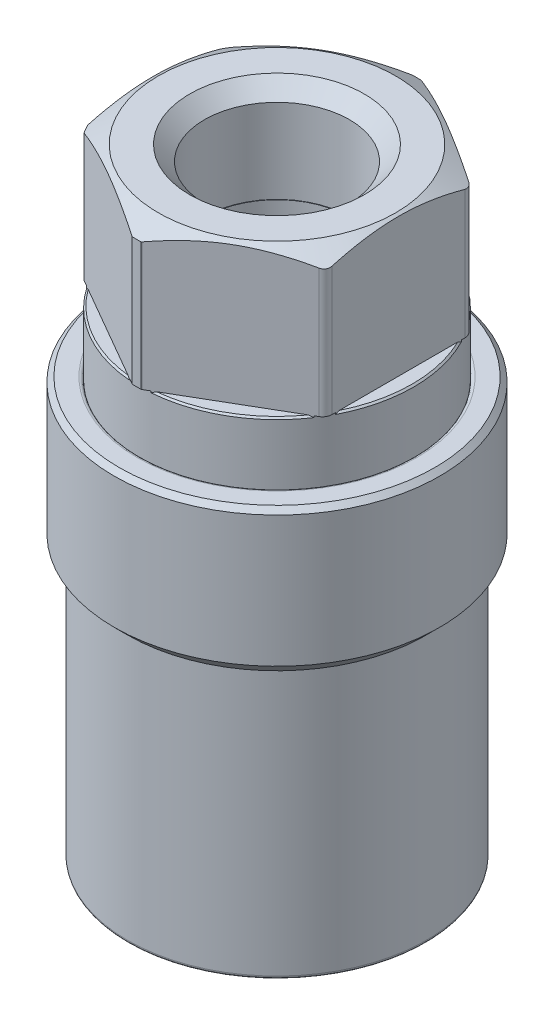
ISO-10303-21;
HEADER;
FILE_DESCRIPTION(('STEP AP214'),'2;1');
FILE_NAME('part.step','',(''),(''),'','','');
FILE_SCHEMA(('AUTOMOTIVE_DESIGN { 1 0 10303 214 1 1 1 1 }'));
ENDSEC;
DATA;
#1=APPLICATION_CONTEXT('core data for automotive mechanical design processes');
#2=APPLICATION_PROTOCOL_DEFINITION('international standard','automotive_design',2000,#1);
#3=PRODUCT_CONTEXT('',#1,'mechanical');
#4=PRODUCT('Part','Part','',(#3));
#5=PRODUCT_RELATED_PRODUCT_CATEGORY('part','',(#4));
#6=PRODUCT_DEFINITION_FORMATION('','',#4);
#7=PRODUCT_DEFINITION_CONTEXT('part definition',#1,'design');
#8=PRODUCT_DEFINITION('design','',#6,#7);
#9=PRODUCT_DEFINITION_SHAPE('','',#8);
#10=(LENGTH_UNIT() NAMED_UNIT(*) SI_UNIT(.MILLI.,.METRE.));
#11=(NAMED_UNIT(*) PLANE_ANGLE_UNIT() SI_UNIT($,.RADIAN.));
#12=(NAMED_UNIT(*) SI_UNIT($,.STERADIAN.) SOLID_ANGLE_UNIT());
#13=UNCERTAINTY_MEASURE_WITH_UNIT(LENGTH_MEASURE(1.E-05),#10,'distance_accuracy_value','');
#14=(GEOMETRIC_REPRESENTATION_CONTEXT(3) GLOBAL_UNCERTAINTY_ASSIGNED_CONTEXT((#13)) GLOBAL_UNIT_ASSIGNED_CONTEXT((#10,
#11,#12)) REPRESENTATION_CONTEXT('',''));
#15=CARTESIAN_POINT('',(0.,0.,0.));
#16=DIRECTION('',(0.,0.,1.));
#17=DIRECTION('',(1.,0.,0.));
#18=AXIS2_PLACEMENT_3D('',#15,#16,#17);
#19=CARTESIAN_POINT('',(0.,31.9405,0.));
#20=DIRECTION('',(0.,-1.,0.));
#21=DIRECTION('',(0.,0.,-1.));
#22=AXIS2_PLACEMENT_3D('',#19,#20,#21);
#23=CONICAL_SURFACE('',#22,12.3494480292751,0.785398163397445);
#24=CARTESIAN_POINT('',(0.,32.131,0.));
#25=DIRECTION('',(0.,-1.,0.));
#26=DIRECTION('',(0.,0.,-1.));
#27=AXIS2_PLACEMENT_3D('',#24,#25,#26);
#28=CIRCLE('',#27,12.1589480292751);
#29=CARTESIAN_POINT('',(0.,32.131,12.1589480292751));
#30=VERTEX_POINT('',#29);
#31=EDGE_CURVE('P0_E11',#30,#30,#28,.T.);
#32=ORIENTED_EDGE('',*,*,#31,.T.);
#33=DIRECTION('',(0.,-0.70710678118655,0.707106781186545));
#34=VECTOR('',#33,1.);
#35=CARTESIAN_POINT('',(0.,31.9405,12.3494480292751));
#36=LINE('',#35,#34);
#37=CARTESIAN_POINT('',(0.,31.75,12.5399480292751));
#38=VERTEX_POINT('',#37);
#39=EDGE_CURVE('P0_E27',#30,#38,#36,.T.);
#40=ORIENTED_EDGE('',*,*,#39,.T.);
#41=CARTESIAN_POINT('',(0.,31.75,0.));
#42=DIRECTION('',(0.,1.,0.));
#43=DIRECTION('',(0.,0.,-1.));
#44=AXIS2_PLACEMENT_3D('',#41,#42,#43);
#45=CIRCLE('',#44,12.5399480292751);
#46=CARTESIAN_POINT('',(0.,31.75,-12.5399480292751));
#47=VERTEX_POINT('',#46);
#48=EDGE_CURVE('P0_E200',#38,#47,#45,.T.);
#49=ORIENTED_EDGE('',*,*,#48,.T.);
#50=CARTESIAN_POINT('',(0.,31.75,0.));
#51=DIRECTION('',(0.,1.,0.));
#52=DIRECTION('',(0.,0.,-1.));
#53=AXIS2_PLACEMENT_3D('',#50,#51,#52);
#54=CIRCLE('',#53,12.5399480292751);
#55=EDGE_CURVE('P0_E203',#47,#38,#54,.T.);
#56=ORIENTED_EDGE('',*,*,#55,.T.);
#57=ORIENTED_EDGE('',*,*,#39,.F.);
#58=EDGE_LOOP('',(#32,#40,#49,#56,#57));
#59=FACE_BOUND('',#58,.T.);
#60=ADVANCED_FACE('P0_F16',(#59),#23,.T.);
#61=CARTESIAN_POINT('',(0.,32.131,10.541));
#62=DIRECTION('',(0.,1.,0.));
#63=DIRECTION('',(1.,0.,0.));
#64=AXIS2_PLACEMENT_3D('',#61,#62,#63);
#65=PLANE('',#64);
#66=ORIENTED_EDGE('',*,*,#31,.F.);
#67=EDGE_LOOP('',(#66));
#68=FACE_BOUND('',#67,.T.);
#69=CARTESIAN_POINT('',(0.,32.131,0.));
#70=DIRECTION('',(0.,1.,0.));
#71=DIRECTION('',(0.,0.,-1.));
#72=AXIS2_PLACEMENT_3D('',#69,#70,#71);
#73=CIRCLE('',#72,10.795);
#74=CARTESIAN_POINT('',(0.,32.131,10.795));
#75=VERTEX_POINT('',#74);
#76=CARTESIAN_POINT('',(0.,32.131,-10.795));
#77=VERTEX_POINT('',#76);
#78=EDGE_CURVE('P0_E276',#75,#77,#73,.T.);
#79=ORIENTED_EDGE('',*,*,#78,.F.);
#80=CARTESIAN_POINT('',(0.,32.131,0.));
#81=DIRECTION('',(0.,1.,0.));
#82=DIRECTION('',(0.,0.,-1.));
#83=AXIS2_PLACEMENT_3D('',#80,#81,#82);
#84=CIRCLE('',#83,10.795);
#85=EDGE_CURVE('P0_E271',#77,#75,#84,.T.);
#86=ORIENTED_EDGE('',*,*,#85,.F.);
#87=EDGE_LOOP('',(#79,#86));
#88=FACE_BOUND('',#87,.T.);
#89=ADVANCED_FACE('P0_F432',(#68,#88),#65,.T.);
#90=CARTESIAN_POINT('',(0.,26.8947740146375,0.));
#91=DIRECTION('',(0.,1.,0.));
#92=DIRECTION('',(0.,0.,1.));
#93=AXIS2_PLACEMENT_3D('',#90,#91,#92);
#94=CYLINDRICAL_SURFACE('',#93,12.5399480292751);
#95=ORIENTED_EDGE('',*,*,#48,.F.);
#96=ORIENTED_EDGE('',*,*,#55,.F.);
#97=DIRECTION('',(0.,-1.,0.));
#98=VECTOR('',#97,1.);
#99=CARTESIAN_POINT('',(0.,26.8947740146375,-12.5399480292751));
#100=LINE('',#99,#98);
#101=CARTESIAN_POINT('',(0.,21.6585480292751,-12.5399480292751));
#102=VERTEX_POINT('',#101);
#103=EDGE_CURVE('P0_E253',#47,#102,#100,.T.);
#104=ORIENTED_EDGE('',*,*,#103,.T.);
#105=CARTESIAN_POINT('',(0.,21.6585480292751,0.));
#106=DIRECTION('',(0.,1.,0.));
#107=DIRECTION('',(1.,0.,0.));
#108=AXIS2_PLACEMENT_3D('',#105,#106,#107);
#109=CIRCLE('',#108,12.5399480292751);
#110=CARTESIAN_POINT('',(0.,21.6585480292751,12.5399480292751));
#111=VERTEX_POINT('',#110);
#112=EDGE_CURVE('P0_E257',#102,#111,#109,.T.);
#113=ORIENTED_EDGE('',*,*,#112,.T.);
#114=CARTESIAN_POINT('',(0.,21.6585480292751,0.));
#115=DIRECTION('',(0.,1.,0.));
#116=DIRECTION('',(1.,0.,0.));
#117=AXIS2_PLACEMENT_3D('',#114,#115,#116);
#118=CIRCLE('',#117,12.5399480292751);
#119=EDGE_CURVE('P0_E206',#111,#102,#118,.T.);
#120=ORIENTED_EDGE('',*,*,#119,.T.);
#121=ORIENTED_EDGE('',*,*,#103,.F.);
#122=EDGE_LOOP('',(#95,#96,#104,#113,#120,#121));
#123=FACE_BOUND('',#122,.T.);
#124=ADVANCED_FACE('P0_F294',(#123),#94,.T.);
#125=CARTESIAN_POINT('',(0.,0.254,0.));
#126=DIRECTION('',(0.,1.,0.));
#127=DIRECTION('',(0.,0.,1.));
#128=AXIS2_PLACEMENT_3D('',#125,#126,#127);
#129=TOROIDAL_SURFACE('',#128,11.2522,0.254);
#130=CARTESIAN_POINT('',(0.,0.254,0.));
#131=DIRECTION('',(0.,-1.,0.));
#132=DIRECTION('',(0.,0.,-1.));
#133=AXIS2_PLACEMENT_3D('',#130,#131,#132);
#134=CIRCLE('',#133,11.5062);
#135=CARTESIAN_POINT('',(0.,0.254,11.5062));
#136=VERTEX_POINT('',#135);
#137=CARTESIAN_POINT('',(0.,0.254,-11.5062));
#138=VERTEX_POINT('',#137);
#139=EDGE_CURVE('P0_E110',#136,#138,#134,.T.);
#140=ORIENTED_EDGE('',*,*,#139,.T.);
#141=CARTESIAN_POINT('',(0.,0.254,-11.2522));
#142=DIRECTION('',(-1.,0.,0.));
#143=DIRECTION('',(0.,0.,-1.));
#144=AXIS2_PLACEMENT_3D('',#141,#142,#143);
#145=CIRCLE('',#144,0.254);
#146=CARTESIAN_POINT('',(0.,0.,-11.2522));
#147=VERTEX_POINT('',#146);
#148=EDGE_CURVE('P0_E207',#138,#147,#145,.T.);
#149=ORIENTED_EDGE('',*,*,#148,.T.);
#150=CARTESIAN_POINT('',(0.,0.,0.));
#151=DIRECTION('',(0.,1.,0.));
#152=DIRECTION('',(0.,0.,-1.));
#153=AXIS2_PLACEMENT_3D('',#150,#151,#152);
#154=CIRCLE('',#153,11.2522);
#155=CARTESIAN_POINT('',(0.,0.,11.2522));
#156=VERTEX_POINT('',#155);
#157=EDGE_CURVE('P0_E98',#147,#156,#154,.T.);
#158=ORIENTED_EDGE('',*,*,#157,.T.);
#159=CARTESIAN_POINT('',(0.,0.,0.));
#160=DIRECTION('',(0.,1.,0.));
#161=DIRECTION('',(0.,0.,-1.));
#162=AXIS2_PLACEMENT_3D('',#159,#160,#161);
#163=CIRCLE('',#162,11.2522);
#164=EDGE_CURVE('P0_E233',#156,#147,#163,.T.);
#165=ORIENTED_EDGE('',*,*,#164,.T.);
#166=ORIENTED_EDGE('',*,*,#148,.F.);
#167=CARTESIAN_POINT('',(0.,0.254,0.));
#168=DIRECTION('',(0.,-1.,0.));
#169=DIRECTION('',(0.,0.,-1.));
#170=AXIS2_PLACEMENT_3D('',#167,#168,#169);
#171=CIRCLE('',#170,11.5062);
#172=EDGE_CURVE('P0_E230',#138,#136,#171,.T.);
#173=ORIENTED_EDGE('',*,*,#172,.T.);
#174=EDGE_LOOP('',(#140,#149,#158,#165,#166,#173));
#175=FACE_BOUND('',#174,.T.);
#176=ADVANCED_FACE('P0_F419',(#175),#129,.T.);
#177=CARTESIAN_POINT('',(0.,0.,11.5062));
#178=DIRECTION('',(0.,-1.,0.));
#179=DIRECTION('',(0.,0.,-1.));
#180=AXIS2_PLACEMENT_3D('',#177,#178,#179);
#181=PLANE('',#180);
#182=ORIENTED_EDGE('',*,*,#164,.F.);
#183=ORIENTED_EDGE('',*,*,#157,.F.);
#184=EDGE_LOOP('',(#182,#183));
#185=FACE_BOUND('',#184,.T.);
#186=CARTESIAN_POINT('',(0.,0.,0.));
#187=DIRECTION('',(0.,-1.,0.));
#188=DIRECTION('',(0.,0.,-1.));
#189=AXIS2_PLACEMENT_3D('',#186,#187,#188);
#190=CIRCLE('',#189,10.3124003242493);
#191=CARTESIAN_POINT('',(0.,0.,10.3124003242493));
#192=VERTEX_POINT('',#191);
#193=CARTESIAN_POINT('',(0.,0.,-10.3124003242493));
#194=VERTEX_POINT('',#193);
#195=EDGE_CURVE('P0_E252',#192,#194,#190,.T.);
#196=ORIENTED_EDGE('',*,*,#195,.F.);
#197=CARTESIAN_POINT('',(0.,0.,0.));
#198=DIRECTION('',(0.,-1.,0.));
#199=DIRECTION('',(0.,0.,-1.));
#200=AXIS2_PLACEMENT_3D('',#197,#198,#199);
#201=CIRCLE('',#200,10.3124003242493);
#202=EDGE_CURVE('P0_E176',#194,#192,#201,.T.);
#203=ORIENTED_EDGE('',*,*,#202,.F.);
#204=EDGE_LOOP('',(#196,#203));
#205=FACE_BOUND('',#204,.T.);
#206=ADVANCED_FACE('P0_F378',(#185,#205),#181,.T.);
#207=CARTESIAN_POINT('',(0.,10.3124,0.));
#208=DIRECTION('',(0.,1.,0.));
#209=DIRECTION('',(0.,0.,1.));
#210=AXIS2_PLACEMENT_3D('',#207,#208,#209);
#211=CYLINDRICAL_SURFACE('',#210,11.5062);
#212=CARTESIAN_POINT('',(0.,20.6248,0.));
#213=DIRECTION('',(0.,1.,0.));
#214=DIRECTION('',(1.,0.,0.));
#215=AXIS2_PLACEMENT_3D('',#212,#213,#214);
#216=CIRCLE('',#215,11.5062);
#217=CARTESIAN_POINT('',(0.,20.6248,11.5062));
#218=VERTEX_POINT('',#217);
#219=CARTESIAN_POINT('',(0.,20.6248,-11.5062));
#220=VERTEX_POINT('',#219);
#221=EDGE_CURVE('P0_E243',#218,#220,#216,.T.);
#222=ORIENTED_EDGE('',*,*,#221,.F.);
#223=CARTESIAN_POINT('',(0.,20.6248,0.));
#224=DIRECTION('',(0.,1.,0.));
#225=DIRECTION('',(1.,0.,0.));
#226=AXIS2_PLACEMENT_3D('',#223,#224,#225);
#227=CIRCLE('',#226,11.5062);
#228=EDGE_CURVE('P0_E246',#220,#218,#227,.T.);
#229=ORIENTED_EDGE('',*,*,#228,.F.);
#230=DIRECTION('',(0.,-1.,0.));
#231=VECTOR('',#230,1.);
#232=CARTESIAN_POINT('',(0.,10.3124,-11.5062));
#233=LINE('',#232,#231);
#234=EDGE_CURVE('P0_E234',#220,#138,#233,.T.);
#235=ORIENTED_EDGE('',*,*,#234,.T.);
#236=ORIENTED_EDGE('',*,*,#139,.F.);
#237=ORIENTED_EDGE('',*,*,#172,.F.);
#238=ORIENTED_EDGE('',*,*,#234,.F.);
#239=EDGE_LOOP('',(#222,#229,#235,#236,#237,#238));
#240=FACE_BOUND('',#239,.T.);
#241=ADVANCED_FACE('P0_F417',(#240),#211,.T.);
#242=CARTESIAN_POINT('',(0.,31.877,0.));
#243=DIRECTION('',(0.,1.,0.));
#244=DIRECTION('',(0.,0.,1.));
#245=AXIS2_PLACEMENT_3D('',#242,#243,#244);
#246=TOROIDAL_SURFACE('',#245,10.795,0.254);
#247=CARTESIAN_POINT('',(0.,31.877,0.));
#248=DIRECTION('',(0.,-1.,0.));
#249=DIRECTION('',(0.,0.,-1.));
#250=AXIS2_PLACEMENT_3D('',#247,#248,#249);
#251=CIRCLE('',#250,10.541);
#252=CARTESIAN_POINT('',(0.,31.877,10.541));
#253=VERTEX_POINT('',#252);
#254=CARTESIAN_POINT('',(0.,31.877,-10.541));
#255=VERTEX_POINT('',#254);
#256=EDGE_CURVE('P0_E342',#253,#255,#251,.T.);
#257=ORIENTED_EDGE('',*,*,#256,.T.);
#258=CARTESIAN_POINT('',(0.,31.877,-10.795));
#259=DIRECTION('',(-1.,0.,0.));
#260=DIRECTION('',(0.,0.,-1.));
#261=AXIS2_PLACEMENT_3D('',#258,#259,#260);
#262=CIRCLE('',#261,0.254);
#263=EDGE_CURVE('P0_E275',#255,#77,#262,.T.);
#264=ORIENTED_EDGE('',*,*,#263,.T.);
#265=ORIENTED_EDGE('',*,*,#85,.T.);
#266=ORIENTED_EDGE('',*,*,#78,.T.);
#267=ORIENTED_EDGE('',*,*,#263,.F.);
#268=CARTESIAN_POINT('',(0.,31.877,0.));
#269=DIRECTION('',(0.,-1.,0.));
#270=DIRECTION('',(0.,0.,-1.));
#271=AXIS2_PLACEMENT_3D('',#268,#269,#270);
#272=CIRCLE('',#271,10.541);
#273=EDGE_CURVE('P0_E216',#255,#253,#272,.T.);
#274=ORIENTED_EDGE('',*,*,#273,.T.);
#275=EDGE_LOOP('',(#257,#264,#265,#266,#267,#274));
#276=FACE_BOUND('',#275,.T.);
#277=ADVANCED_FACE('P0_F387',(#276),#246,.T.);
#278=CARTESIAN_POINT('',(0.,19.3675,0.));
#279=DIRECTION('',(0.,1.,0.));
#280=DIRECTION('',(0.,0.,1.));
#281=AXIS2_PLACEMENT_3D('',#278,#279,#280);
#282=CYLINDRICAL_SURFACE('',#281,10.541);
#283=ORIENTED_EDGE('',*,*,#256,.F.);
#284=ORIENTED_EDGE('',*,*,#273,.F.);
#285=DIRECTION('',(0.,-1.,0.));
#286=VECTOR('',#285,1.);
#287=CARTESIAN_POINT('',(0.,19.3675,-10.541));
#288=LINE('',#287,#286);
#289=CARTESIAN_POINT('',(0.,7.366,-10.541));
#290=VERTEX_POINT('',#289);
#291=EDGE_CURVE('P0_E212',#255,#290,#288,.T.);
#292=ORIENTED_EDGE('',*,*,#291,.T.);
#293=CARTESIAN_POINT('',(0.,7.366,0.));
#294=DIRECTION('',(0.,1.,0.));
#295=DIRECTION('',(0.,0.,-1.));
#296=AXIS2_PLACEMENT_3D('',#293,#294,#295);
#297=CIRCLE('',#296,10.541);
#298=CARTESIAN_POINT('',(0.,7.366,10.541));
#299=VERTEX_POINT('',#298);
#300=EDGE_CURVE('P0_E217',#299,#290,#297,.T.);
#301=ORIENTED_EDGE('',*,*,#300,.F.);
#302=CARTESIAN_POINT('',(0.,7.366,0.));
#303=DIRECTION('',(0.,1.,0.));
#304=DIRECTION('',(0.,0.,-1.));
#305=AXIS2_PLACEMENT_3D('',#302,#303,#304);
#306=CIRCLE('',#305,10.541);
#307=EDGE_CURVE('P0_E218',#290,#299,#306,.T.);
#308=ORIENTED_EDGE('',*,*,#307,.F.);
#309=ORIENTED_EDGE('',*,*,#291,.F.);
#310=EDGE_LOOP('',(#283,#284,#292,#301,#308,#309));
#311=FACE_BOUND('',#310,.T.);
#312=ADVANCED_FACE('P0_F438',(#311),#282,.F.);
#313=CARTESIAN_POINT('',(0.,7.366,0.));
#314=DIRECTION('',(0.,1.,0.));
#315=DIRECTION('',(0.,0.,1.));
#316=AXIS2_PLACEMENT_3D('',#313,#314,#315);
#317=TOROIDAL_SURFACE('',#316,9.779,0.762);
#318=ORIENTED_EDGE('',*,*,#300,.T.);
#319=CARTESIAN_POINT('',(0.,7.366,-9.779));
#320=DIRECTION('',(-1.,0.,0.));
#321=DIRECTION('',(0.,0.,-1.));
#322=AXIS2_PLACEMENT_3D('',#319,#320,#321);
#323=CIRCLE('',#322,0.762);
#324=CARTESIAN_POINT('',(0.,6.604,-9.779));
#325=VERTEX_POINT('',#324);
#326=EDGE_CURVE('P0_E20',#290,#325,#323,.T.);
#327=ORIENTED_EDGE('',*,*,#326,.T.);
#328=CARTESIAN_POINT('',(0.,6.604,0.));
#329=DIRECTION('',(0.,-1.,0.));
#330=DIRECTION('',(0.,0.,-1.));
#331=AXIS2_PLACEMENT_3D('',#328,#329,#330);
#332=CIRCLE('',#331,9.779);
#333=CARTESIAN_POINT('',(0.,6.604,9.779));
#334=VERTEX_POINT('',#333);
#335=EDGE_CURVE('P0_E263',#325,#334,#332,.T.);
#336=ORIENTED_EDGE('',*,*,#335,.T.);
#337=CARTESIAN_POINT('',(0.,6.604,0.));
#338=DIRECTION('',(0.,-1.,0.));
#339=DIRECTION('',(0.,0.,-1.));
#340=AXIS2_PLACEMENT_3D('',#337,#338,#339);
#341=CIRCLE('',#340,9.779);
#342=EDGE_CURVE('P0_E222',#334,#325,#341,.T.);
#343=ORIENTED_EDGE('',*,*,#342,.T.);
#344=ORIENTED_EDGE('',*,*,#326,.F.);
#345=ORIENTED_EDGE('',*,*,#307,.T.);
#346=EDGE_LOOP('',(#318,#327,#336,#343,#344,#345));
#347=FACE_BOUND('',#346,.T.);
#348=ADVANCED_FACE('P0_F440',(#347),#317,.F.);
#349=CARTESIAN_POINT('',(0.,6.604,9.017));
#350=DIRECTION('',(0.,1.,0.));
#351=DIRECTION('',(1.,0.,0.));
#352=AXIS2_PLACEMENT_3D('',#349,#350,#351);
#353=PLANE('',#352);
#354=ORIENTED_EDGE('',*,*,#342,.F.);
#355=ORIENTED_EDGE('',*,*,#335,.F.);
#356=EDGE_LOOP('',(#354,#355));
#357=FACE_BOUND('',#356,.T.);
#358=CARTESIAN_POINT('',(0.,6.604,0.));
#359=DIRECTION('',(0.,1.,0.));
#360=DIRECTION('',(0.,0.,-1.));
#361=AXIS2_PLACEMENT_3D('',#358,#359,#360);
#362=CIRCLE('',#361,9.398);
#363=CARTESIAN_POINT('',(0.,6.604,9.398));
#364=VERTEX_POINT('',#363);
#365=CARTESIAN_POINT('',(0.,6.604,-9.398));
#366=VERTEX_POINT('',#365);
#367=EDGE_CURVE('P0_E168',#364,#366,#362,.T.);
#368=ORIENTED_EDGE('',*,*,#367,.F.);
#369=CARTESIAN_POINT('',(0.,6.604,0.));
#370=DIRECTION('',(0.,1.,0.));
#371=DIRECTION('',(0.,0.,-1.));
#372=AXIS2_PLACEMENT_3D('',#369,#370,#371);
#373=CIRCLE('',#372,9.398);
#374=EDGE_CURVE('P0_E189',#366,#364,#373,.T.);
#375=ORIENTED_EDGE('',*,*,#374,.F.);
#376=EDGE_LOOP('',(#368,#375));
#377=FACE_BOUND('',#376,.T.);
#378=ADVANCED_FACE('P0_F445',(#357,#377),#353,.T.);
#379=CARTESIAN_POINT('',(0.,2.61800544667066,0.));
#380=DIRECTION('',(0.,1.,0.));
#381=DIRECTION('',(0.,0.,1.));
#382=AXIS2_PLACEMENT_3D('',#379,#380,#381);
#383=TOROIDAL_SURFACE('',#382,9.144,0.127);
#384=CARTESIAN_POINT('',(0.,2.52820288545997,0.));
#385=DIRECTION('',(0.,-1.,0.));
#386=DIRECTION('',(0.,0.,-1.));
#387=AXIS2_PLACEMENT_3D('',#384,#385,#386);
#388=CIRCLE('',#387,9.0541974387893);
#389=CARTESIAN_POINT('',(0.,2.52820288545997,9.0541974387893));
#390=VERTEX_POINT('',#389);
#391=CARTESIAN_POINT('',(0.,2.52820288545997,-9.0541974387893));
#392=VERTEX_POINT('',#391);
#393=EDGE_CURVE('P0_E223',#390,#392,#388,.T.);
#394=ORIENTED_EDGE('',*,*,#393,.T.);
#395=CARTESIAN_POINT('',(0.,2.61800544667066,-9.144));
#396=DIRECTION('',(-1.,0.,0.));
#397=DIRECTION('',(0.,0.,-1.));
#398=AXIS2_PLACEMENT_3D('',#395,#396,#397);
#399=CIRCLE('',#398,0.127);
#400=CARTESIAN_POINT('',(0.,2.61800544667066,-9.017));
#401=VERTEX_POINT('',#400);
#402=EDGE_CURVE('P0_E198',#392,#401,#399,.T.);
#403=ORIENTED_EDGE('',*,*,#402,.T.);
#404=CARTESIAN_POINT('',(0.,2.61800544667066,0.));
#405=DIRECTION('',(0.,1.,0.));
#406=DIRECTION('',(0.,0.,-1.));
#407=AXIS2_PLACEMENT_3D('',#404,#405,#406);
#408=CIRCLE('',#407,9.017);
#409=CARTESIAN_POINT('',(0.,2.61800544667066,9.017));
#410=VERTEX_POINT('',#409);
#411=EDGE_CURVE('P0_E180',#401,#410,#408,.T.);
#412=ORIENTED_EDGE('',*,*,#411,.T.);
#413=CARTESIAN_POINT('',(0.,2.61800544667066,0.));
#414=DIRECTION('',(0.,1.,0.));
#415=DIRECTION('',(0.,0.,-1.));
#416=AXIS2_PLACEMENT_3D('',#413,#414,#415);
#417=CIRCLE('',#416,9.017);
#418=EDGE_CURVE('P0_E267',#410,#401,#417,.T.);
#419=ORIENTED_EDGE('',*,*,#418,.T.);
#420=ORIENTED_EDGE('',*,*,#402,.F.);
#421=CARTESIAN_POINT('',(0.,2.52820288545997,0.));
#422=DIRECTION('',(0.,-1.,0.));
#423=DIRECTION('',(0.,0.,-1.));
#424=AXIS2_PLACEMENT_3D('',#421,#422,#423);
#425=CIRCLE('',#424,9.0541974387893);
#426=EDGE_CURVE('P0_E229',#392,#390,#425,.T.);
#427=ORIENTED_EDGE('',*,*,#426,.T.);
#428=EDGE_LOOP('',(#394,#403,#412,#419,#420,#427));
#429=FACE_BOUND('',#428,.T.);
#430=ADVANCED_FACE('P0_F451',(#429),#383,.T.);
#431=CARTESIAN_POINT('',(0.,1.99390016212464,0.));
#432=DIRECTION('',(0.,-1.,0.));
#433=DIRECTION('',(0.,0.,1.));
#434=AXIS2_PLACEMENT_3D('',#431,#432,#433);
#435=CONICAL_SURFACE('',#434,9.58850016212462,0.785398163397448);
#436=ORIENTED_EDGE('',*,*,#393,.F.);
#437=ORIENTED_EDGE('',*,*,#426,.F.);
#438=DIRECTION('',(0.,-0.707106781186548,-0.707106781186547));
#439=VECTOR('',#438,1.);
#440=CARTESIAN_POINT('',(0.,1.99390016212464,-9.58850016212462));
#441=LINE('',#440,#439);
#442=CARTESIAN_POINT('',(0.,1.64558463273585,-9.93681569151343));
#443=VERTEX_POINT('',#442);
#444=EDGE_CURVE('P0_E183',#392,#443,#441,.T.);
#445=ORIENTED_EDGE('',*,*,#444,.T.);
#446=CARTESIAN_POINT('',(0.,1.64558463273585,0.));
#447=DIRECTION('',(0.,1.,0.));
#448=DIRECTION('',(0.,0.,-1.));
#449=AXIS2_PLACEMENT_3D('',#446,#447,#448);
#450=CIRCLE('',#449,9.93681569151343);
#451=CARTESIAN_POINT('',(0.,1.64558463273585,9.93681569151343));
#452=VERTEX_POINT('',#451);
#453=EDGE_CURVE('P0_E184',#452,#443,#450,.T.);
#454=ORIENTED_EDGE('',*,*,#453,.F.);
#455=CARTESIAN_POINT('',(0.,1.64558463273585,0.));
#456=DIRECTION('',(0.,1.,0.));
#457=DIRECTION('',(0.,0.,-1.));
#458=AXIS2_PLACEMENT_3D('',#455,#456,#457);
#459=CIRCLE('',#458,9.93681569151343);
#460=EDGE_CURVE('P0_E251',#443,#452,#459,.T.);
#461=ORIENTED_EDGE('',*,*,#460,.F.);
#462=ORIENTED_EDGE('',*,*,#444,.F.);
#463=EDGE_LOOP('',(#436,#437,#445,#454,#461,#462));
#464=FACE_BOUND('',#463,.T.);
#465=ADVANCED_FACE('P0_F366',(#464),#435,.F.);
#466=CARTESIAN_POINT('',(0.,4.58470016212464,0.));
#467=DIRECTION('',(0.,1.,0.));
#468=DIRECTION('',(0.,0.,1.));
#469=AXIS2_PLACEMENT_3D('',#466,#467,#468);
#470=CYLINDRICAL_SURFACE('',#469,9.017);
#471=CARTESIAN_POINT('',(0.,6.223,0.));
#472=DIRECTION('',(0.,-1.,0.));
#473=DIRECTION('',(0.,0.,-1.));
#474=AXIS2_PLACEMENT_3D('',#471,#472,#473);
#475=CIRCLE('',#474,9.017);
#476=CARTESIAN_POINT('',(0.,6.223,9.017));
#477=VERTEX_POINT('',#476);
#478=CARTESIAN_POINT('',(0.,6.223,-9.017));
#479=VERTEX_POINT('',#478);
#480=EDGE_CURVE('P0_E164',#477,#479,#475,.T.);
#481=ORIENTED_EDGE('',*,*,#480,.F.);
#482=CARTESIAN_POINT('',(0.,6.223,0.));
#483=DIRECTION('',(0.,-1.,0.));
#484=DIRECTION('',(0.,0.,-1.));
#485=AXIS2_PLACEMENT_3D('',#482,#483,#484);
#486=CIRCLE('',#485,9.017);
#487=EDGE_CURVE('P0_E158',#479,#477,#486,.T.);
#488=ORIENTED_EDGE('',*,*,#487,.F.);
#489=DIRECTION('',(0.,-1.,0.));
#490=VECTOR('',#489,1.);
#491=CARTESIAN_POINT('',(0.,4.58470016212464,-9.017));
#492=LINE('',#491,#490);
#493=EDGE_CURVE('P0_E163',#479,#401,#492,.T.);
#494=ORIENTED_EDGE('',*,*,#493,.T.);
#495=ORIENTED_EDGE('',*,*,#418,.F.);
#496=ORIENTED_EDGE('',*,*,#411,.F.);
#497=ORIENTED_EDGE('',*,*,#493,.F.);
#498=EDGE_LOOP('',(#481,#488,#494,#495,#496,#497));
#499=FACE_BOUND('',#498,.T.);
#500=ADVANCED_FACE('P0_F160',(#499),#470,.F.);
#501=CARTESIAN_POINT('',(0.,1.1067692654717,0.));
#502=DIRECTION('',(0.,1.,0.));
#503=DIRECTION('',(0.,0.,1.));
#504=AXIS2_PLACEMENT_3D('',#501,#502,#503);
#505=TOROIDAL_SURFACE('',#504,9.39800032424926,0.762);
#506=ORIENTED_EDGE('',*,*,#453,.T.);
#507=CARTESIAN_POINT('',(0.,1.1067692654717,-9.39800032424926));
#508=DIRECTION('',(-1.,0.,0.));
#509=DIRECTION('',(0.,0.,-1.));
#510=AXIS2_PLACEMENT_3D('',#507,#508,#509);
#511=CIRCLE('',#510,0.762);
#512=CARTESIAN_POINT('',(0.,1.1067692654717,-10.1600003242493));
#513=VERTEX_POINT('',#512);
#514=EDGE_CURVE('P0_E235',#443,#513,#511,.T.);
#515=ORIENTED_EDGE('',*,*,#514,.T.);
#516=CARTESIAN_POINT('',(0.,1.1067692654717,0.));
#517=DIRECTION('',(0.,-1.,0.));
#518=DIRECTION('',(0.,0.,-1.));
#519=AXIS2_PLACEMENT_3D('',#516,#517,#518);
#520=CIRCLE('',#519,10.1600003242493);
#521=CARTESIAN_POINT('',(0.,1.1067692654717,10.1600003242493));
#522=VERTEX_POINT('',#521);
#523=EDGE_CURVE('P0_E239',#513,#522,#520,.T.);
#524=ORIENTED_EDGE('',*,*,#523,.T.);
#525=CARTESIAN_POINT('',(0.,1.1067692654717,0.));
#526=DIRECTION('',(0.,-1.,0.));
#527=DIRECTION('',(0.,0.,-1.));
#528=AXIS2_PLACEMENT_3D('',#525,#526,#527);
#529=CIRCLE('',#528,10.1600003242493);
#530=EDGE_CURVE('P0_E270',#522,#513,#529,.T.);
#531=ORIENTED_EDGE('',*,*,#530,.T.);
#532=ORIENTED_EDGE('',*,*,#514,.F.);
#533=ORIENTED_EDGE('',*,*,#460,.T.);
#534=EDGE_LOOP('',(#506,#515,#524,#531,#532,#533));
#535=FACE_BOUND('',#534,.T.);
#536=ADVANCED_FACE('P0_F18',(#535),#505,.F.);
#537=CARTESIAN_POINT('',(0.,0.7112,0.));
#538=DIRECTION('',(0.,1.,0.));
#539=DIRECTION('',(0.,0.,1.));
#540=AXIS2_PLACEMENT_3D('',#537,#538,#539);
#541=CYLINDRICAL_SURFACE('',#540,10.1600003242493);
#542=ORIENTED_EDGE('',*,*,#530,.F.);
#543=ORIENTED_EDGE('',*,*,#523,.F.);
#544=DIRECTION('',(0.,-1.,0.));
#545=VECTOR('',#544,1.);
#546=CARTESIAN_POINT('',(0.,0.7112,-10.1600003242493));
#547=LINE('',#546,#545);
#548=CARTESIAN_POINT('',(0.,0.1524,-10.1600003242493));
#549=VERTEX_POINT('',#548);
#550=EDGE_CURVE('P0_E247',#513,#549,#547,.T.);
#551=ORIENTED_EDGE('',*,*,#550,.T.);
#552=CARTESIAN_POINT('',(0.,0.1524,0.));
#553=DIRECTION('',(0.,1.,0.));
#554=DIRECTION('',(0.,0.,-1.));
#555=AXIS2_PLACEMENT_3D('',#552,#553,#554);
#556=CIRCLE('',#555,10.1600003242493);
#557=CARTESIAN_POINT('',(0.,0.1524,10.1600003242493));
#558=VERTEX_POINT('',#557);
#559=EDGE_CURVE('P0_E211',#558,#549,#556,.T.);
#560=ORIENTED_EDGE('',*,*,#559,.F.);
#561=CARTESIAN_POINT('',(0.,0.1524,0.));
#562=DIRECTION('',(0.,1.,0.));
#563=DIRECTION('',(0.,0.,-1.));
#564=AXIS2_PLACEMENT_3D('',#561,#562,#563);
#565=CIRCLE('',#564,10.1600003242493);
#566=EDGE_CURVE('P0_E242',#549,#558,#565,.T.);
#567=ORIENTED_EDGE('',*,*,#566,.F.);
#568=ORIENTED_EDGE('',*,*,#550,.F.);
#569=EDGE_LOOP('',(#542,#543,#551,#560,#567,#568));
#570=FACE_BOUND('',#569,.T.);
#571=ADVANCED_FACE('P0_F371',(#570),#541,.F.);
#572=CARTESIAN_POINT('',(0.,0.1524,0.));
#573=DIRECTION('',(0.,1.,0.));
#574=DIRECTION('',(0.,0.,1.));
#575=AXIS2_PLACEMENT_3D('',#572,#573,#574);
#576=TOROIDAL_SURFACE('',#575,10.3124003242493,0.1524);
#577=ORIENTED_EDGE('',*,*,#195,.T.);
#578=CARTESIAN_POINT('',(0.,0.1524,-10.3124003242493));
#579=DIRECTION('',(-1.,0.,0.));
#580=DIRECTION('',(0.,0.,-1.));
#581=AXIS2_PLACEMENT_3D('',#578,#579,#580);
#582=CIRCLE('',#581,0.1524);
#583=EDGE_CURVE('P0_E329',#194,#549,#582,.T.);
#584=ORIENTED_EDGE('',*,*,#583,.T.);
#585=ORIENTED_EDGE('',*,*,#566,.T.);
#586=ORIENTED_EDGE('',*,*,#559,.T.);
#587=ORIENTED_EDGE('',*,*,#583,.F.);
#588=ORIENTED_EDGE('',*,*,#202,.T.);
#589=EDGE_LOOP('',(#577,#584,#585,#586,#587,#588));
#590=FACE_BOUND('',#589,.T.);
#591=ADVANCED_FACE('P0_F376',(#590),#576,.T.);
#592=CARTESIAN_POINT('',(0.,6.223,0.));
#593=DIRECTION('',(0.,1.,0.));
#594=DIRECTION('',(0.,0.,1.));
#595=AXIS2_PLACEMENT_3D('',#592,#593,#594);
#596=TOROIDAL_SURFACE('',#595,9.398,0.381);
#597=ORIENTED_EDGE('',*,*,#480,.T.);
#598=CARTESIAN_POINT('',(0.,6.223,-9.398));
#599=DIRECTION('',(-1.,0.,0.));
#600=DIRECTION('',(0.,0.,-1.));
#601=AXIS2_PLACEMENT_3D('',#598,#599,#600);
#602=CIRCLE('',#601,0.381);
#603=EDGE_CURVE('P0_E174',#479,#366,#602,.T.);
#604=ORIENTED_EDGE('',*,*,#603,.T.);
#605=ORIENTED_EDGE('',*,*,#374,.T.);
#606=ORIENTED_EDGE('',*,*,#367,.T.);
#607=ORIENTED_EDGE('',*,*,#603,.F.);
#608=ORIENTED_EDGE('',*,*,#487,.T.);
#609=EDGE_LOOP('',(#597,#604,#605,#606,#607,#608));
#610=FACE_BOUND('',#609,.T.);
#611=ADVANCED_FACE('P0_F172',(#610),#596,.T.);
#612=CARTESIAN_POINT('',(0.,21.1416740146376,0.));
#613=DIRECTION('',(0.,1.,0.));
#614=DIRECTION('',(0.,0.,1.));
#615=AXIS2_PLACEMENT_3D('',#612,#613,#614);
#616=CONICAL_SURFACE('',#615,12.0230740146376,0.785398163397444);
#617=ORIENTED_EDGE('',*,*,#119,.F.);
#618=ORIENTED_EDGE('',*,*,#112,.F.);
#619=DIRECTION('',(0.,-0.707106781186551,0.707106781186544));
#620=VECTOR('',#619,1.);
#621=CARTESIAN_POINT('',(0.,21.1416740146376,-12.0230740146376));
#622=LINE('',#621,#620);
#623=EDGE_CURVE('P0_E169',#102,#220,#622,.T.);
#624=ORIENTED_EDGE('',*,*,#623,.T.);
#625=ORIENTED_EDGE('',*,*,#228,.T.);
#626=ORIENTED_EDGE('',*,*,#221,.T.);
#627=ORIENTED_EDGE('',*,*,#623,.F.);
#628=EDGE_LOOP('',(#617,#618,#624,#625,#626,#627));
#629=FACE_BOUND('',#628,.T.);
#630=ADVANCED_FACE('P0_F414',(#629),#616,.T.);
#631=CLOSED_SHELL('',(#60,#89,#124,#176,#206,#241,#277,#312,#348,#378,#430,#465,#500,#536,#571,
#591,#611,#630));
#632=MANIFOLD_SOLID_BREP('P0_B1',#631);
#633=CARTESIAN_POINT('',(0.,47.0535,0.));
#634=DIRECTION('',(0.,1.,0.));
#635=DIRECTION('',(0.,0.,-1.));
#636=AXIS2_PLACEMENT_3D('',#633,#634,#635);
#637=CONICAL_SURFACE('',#636,6.1595,0.785398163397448);
#638=CARTESIAN_POINT('',(0.,47.625,0.));
#639=DIRECTION('',(0.,1.,0.));
#640=DIRECTION('',(0.,0.,-1.));
#641=AXIS2_PLACEMENT_3D('',#638,#639,#640);
#642=CIRCLE('',#641,6.731);
#643=CARTESIAN_POINT('',(0.,47.625,6.731));
#644=VERTEX_POINT('',#643);
#645=EDGE_CURVE('P1_E11',#644,#644,#642,.T.);
#646=ORIENTED_EDGE('',*,*,#645,.T.);
#647=DIRECTION('',(0.,-0.707106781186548,-0.707106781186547));
#648=VECTOR('',#647,1.);
#649=CARTESIAN_POINT('',(0.,47.0535,6.1595));
#650=LINE('',#649,#648);
#651=CARTESIAN_POINT('',(0.,46.482,5.588));
#652=VERTEX_POINT('',#651);
#653=EDGE_CURVE('P1_E29',#644,#652,#650,.T.);
#654=ORIENTED_EDGE('',*,*,#653,.T.);
#655=CARTESIAN_POINT('',(0.,46.482,0.));
#656=DIRECTION('',(0.,-1.,0.));
#657=DIRECTION('',(0.,0.,-1.));
#658=AXIS2_PLACEMENT_3D('',#655,#656,#657);
#659=CIRCLE('',#658,5.588);
#660=CARTESIAN_POINT('',(0.,46.482,-5.588));
#661=VERTEX_POINT('',#660);
#662=EDGE_CURVE('P1_E657',#652,#661,#659,.T.);
#663=ORIENTED_EDGE('',*,*,#662,.T.);
#664=CARTESIAN_POINT('',(0.,46.482,0.));
#665=DIRECTION('',(0.,-1.,0.));
#666=DIRECTION('',(0.,0.,-1.));
#667=AXIS2_PLACEMENT_3D('',#664,#665,#666);
#668=CIRCLE('',#667,5.588);
#669=EDGE_CURVE('P1_E663',#661,#652,#668,.T.);
#670=ORIENTED_EDGE('',*,*,#669,.T.);
#671=ORIENTED_EDGE('',*,*,#653,.F.);
#672=EDGE_LOOP('',(#646,#654,#663,#670,#671));
#673=FACE_BOUND('',#672,.T.);
#674=ADVANCED_FACE('P1_F16',(#673),#637,.F.);
#675=CARTESIAN_POINT('',(0.,43.815,0.));
#676=DIRECTION('',(0.,-1.,0.));
#677=DIRECTION('',(0.,0.,1.));
#678=AXIS2_PLACEMENT_3D('',#675,#676,#677);
#679=CYLINDRICAL_SURFACE('',#678,5.588);
#680=ORIENTED_EDGE('',*,*,#662,.F.);
#681=ORIENTED_EDGE('',*,*,#669,.F.);
#682=DIRECTION('',(0.,-1.,0.));
#683=VECTOR('',#682,1.);
#684=CARTESIAN_POINT('',(0.,43.815,-5.588));
#685=LINE('',#684,#683);
#686=CARTESIAN_POINT('',(0.,40.005,-5.588));
#687=VERTEX_POINT('',#686);
#688=EDGE_CURVE('P1_E803',#661,#687,#685,.T.);
#689=ORIENTED_EDGE('',*,*,#688,.T.);
#690=CARTESIAN_POINT('',(0.,40.005,0.));
#691=DIRECTION('',(0.,-1.,0.));
#692=DIRECTION('',(0.,0.,1.));
#693=AXIS2_PLACEMENT_3D('',#690,#691,#692);
#694=CIRCLE('',#693,5.588);
#695=CARTESIAN_POINT('',(0.,40.005,5.588));
#696=VERTEX_POINT('',#695);
#697=EDGE_CURVE('P1_E992',#687,#696,#694,.T.);
#698=ORIENTED_EDGE('',*,*,#697,.T.);
#699=CARTESIAN_POINT('',(0.,40.005,0.));
#700=DIRECTION('',(0.,-1.,0.));
#701=DIRECTION('',(0.,0.,1.));
#702=AXIS2_PLACEMENT_3D('',#699,#700,#701);
#703=CIRCLE('',#702,5.588);
#704=EDGE_CURVE('P1_E668',#696,#687,#703,.T.);
#705=ORIENTED_EDGE('',*,*,#704,.T.);
#706=ORIENTED_EDGE('',*,*,#688,.F.);
#707=EDGE_LOOP('',(#680,#681,#689,#698,#705,#706));
#708=FACE_BOUND('',#707,.T.);
#709=ADVANCED_FACE('P1_F591',(#708),#679,.F.);
#710=CARTESIAN_POINT('',(0.,47.625,0.));
#711=DIRECTION('',(0.,1.,0.));
#712=DIRECTION('',(1.,0.,0.));
#713=AXIS2_PLACEMENT_3D('',#710,#711,#712);
#714=PLANE('',#713);
#715=CARTESIAN_POINT('',(0.,47.625,0.));
#716=DIRECTION('',(0.,-1.,0.));
#717=DIRECTION('',(1.,0.,0.));
#718=AXIS2_PLACEMENT_3D('',#715,#716,#717);
#719=CIRCLE('',#718,9.144);
#720=CARTESIAN_POINT('',(-9.144,47.625,0.));
#721=VERTEX_POINT('',#720);
#722=EDGE_CURVE('P1_E675',#721,#721,#719,.T.);
#723=ORIENTED_EDGE('',*,*,#722,.F.);
#724=EDGE_LOOP('',(#723));
#725=FACE_BOUND('',#724,.T.);
#726=ORIENTED_EDGE('',*,*,#645,.F.);
#727=EDGE_LOOP('',(#726));
#728=FACE_BOUND('',#727,.T.);
#729=ADVANCED_FACE('P1_F564',(#725,#728),#714,.T.);
#730=CARTESIAN_POINT('',(0.,21.0755780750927,0.));
#731=DIRECTION('',(0.,1.,0.));
#732=DIRECTION('',(0.,0.,1.));
#733=AXIS2_PLACEMENT_3D('',#730,#731,#732);
#734=CONICAL_SURFACE('',#733,2.77495,1.17809724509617);
#735=CARTESIAN_POINT('',(0.,22.225,0.));
#736=DIRECTION('',(0.,-1.,0.));
#737=DIRECTION('',(0.,0.,1.));
#738=AXIS2_PLACEMENT_3D('',#735,#736,#737);
#739=CIRCLE('',#738,5.5499);
#740=CARTESIAN_POINT('',(0.,22.225,5.5499));
#741=VERTEX_POINT('',#740);
#742=CARTESIAN_POINT('',(0.,22.225,-5.5499));
#743=VERTEX_POINT('',#742);
#744=EDGE_CURVE('P1_E682',#741,#743,#739,.T.);
#745=ORIENTED_EDGE('',*,*,#744,.F.);
#746=CARTESIAN_POINT('',(0.,22.225,0.));
#747=DIRECTION('',(0.,-1.,0.));
#748=DIRECTION('',(0.,0.,1.));
#749=AXIS2_PLACEMENT_3D('',#746,#747,#748);
#750=CIRCLE('',#749,5.5499);
#751=EDGE_CURVE('P1_E685',#743,#741,#750,.T.);
#752=ORIENTED_EDGE('',*,*,#751,.F.);
#753=DIRECTION('',(0.,-0.38268343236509,0.923879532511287));
#754=VECTOR('',#753,1.);
#755=CARTESIAN_POINT('',(0.,21.0755780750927,-2.77495));
#756=LINE('',#755,#754);
#757=CARTESIAN_POINT('',(0.,22.0619241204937,-5.1562));
#758=VERTEX_POINT('',#757);
#759=EDGE_CURVE('P1_E664',#743,#758,#756,.T.);
#760=ORIENTED_EDGE('',*,*,#759,.T.);
#761=CARTESIAN_POINT('',(0.,22.0619241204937,0.));
#762=DIRECTION('',(0.,1.,0.));
#763=DIRECTION('',(-1.,0.,0.));
#764=AXIS2_PLACEMENT_3D('',#761,#762,#763);
#765=CIRCLE('',#764,5.1562);
#766=CARTESIAN_POINT('',(5.1562,22.0619241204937,0.));
#767=VERTEX_POINT('',#766);
#768=EDGE_CURVE('P1_E748',#767,#758,#765,.T.);
#769=ORIENTED_EDGE('',*,*,#768,.F.);
#770=CARTESIAN_POINT('',(0.,22.0619241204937,0.));
#771=DIRECTION('',(0.,1.,0.));
#772=DIRECTION('',(-1.,0.,0.));
#773=AXIS2_PLACEMENT_3D('',#770,#771,#772);
#774=CIRCLE('',#773,5.1562);
#775=EDGE_CURVE('P1_E745',#758,#767,#774,.T.);
#776=ORIENTED_EDGE('',*,*,#775,.F.);
#777=ORIENTED_EDGE('',*,*,#759,.F.);
#778=EDGE_LOOP('',(#745,#752,#760,#769,#776,#777));
#779=FACE_BOUND('',#778,.T.);
#780=ADVANCED_FACE('P1_F560',(#779),#734,.F.);
#781=CARTESIAN_POINT('',(0.,40.005,0.));
#782=DIRECTION('',(0.,-1.,0.));
#783=DIRECTION('',(0.,0.,-1.));
#784=AXIS2_PLACEMENT_3D('',#781,#782,#783);
#785=PLANE('',#784);
#786=ORIENTED_EDGE('',*,*,#704,.F.);
#787=ORIENTED_EDGE('',*,*,#697,.F.);
#788=EDGE_LOOP('',(#786,#787));
#789=FACE_BOUND('',#788,.T.);
#790=CARTESIAN_POINT('',(0.,40.005,0.));
#791=DIRECTION('',(0.,-1.,0.));
#792=DIRECTION('',(0.,0.,1.));
#793=AXIS2_PLACEMENT_3D('',#790,#791,#792);
#794=CIRCLE('',#793,5.5499);
#795=CARTESIAN_POINT('',(0.,40.005,-5.5499));
#796=VERTEX_POINT('',#795);
#797=EDGE_CURVE('P1_E669',#796,#796,#794,.T.);
#798=ORIENTED_EDGE('',*,*,#797,.T.);
#799=EDGE_LOOP('',(#798));
#800=FACE_BOUND('',#799,.T.);
#801=ADVANCED_FACE('P1_F563',(#789,#800),#785,.F.);
#802=CARTESIAN_POINT('',(0.,34.925,0.));
#803=DIRECTION('',(0.,-1.,0.));
#804=DIRECTION('',(0.,0.,1.));
#805=AXIS2_PLACEMENT_3D('',#802,#803,#804);
#806=CYLINDRICAL_SURFACE('',#805,5.5499);
#807=ORIENTED_EDGE('',*,*,#797,.F.);
#808=DIRECTION('',(0.,-1.,0.));
#809=VECTOR('',#808,1.);
#810=CARTESIAN_POINT('',(0.,34.925,-5.5499));
#811=LINE('',#810,#809);
#812=EDGE_CURVE('P1_E1306',#796,#743,#811,.T.);
#813=ORIENTED_EDGE('',*,*,#812,.T.);
#814=ORIENTED_EDGE('',*,*,#751,.T.);
#815=ORIENTED_EDGE('',*,*,#744,.T.);
#816=ORIENTED_EDGE('',*,*,#812,.F.);
#817=EDGE_LOOP('',(#807,#813,#814,#815,#816));
#818=FACE_BOUND('',#817,.T.);
#819=ADVANCED_FACE('P1_F18',(#818),#806,.F.);
#820=CARTESIAN_POINT('',(0.,36.7665,0.));
#821=DIRECTION('',(0.,-1.,0.));
#822=DIRECTION('',(-1.,0.,0.));
#823=AXIS2_PLACEMENT_3D('',#820,#821,#822);
#824=CONICAL_SURFACE('',#823,10.4775,0.78539816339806);
#825=CARTESIAN_POINT('',(-9.53317238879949,36.703,4.49792232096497));
#826=CARTESIAN_POINT('',(-9.53289357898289,36.7687196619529,4.34449748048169));
#827=CARTESIAN_POINT('',(-9.53261812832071,36.83,4.19292113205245));
#828=(BOUNDED_CURVE() B_SPLINE_CURVE(2,(#825,#826,#827),.UNSPECIFIED.,.F.,
.F.) B_SPLINE_CURVE_WITH_KNOTS((3,3),(-0.107155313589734,-0.0742099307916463),
.UNSPECIFIED.) CURVE() GEOMETRIC_REPRESENTATION_ITEM() RATIONAL_B_SPLINE_CURVE((1.00125444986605,
1.00140662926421,1.0013466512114)) REPRESENTATION_ITEM(''));
#829=CARTESIAN_POINT('',(-9.53317238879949,36.703,4.49792232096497));
#830=VERTEX_POINT('',#829);
#831=CARTESIAN_POINT('',(-9.53261812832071,36.83,4.19292113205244));
#832=VERTEX_POINT('',#831);
#833=EDGE_CURVE('P1_E686',#830,#832,#828,.T.);
#834=ORIENTED_EDGE('',*,*,#833,.T.);
#835=CARTESIAN_POINT('',(0.,36.83,0.));
#836=DIRECTION('',(0.,-1.,0.));
#837=DIRECTION('',(-1.,0.,0.));
#838=AXIS2_PLACEMENT_3D('',#835,#836,#837);
#839=CIRCLE('',#838,10.414);
#840=CARTESIAN_POINT('',(-9.51731612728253,36.83,-4.22753944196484));
#841=VERTEX_POINT('',#840);
#842=EDGE_CURVE('P1_E796',#832,#841,#839,.T.);
#843=ORIENTED_EDGE('',*,*,#842,.T.);
#844=CARTESIAN_POINT('',(-9.51676186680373,36.703,-4.53254063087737));
#845=CARTESIAN_POINT('',(-9.51704067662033,36.7687196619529,-4.37911579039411));
#846=CARTESIAN_POINT('',(-9.51731612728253,36.83,-4.22753944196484));
#847=(BOUNDED_CURVE() B_SPLINE_CURVE(2,(#844,#845,#846),.UNSPECIFIED.,.F.,
.F.) B_SPLINE_CURVE_WITH_KNOTS((3,3),(0.0598922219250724,0.0928376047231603),
.UNSPECIFIED.) CURVE() GEOMETRIC_REPRESENTATION_ITEM() RATIONAL_B_SPLINE_CURVE((1.00125444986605,
1.00140662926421,1.0013466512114)) REPRESENTATION_ITEM(''));
#848=CARTESIAN_POINT('',(-9.51676186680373,36.703,-4.53254063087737));
#849=VERTEX_POINT('',#848);
#850=EDGE_CURVE('P1_E754',#849,#841,#847,.T.);
#851=ORIENTED_EDGE('',*,*,#850,.F.);
#852=CARTESIAN_POINT('',(0.,36.703,0.));
#853=DIRECTION('',(0.,1.,0.));
#854=DIRECTION('',(-1.,0.,0.));
#855=AXIS2_PLACEMENT_3D('',#852,#853,#854);
#856=CIRCLE('',#855,10.5410000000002);
#857=EDGE_CURVE('P1_E799',#849,#830,#856,.T.);
#858=ORIENTED_EDGE('',*,*,#857,.T.);
#859=EDGE_LOOP('',(#834,#843,#851,#858));
#860=FACE_BOUND('',#859,.T.);
#861=ADVANCED_FACE('P1_F1998',(#860),#824,.T.);
#862=CARTESIAN_POINT('',(0.,27.305,0.));
#863=DIRECTION('',(0.,1.,0.));
#864=DIRECTION('',(-1.,0.,0.));
#865=AXIS2_PLACEMENT_3D('',#862,#863,#864);
#866=CYLINDRICAL_SURFACE('',#865,10.5410000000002);
#867=DIRECTION('',(0.,1.,0.));
#868=VECTOR('',#867,1.);
#869=CARTESIAN_POINT('',(-9.53317238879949,27.305,4.49792232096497));
#870=LINE('',#869,#868);
#871=CARTESIAN_POINT('',(-9.53317238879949,36.83,4.49792232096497));
#872=VERTEX_POINT('',#871);
#873=EDGE_CURVE('P1_E469',#830,#872,#870,.T.);
#874=ORIENTED_EDGE('',*,*,#873,.F.);
#875=ORIENTED_EDGE('',*,*,#857,.F.);
#876=DIRECTION('',(0.,-1.,0.));
#877=VECTOR('',#876,1.);
#878=CARTESIAN_POINT('',(-9.51676186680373,27.305,-4.53254063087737));
#879=LINE('',#878,#877);
#880=CARTESIAN_POINT('',(-9.51676186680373,36.83,-4.53254063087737));
#881=VERTEX_POINT('',#880);
#882=EDGE_CURVE('P1_E759',#881,#849,#879,.T.);
#883=ORIENTED_EDGE('',*,*,#882,.F.);
#884=CARTESIAN_POINT('',(0.,36.83,0.));
#885=DIRECTION('',(0.,1.,0.));
#886=DIRECTION('',(0.,0.,1.));
#887=AXIS2_PLACEMENT_3D('',#884,#885,#886);
#888=CIRCLE('',#887,10.541);
#889=CARTESIAN_POINT('',(-8.71245638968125,36.83,-5.93344627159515));
#890=VERTEX_POINT('',#889);
#891=EDGE_CURVE('P1_E732',#890,#881,#888,.T.);
#892=ORIENTED_EDGE('',*,*,#891,.F.);
#893=DIRECTION('',(0.,1.,0.));
#894=VECTOR('',#893,1.);
#895=CARTESIAN_POINT('',(-8.71245638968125,27.305,-5.93344627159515));
#896=LINE('',#895,#894);
#897=CARTESIAN_POINT('',(-8.71245638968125,36.703,-5.93344627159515));
#898=VERTEX_POINT('',#897);
#899=EDGE_CURVE('P1_E957',#898,#890,#896,.T.);
#900=ORIENTED_EDGE('',*,*,#899,.F.);
#901=CARTESIAN_POINT('',(0.,36.703,0.));
#902=DIRECTION('',(0.,1.,0.));
#903=DIRECTION('',(-1.,0.,0.));
#904=AXIS2_PLACEMENT_3D('',#901,#902,#903);
#905=CIRCLE('',#904,10.5410000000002);
#906=CARTESIAN_POINT('',(-0.864710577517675,36.703,-10.5054726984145));
#907=VERTEX_POINT('',#906);
#908=EDGE_CURVE('P1_E464',#907,#898,#905,.T.);
#909=ORIENTED_EDGE('',*,*,#908,.F.);
#910=DIRECTION('',(0.,-1.,0.));
#911=VECTOR('',#910,1.);
#912=CARTESIAN_POINT('',(-0.864710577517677,27.305,-10.5054726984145));
#913=LINE('',#912,#911);
#914=CARTESIAN_POINT('',(-0.864710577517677,36.83,-10.5054726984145));
#915=VERTEX_POINT('',#914);
#916=EDGE_CURVE('P1_E470',#915,#907,#913,.T.);
#917=ORIENTED_EDGE('',*,*,#916,.F.);
#918=CARTESIAN_POINT('',(0.,36.83,0.));
#919=DIRECTION('',(0.,1.,0.));
#920=DIRECTION('',(0.,0.,1.));
#921=AXIS2_PLACEMENT_3D('',#918,#919,#920);
#922=CIRCLE('',#921,10.541);
#923=CARTESIAN_POINT('',(0.796417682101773,36.83,-10.5108705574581));
#924=VERTEX_POINT('',#923);
#925=EDGE_CURVE('P1_E1017',#924,#915,#922,.T.);
#926=ORIENTED_EDGE('',*,*,#925,.F.);
#927=DIRECTION('',(0.,1.,0.));
#928=VECTOR('',#927,1.);
#929=CARTESIAN_POINT('',(0.796417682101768,27.305,-10.5108705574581));
#930=LINE('',#929,#928);
#931=CARTESIAN_POINT('',(0.79641768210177,36.703,-10.5108705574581));
#932=VERTEX_POINT('',#931);
#933=EDGE_CURVE('P1_E907',#932,#924,#930,.T.);
#934=ORIENTED_EDGE('',*,*,#933,.F.);
#935=CARTESIAN_POINT('',(0.,36.703,0.));
#936=DIRECTION('',(0.,1.,0.));
#937=DIRECTION('',(1.,0.,0.));
#938=AXIS2_PLACEMENT_3D('',#935,#936,#937);
#939=CIRCLE('',#938,10.5410000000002);
#940=CARTESIAN_POINT('',(8.70444207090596,36.703,-5.94519715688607));
#941=VERTEX_POINT('',#940);
#942=EDGE_CURVE('P1_E439',#941,#932,#939,.T.);
#943=ORIENTED_EDGE('',*,*,#942,.F.);
#944=DIRECTION('',(0.,-1.,0.));
#945=VECTOR('',#944,1.);
#946=CARTESIAN_POINT('',(8.70444207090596,27.305,-5.94519715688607));
#947=LINE('',#946,#945);
#948=CARTESIAN_POINT('',(8.70444207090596,36.83,-5.94519715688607));
#949=VERTEX_POINT('',#948);
#950=EDGE_CURVE('P1_E887',#949,#941,#947,.T.);
#951=ORIENTED_EDGE('',*,*,#950,.F.);
#952=CARTESIAN_POINT('',(0.,36.83,0.));
#953=DIRECTION('',(0.,1.,0.));
#954=DIRECTION('',(0.,0.,1.));
#955=AXIS2_PLACEMENT_3D('',#952,#953,#954);
#956=CIRCLE('',#955,10.541);
#957=CARTESIAN_POINT('',(9.36104343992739,36.83,-4.84598253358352));
#958=VERTEX_POINT('',#957);
#959=EDGE_CURVE('P1_E886',#958,#949,#956,.T.);
#960=ORIENTED_EDGE('',*,*,#959,.F.);
#961=DIRECTION('',(0.,1.,0.));
#962=VECTOR('',#961,1.);
#963=CARTESIAN_POINT('',(9.36104343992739,27.305,-4.84598253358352));
#964=LINE('',#963,#962);
#965=CARTESIAN_POINT('',(9.36104343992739,36.703,-4.84598253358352));
#966=VERTEX_POINT('',#965);
#967=EDGE_CURVE('P1_E770',#966,#958,#964,.T.);
#968=ORIENTED_EDGE('',*,*,#967,.F.);
#969=CARTESIAN_POINT('',(0.,36.703,0.));
#970=DIRECTION('',(0.,1.,0.));
#971=DIRECTION('',(1.,0.,0.));
#972=AXIS2_PLACEMENT_3D('',#969,#970,#971);
#973=CIRCLE('',#972,10.5410000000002);
#974=CARTESIAN_POINT('',(10.5410000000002,36.703,0.));
#975=VERTEX_POINT('',#974);
#976=EDGE_CURVE('P1_E825',#975,#966,#973,.T.);
#977=ORIENTED_EDGE('',*,*,#976,.F.);
#978=DIRECTION('',(0.,-1.,0.));
#979=VECTOR('',#978,1.);
#980=CARTESIAN_POINT('',(10.5410000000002,27.305,0.));
#981=LINE('',#980,#979);
#982=CARTESIAN_POINT('',(10.5410000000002,17.78,0.));
#983=VERTEX_POINT('',#982);
#984=EDGE_CURVE('P1_E929',#975,#983,#981,.T.);
#985=ORIENTED_EDGE('',*,*,#984,.T.);
#986=CARTESIAN_POINT('',(0.,17.78,0.));
#987=DIRECTION('',(0.,1.,0.));
#988=DIRECTION('',(0.,0.,1.));
#989=AXIS2_PLACEMENT_3D('',#986,#987,#988);
#990=CIRCLE('',#989,10.541);
#991=CARTESIAN_POINT('',(-10.541,17.78,0.));
#992=VERTEX_POINT('',#991);
#993=EDGE_CURVE('P1_E1001',#983,#992,#990,.T.);
#994=ORIENTED_EDGE('',*,*,#993,.T.);
#995=CARTESIAN_POINT('',(0.,17.78,0.));
#996=DIRECTION('',(0.,1.,0.));
#997=DIRECTION('',(0.,0.,1.));
#998=AXIS2_PLACEMENT_3D('',#995,#996,#997);
#999=CIRCLE('',#998,10.541);
#1000=EDGE_CURVE('P1_E712',#992,#983,#999,.T.);
#1001=ORIENTED_EDGE('',*,*,#1000,.T.);
#1002=ORIENTED_EDGE('',*,*,#984,.F.);
#1003=CARTESIAN_POINT('',(0.,36.703,0.));
#1004=DIRECTION('',(0.,1.,0.));
#1005=DIRECTION('',(1.,0.,0.));
#1006=AXIS2_PLACEMENT_3D('',#1003,#1004,#1005);
#1007=CIRCLE('',#1006,10.5410000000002);
#1008=CARTESIAN_POINT('',(9.36104343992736,36.703,4.84598253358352));
#1009=VERTEX_POINT('',#1008);
#1010=EDGE_CURVE('P1_E832',#1009,#975,#1007,.T.);
#1011=ORIENTED_EDGE('',*,*,#1010,.F.);
#1012=DIRECTION('',(0.,-1.,0.));
#1013=VECTOR('',#1012,1.);
#1014=CARTESIAN_POINT('',(9.36104343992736,27.305,4.84598253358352));
#1015=LINE('',#1014,#1013);
#1016=CARTESIAN_POINT('',(9.36104343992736,36.83,4.84598253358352));
#1017=VERTEX_POINT('',#1016);
#1018=EDGE_CURVE('P1_E722',#1017,#1009,#1015,.T.);
#1019=ORIENTED_EDGE('',*,*,#1018,.F.);
#1020=CARTESIAN_POINT('',(0.,36.83,0.));
#1021=DIRECTION('',(0.,1.,0.));
#1022=DIRECTION('',(0.,0.,1.));
#1023=AXIS2_PLACEMENT_3D('',#1020,#1021,#1022);
#1024=CIRCLE('',#1023,10.541);
#1025=CARTESIAN_POINT('',(8.73453824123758,36.83,5.90089168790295));
#1026=VERTEX_POINT('',#1025);
#1027=EDGE_CURVE('P1_E1235',#1026,#1017,#1024,.T.);
#1028=ORIENTED_EDGE('',*,*,#1027,.F.);
#1029=DIRECTION('',(0.,1.,0.));
#1030=VECTOR('',#1029,1.);
#1031=CARTESIAN_POINT('',(8.73453824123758,27.305,5.90089168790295));
#1032=LINE('',#1031,#1030);
#1033=CARTESIAN_POINT('',(8.73453824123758,36.703,5.90089168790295));
#1034=VERTEX_POINT('',#1033);
#1035=EDGE_CURVE('P1_E695',#1034,#1026,#1032,.T.);
#1036=ORIENTED_EDGE('',*,*,#1035,.F.);
#1037=CARTESIAN_POINT('',(0.,36.703,0.));
#1038=DIRECTION('',(0.,1.,0.));
#1039=DIRECTION('',(1.,0.,0.));
#1040=AXIS2_PLACEMENT_3D('',#1037,#1038,#1039);
#1041=CIRCLE('',#1040,10.5410000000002);
#1042=CARTESIAN_POINT('',(0.811848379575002,36.703,10.5096899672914));
#1043=VERTEX_POINT('',#1042);
#1044=EDGE_CURVE('P1_E774',#1043,#1034,#1041,.T.);
#1045=ORIENTED_EDGE('',*,*,#1044,.F.);
#1046=DIRECTION('',(0.,-1.,0.));
#1047=VECTOR('',#1046,1.);
#1048=CARTESIAN_POINT('',(0.811848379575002,27.305,10.5096899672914));
#1049=LINE('',#1048,#1047);
#1050=CARTESIAN_POINT('',(0.811848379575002,36.83,10.5096899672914));
#1051=VERTEX_POINT('',#1050);
#1052=EDGE_CURVE('P1_E859',#1051,#1043,#1049,.T.);
#1053=ORIENTED_EDGE('',*,*,#1052,.F.);
#1054=CARTESIAN_POINT('',(0.,36.83,0.));
#1055=DIRECTION('',(0.,1.,0.));
#1056=DIRECTION('',(0.,0.,1.));
#1057=AXIS2_PLACEMENT_3D('',#1054,#1055,#1056);
#1058=CIRCLE('',#1057,10.541);
#1059=CARTESIAN_POINT('',(-0.862179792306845,36.83,10.5056807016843));
#1060=VERTEX_POINT('',#1059);
#1061=EDGE_CURVE('P1_E766',#1060,#1051,#1058,.T.);
#1062=ORIENTED_EDGE('',*,*,#1061,.F.);
#1063=DIRECTION('',(0.,1.,0.));
#1064=VECTOR('',#1063,1.);
#1065=CARTESIAN_POINT('',(-0.862179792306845,27.305,10.5056807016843));
#1066=LINE('',#1065,#1064);
#1067=CARTESIAN_POINT('',(-0.862179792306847,36.703,10.5056807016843));
#1068=VERTEX_POINT('',#1067);
#1069=EDGE_CURVE('P1_E445',#1068,#1060,#1066,.T.);
#1070=ORIENTED_EDGE('',*,*,#1069,.F.);
#1071=CARTESIAN_POINT('',(0.,36.703,0.));
#1072=DIRECTION('',(0.,1.,0.));
#1073=DIRECTION('',(-1.,0.,0.));
#1074=AXIS2_PLACEMENT_3D('',#1071,#1072,#1073);
#1075=CIRCLE('',#1074,10.5410000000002);
#1076=CARTESIAN_POINT('',(-8.66606414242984,36.703,6.00100102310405));
#1077=VERTEX_POINT('',#1076);
#1078=EDGE_CURVE('P1_E430',#1077,#1068,#1075,.T.);
#1079=ORIENTED_EDGE('',*,*,#1078,.F.);
#1080=DIRECTION('',(0.,-1.,0.));
#1081=VECTOR('',#1080,1.);
#1082=CARTESIAN_POINT('',(-8.66606414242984,27.305,6.00100102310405));
#1083=LINE('',#1082,#1081);
#1084=CARTESIAN_POINT('',(-8.66606414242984,36.83,6.00100102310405));
#1085=VERTEX_POINT('',#1084);
#1086=EDGE_CURVE('P1_E451',#1085,#1077,#1083,.T.);
#1087=ORIENTED_EDGE('',*,*,#1086,.F.);
#1088=CARTESIAN_POINT('',(0.,36.83,0.));
#1089=DIRECTION('',(0.,1.,0.));
#1090=DIRECTION('',(0.,0.,1.));
#1091=AXIS2_PLACEMENT_3D('',#1088,#1089,#1090);
#1092=CIRCLE('',#1091,10.541);
#1093=EDGE_CURVE('P1_E702',#872,#1085,#1092,.T.);
#1094=ORIENTED_EDGE('',*,*,#1093,.F.);
#1095=EDGE_LOOP('',(#874,#875,#883,#892,#900,#909,#917,#926,#934,#943,#951,#960,#968,#977,#985,
#994,#1001,#1002,#1011,#1019,#1028,#1036,#1045,#1053,#1062,#1070,#1079,#1087,#1094));
#1096=FACE_BOUND('',#1095,.T.);
#1097=ADVANCED_FACE('P1_F568',(#1096),#866,.T.);
#1098=CARTESIAN_POINT('',(0.,36.7665,0.));
#1099=DIRECTION('',(0.,-1.,0.));
#1100=DIRECTION('',(-1.,0.,0.));
#1101=AXIS2_PLACEMENT_3D('',#1098,#1099,#1100);
#1102=CONICAL_SURFACE('',#1101,10.4775,0.78539816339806);
#1103=CARTESIAN_POINT('',(-8.71245638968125,36.703,-5.93344627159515));
#1104=CARTESIAN_POINT('',(-8.58070094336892,36.7686925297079,-6.0102058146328));
#1105=CARTESIAN_POINT('',(-8.45053291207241,36.83,-6.08604054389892));
#1106=(BOUNDED_CURVE() B_SPLINE_CURVE(2,(#1103,#1104,#1105),.UNSPECIFIED.,.F.,
.F.) B_SPLINE_CURVE_WITH_KNOTS((3,3),(-0.106475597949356,-0.0737008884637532),
.UNSPECIFIED.) CURVE() GEOMETRIC_REPRESENTATION_ITEM() RATIONAL_B_SPLINE_CURVE((1.00123895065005,
1.00138866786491,1.00132882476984)) REPRESENTATION_ITEM(''));
#1107=CARTESIAN_POINT('',(-8.45053291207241,36.83,-6.08604054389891));
#1108=VERTEX_POINT('',#1107);
#1109=EDGE_CURVE('P1_E463',#898,#1108,#1106,.T.);
#1110=ORIENTED_EDGE('',*,*,#1109,.T.);
#1111=CARTESIAN_POINT('',(0.,36.83,0.));
#1112=DIRECTION('',(0.,-1.,0.));
#1113=DIRECTION('',(-1.,0.,0.));
#1114=AXIS2_PLACEMENT_3D('',#1111,#1112,#1113);
#1115=CIRCLE('',#1114,10.414);
#1116=CARTESIAN_POINT('',(-1.12663405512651,36.83,-10.3528784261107));
#1117=VERTEX_POINT('',#1116);
#1118=EDGE_CURVE('P1_E460',#1108,#1117,#1115,.T.);
#1119=ORIENTED_EDGE('',*,*,#1118,.T.);
#1120=CARTESIAN_POINT('',(-0.864710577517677,36.703,-10.5054726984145));
#1121=CARTESIAN_POINT('',(-0.996466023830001,36.7686925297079,-10.4287131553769));
#1122=CARTESIAN_POINT('',(-1.12663405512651,36.83,-10.3528784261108));
#1123=(BOUNDED_CURVE() B_SPLINE_CURVE(2,(#1120,#1121,#1122),.UNSPECIFIED.,.F.,
.F.) B_SPLINE_CURVE_WITH_KNOTS((3,3),(0.0596448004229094,0.0924195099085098),
.UNSPECIFIED.) CURVE() GEOMETRIC_REPRESENTATION_ITEM() RATIONAL_B_SPLINE_CURVE((1.00123895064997,
1.00138866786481,1.00132882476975)) REPRESENTATION_ITEM(''));
#1124=EDGE_CURVE('P1_E926',#907,#1117,#1123,.T.);
#1125=ORIENTED_EDGE('',*,*,#1124,.F.);
#1126=ORIENTED_EDGE('',*,*,#908,.T.);
#1127=EDGE_LOOP('',(#1110,#1119,#1125,#1126));
#1128=FACE_BOUND('',#1127,.T.);
#1129=ADVANCED_FACE('P1_F548',(#1128),#1102,.T.);
#1130=CARTESIAN_POINT('',(0.,36.7665,0.));
#1131=DIRECTION('',(0.,-1.,0.));
#1132=DIRECTION('',(1.,0.,0.));
#1133=AXIS2_PLACEMENT_3D('',#1130,#1131,#1132);
#1134=CONICAL_SURFACE('',#1133,10.4775,0.78539816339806);
#1135=CARTESIAN_POINT('',(0.79641768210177,36.703,-10.5108705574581));
#1136=CARTESIAN_POINT('',(0.927715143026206,36.7686674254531,-10.4350663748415));
#1137=CARTESIAN_POINT('',(1.05743070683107,36.83,-10.3601754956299));
#1138=(BOUNDED_CURVE() B_SPLINE_CURVE(2,(#1135,#1136,#1137),.UNSPECIFIED.,.F.,
.F.) B_SPLINE_CURVE_WITH_KNOTS((3,3),(-0.105845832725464,-0.0732298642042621),
.UNSPECIFIED.) CURVE() GEOMETRIC_REPRESENTATION_ITEM() RATIONAL_B_SPLINE_CURVE((1.00122462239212,
1.00137207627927,1.00131237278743)) REPRESENTATION_ITEM(''));
#1139=CARTESIAN_POINT('',(1.05743070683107,36.83,-10.3601754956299));
#1140=VERTEX_POINT('',#1139);
#1141=EDGE_CURVE('P1_E471',#932,#1140,#1138,.T.);
#1142=ORIENTED_EDGE('',*,*,#1141,.T.);
#1143=CARTESIAN_POINT('',(0.,36.83,0.));
#1144=DIRECTION('',(0.,-1.,0.));
#1145=DIRECTION('',(1.,0.,0.));
#1146=AXIS2_PLACEMENT_3D('',#1143,#1144,#1145);
#1147=CIRCLE('',#1146,10.414);
#1148=CARTESIAN_POINT('',(8.44342904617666,36.83,-6.09589221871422));
#1149=VERTEX_POINT('',#1148);
#1150=EDGE_CURVE('P1_E477',#1140,#1149,#1147,.T.);
#1151=ORIENTED_EDGE('',*,*,#1150,.T.);
#1152=CARTESIAN_POINT('',(8.70444207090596,36.703,-5.94519715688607));
#1153=CARTESIAN_POINT('',(8.57314460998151,36.7686674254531,-6.02100133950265));
#1154=CARTESIAN_POINT('',(8.44342904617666,36.83,-6.09589221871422));
#1155=(BOUNDED_CURVE() B_SPLINE_CURVE(2,(#1152,#1153,#1154),.UNSPECIFIED.,.F.,
.F.) B_SPLINE_CURVE_WITH_KNOTS((3,3),(0.0594139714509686,0.0920299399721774),
.UNSPECIFIED.) CURVE() GEOMETRIC_REPRESENTATION_ITEM() RATIONAL_B_SPLINE_CURVE((1.00122462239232,
1.0013720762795,1.00131237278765)) REPRESENTATION_ITEM(''));
#1156=EDGE_CURVE('P1_E892',#941,#1149,#1155,.T.);
#1157=ORIENTED_EDGE('',*,*,#1156,.F.);
#1158=ORIENTED_EDGE('',*,*,#942,.T.);
#1159=EDGE_LOOP('',(#1142,#1151,#1157,#1158));
#1160=FACE_BOUND('',#1159,.T.);
#1161=ADVANCED_FACE('P1_F545',(#1160),#1134,.T.);
#1162=CARTESIAN_POINT('',(0.,36.7665,0.));
#1163=DIRECTION('',(0.,-1.,0.));
#1164=DIRECTION('',(-1.,0.,0.));
#1165=AXIS2_PLACEMENT_3D('',#1162,#1163,#1164);
#1166=CONICAL_SURFACE('',#1165,10.4775,0.78539816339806);
#1167=CARTESIAN_POINT('',(-0.862179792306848,36.703,10.5056807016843));
#1168=CARTESIAN_POINT('',(-0.995369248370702,36.7687301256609,10.4287990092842));
#1169=CARTESIAN_POINT('',(-1.12695401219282,36.83,10.3528436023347));
#1170=(BOUNDED_CURVE() B_SPLINE_CURVE(2,(#1167,#1168,#1169),.UNSPECIFIED.,.F.,
.F.) B_SPLINE_CURVE_WITH_KNOTS((3,3),(-0.107417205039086,-0.0744062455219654),
.UNSPECIFIED.) CURVE() GEOMETRIC_REPRESENTATION_ITEM() RATIONAL_B_SPLINE_CURVE((1.00126043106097,
1.00141356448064,1.00135353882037)) REPRESENTATION_ITEM(''));
#1171=CARTESIAN_POINT('',(-1.12695401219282,36.83,10.3528436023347));
#1172=VERTEX_POINT('',#1171);
#1173=EDGE_CURVE('P1_E429',#1068,#1172,#1170,.T.);
#1174=ORIENTED_EDGE('',*,*,#1173,.T.);
#1175=CARTESIAN_POINT('',(0.,36.83,0.));
#1176=DIRECTION('',(0.,-1.,0.));
#1177=DIRECTION('',(-1.,0.,0.));
#1178=AXIS2_PLACEMENT_3D('',#1175,#1176,#1177);
#1179=CIRCLE('',#1178,10.414);
#1180=CARTESIAN_POINT('',(-8.40128992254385,36.83,6.15383812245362));
#1181=VERTEX_POINT('',#1180);
#1182=EDGE_CURVE('P1_E421',#1172,#1181,#1179,.T.);
#1183=ORIENTED_EDGE('',*,*,#1182,.T.);
#1184=CARTESIAN_POINT('',(-8.66606414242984,36.703,6.00100102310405));
#1185=CARTESIAN_POINT('',(-8.53287468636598,36.7687301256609,6.07788271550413));
#1186=CARTESIAN_POINT('',(-8.40128992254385,36.83,6.15383812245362));
#1187=(BOUNDED_CURVE() B_SPLINE_CURVE(2,(#1184,#1185,#1186),.UNSPECIFIED.,.F.,
.F.) B_SPLINE_CURVE_WITH_KNOTS((3,3),(0.059987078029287,0.0929980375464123),
.UNSPECIFIED.) CURVE() GEOMETRIC_REPRESENTATION_ITEM() RATIONAL_B_SPLINE_CURVE((1.00126043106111,
1.0014135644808,1.00135353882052)) REPRESENTATION_ITEM(''));
#1188=EDGE_CURVE('P1_E443',#1077,#1181,#1187,.T.);
#1189=ORIENTED_EDGE('',*,*,#1188,.F.);
#1190=ORIENTED_EDGE('',*,*,#1078,.T.);
#1191=EDGE_LOOP('',(#1174,#1183,#1189,#1190));
#1192=FACE_BOUND('',#1191,.T.);
#1193=ADVANCED_FACE('P1_F434',(#1192),#1166,.T.);
#1194=CARTESIAN_POINT('',(0.,36.7665,0.));
#1195=DIRECTION('',(0.,-1.,0.));
#1196=DIRECTION('',(1.,0.,0.));
#1197=AXIS2_PLACEMENT_3D('',#1194,#1195,#1196);
#1198=CONICAL_SURFACE('',#1197,10.4775,0.78539816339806);
#1199=CARTESIAN_POINT('',(9.36104343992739,36.703,-4.84598253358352));
#1200=CARTESIAN_POINT('',(9.36104343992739,36.7684088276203,-4.70370499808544));
#1201=CARTESIAN_POINT('',(9.36104343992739,36.83,-4.56314164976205));
#1202=(BOUNDED_CURVE() B_SPLINE_CURVE(2,(#1199,#1200,#1201),.UNSPECIFIED.,.F.,
.F.) B_SPLINE_CURVE_WITH_KNOTS((3,3),(-0.0992996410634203,-0.068367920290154),
.UNSPECIFIED.) CURVE() GEOMETRIC_REPRESENTATION_ITEM() RATIONAL_B_SPLINE_CURVE((1.00107764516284,
1.00120259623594,1.00114513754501)) REPRESENTATION_ITEM(''));
#1203=CARTESIAN_POINT('',(9.36104343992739,36.83,-4.56314164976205));
#1204=VERTEX_POINT('',#1203);
#1205=EDGE_CURVE('P1_E818',#966,#1204,#1202,.T.);
#1206=ORIENTED_EDGE('',*,*,#1205,.T.);
#1207=CARTESIAN_POINT('',(0.,36.83,0.));
#1208=DIRECTION('',(0.,-1.,0.));
#1209=DIRECTION('',(1.,0.,0.));
#1210=AXIS2_PLACEMENT_3D('',#1207,#1208,#1209);
#1211=CIRCLE('',#1210,10.414);
#1212=CARTESIAN_POINT('',(9.36104343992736,36.83,4.56314164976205));
#1213=VERTEX_POINT('',#1212);
#1214=EDGE_CURVE('P1_E824',#1204,#1213,#1211,.T.);
#1215=ORIENTED_EDGE('',*,*,#1214,.T.);
#1216=CARTESIAN_POINT('',(9.36104343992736,36.703,4.84598253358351));
#1217=CARTESIAN_POINT('',(9.36104343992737,36.7684088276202,4.70370499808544));
#1218=CARTESIAN_POINT('',(9.36104343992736,36.83,4.56314164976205));
#1219=(BOUNDED_CURVE() B_SPLINE_CURVE(2,(#1216,#1217,#1218),.UNSPECIFIED.,.F.,
.F.) B_SPLINE_CURVE_WITH_KNOTS((3,3),(0.0569230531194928,0.0878547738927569),
.UNSPECIFIED.) CURVE() GEOMETRIC_REPRESENTATION_ITEM() RATIONAL_B_SPLINE_CURVE((1.00107764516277,
1.00120259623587,1.00114513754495)) REPRESENTATION_ITEM(''));
#1220=EDGE_CURVE('P1_E726',#1009,#1213,#1219,.T.);
#1221=ORIENTED_EDGE('',*,*,#1220,.F.);
#1222=ORIENTED_EDGE('',*,*,#1010,.T.);
#1223=ORIENTED_EDGE('',*,*,#976,.T.);
#1224=EDGE_LOOP('',(#1206,#1215,#1221,#1222,#1223));
#1225=FACE_BOUND('',#1224,.T.);
#1226=ADVANCED_FACE('P1_F576',(#1225),#1198,.T.);
#1227=CARTESIAN_POINT('',(0.,36.7665,0.));
#1228=DIRECTION('',(0.,-1.,0.));
#1229=DIRECTION('',(1.,0.,0.));
#1230=AXIS2_PLACEMENT_3D('',#1227,#1228,#1229);
#1231=CONICAL_SURFACE('',#1230,10.4775,0.78539816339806);
#1232=CARTESIAN_POINT('',(8.73453824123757,36.703,5.90089168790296));
#1233=CARTESIAN_POINT('',(8.60401476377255,36.7686500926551,5.97681998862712));
#1234=CARTESIAN_POINT('',(8.47506385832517,36.83,6.0518334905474));
#1235=(BOUNDED_CURVE() B_SPLINE_CURVE(2,(#1232,#1233,#1234),.UNSPECIFIED.,.F.,
.F.) B_SPLINE_CURVE_WITH_KNOTS((3,3),(-0.105410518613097,-0.0729046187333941),
.UNSPECIFIED.) CURVE() GEOMETRIC_REPRESENTATION_ITEM() RATIONAL_B_SPLINE_CURVE((1.00121473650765,
1.0013606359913,1.00130103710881)) REPRESENTATION_ITEM(''));
#1236=CARTESIAN_POINT('',(8.47506385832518,36.83,6.05183349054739));
#1237=VERTEX_POINT('',#1236);
#1238=EDGE_CURVE('P1_E833',#1034,#1237,#1235,.T.);
#1239=ORIENTED_EDGE('',*,*,#1238,.T.);
#1240=CARTESIAN_POINT('',(0.,36.83,0.));
#1241=DIRECTION('',(0.,-1.,0.));
#1242=DIRECTION('',(1.,0.,0.));
#1243=AXIS2_PLACEMENT_3D('',#1240,#1241,#1242);
#1244=CIRCLE('',#1243,10.414);
#1245=CARTESIAN_POINT('',(1.07132276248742,36.83,10.358748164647));
#1246=VERTEX_POINT('',#1245);
#1247=EDGE_CURVE('P1_E782',#1237,#1246,#1244,.T.);
#1248=ORIENTED_EDGE('',*,*,#1247,.T.);
#1249=CARTESIAN_POINT('',(0.811848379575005,36.703,10.5096899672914));
#1250=CARTESIAN_POINT('',(0.94237185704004,36.7686500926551,10.4337616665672));
#1251=CARTESIAN_POINT('',(1.07132276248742,36.83,10.358748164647));
#1252=(BOUNDED_CURVE() B_SPLINE_CURVE(2,(#1249,#1250,#1251),.UNSPECIFIED.,.F.,
.F.) B_SPLINE_CURVE_WITH_KNOTS((3,3),(0.0592535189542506,0.0917594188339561),
.UNSPECIFIED.) CURVE() GEOMETRIC_REPRESENTATION_ITEM() RATIONAL_B_SPLINE_CURVE((1.00121473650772,
1.00136063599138,1.00130103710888)) REPRESENTATION_ITEM(''));
#1253=EDGE_CURVE('P1_E694',#1043,#1246,#1252,.T.);
#1254=ORIENTED_EDGE('',*,*,#1253,.F.);
#1255=ORIENTED_EDGE('',*,*,#1044,.T.);
#1256=EDGE_LOOP('',(#1239,#1248,#1254,#1255));
#1257=FACE_BOUND('',#1256,.T.);
#1258=ADVANCED_FACE('P1_F585',(#1257),#1231,.T.);
#1259=CARTESIAN_POINT('',(-8.75088358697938,47.625,5.04763010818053));
#1260=DIRECTION('',(0.,-1.,0.));
#1261=DIRECTION('',(-0.999998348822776,0.,-0.00181723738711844));
#1262=AXIS2_PLACEMENT_3D('',#1259,#1260,#1261);
#1263=CYLINDRICAL_SURFACE('',#1262,0.783286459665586);
#1264=CARTESIAN_POINT('',(-9.5341687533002,46.6762741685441,5.04620669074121));
#1265=CARTESIAN_POINT('',(-9.53417894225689,46.6747546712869,5.05181352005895));
#1266=CARTESIAN_POINT('',(-9.53412890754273,46.6732608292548,5.05743185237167));
#1267=CARTESIAN_POINT('',(-9.53401816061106,46.6717947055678,5.06305468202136));
#1268=(BOUNDED_CURVE() B_SPLINE_CURVE(3,(#1264,#1265,#1266,#1267),.UNSPECIFIED.,.F.,
.F.) B_SPLINE_CURVE_WITH_KNOTS((4,4),(0.335498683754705,0.337156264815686),
.UNSPECIFIED.) CURVE() GEOMETRIC_REPRESENTATION_ITEM() RATIONAL_B_SPLINE_CURVE((1.,1.,1.,1.)) REPRESENTATION_ITEM(''));
#1269=CARTESIAN_POINT('',(-9.5341687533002,46.6762741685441,5.04620669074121));
#1270=VERTEX_POINT('',#1269);
#1271=CARTESIAN_POINT('',(-9.53401816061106,46.6717947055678,5.06305468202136));
#1272=VERTEX_POINT('',#1271);
#1273=EDGE_CURVE('P1_E834',#1270,#1272,#1268,.T.);
#1274=ORIENTED_EDGE('',*,*,#1273,.F.);
#1275=DIRECTION('',(0.,-1.,0.));
#1276=VECTOR('',#1275,1.);
#1277=CARTESIAN_POINT('',(-9.5341687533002,47.625,5.04620669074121));
#1278=LINE('',#1277,#1276);
#1279=CARTESIAN_POINT('',(-9.5341687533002,36.83,5.04620669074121));
#1280=VERTEX_POINT('',#1279);
#1281=EDGE_CURVE('P1_E771',#1270,#1280,#1278,.T.);
#1282=ORIENTED_EDGE('',*,*,#1281,.T.);
#1283=CARTESIAN_POINT('',(-8.75088358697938,36.83,5.04763010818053));
#1284=DIRECTION('',(0.,-1.,0.));
#1285=DIRECTION('',(-0.999998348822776,0.,-0.00181723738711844));
#1286=AXIS2_PLACEMENT_3D('',#1283,#1284,#1285);
#1287=CIRCLE('',#1286,0.783286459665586);
#1288=CARTESIAN_POINT('',(-9.53401816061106,36.83,5.06305468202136));
#1289=VERTEX_POINT('',#1288);
#1290=EDGE_CURVE('P1_E974',#1289,#1280,#1287,.T.);
#1291=ORIENTED_EDGE('',*,*,#1290,.F.);
#1292=DIRECTION('',(0.,-1.,0.));
#1293=VECTOR('',#1292,1.);
#1294=CARTESIAN_POINT('',(-9.53401816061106,47.625,5.06305468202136));
#1295=LINE('',#1294,#1293);
#1296=EDGE_CURVE('P1_E873',#1272,#1289,#1295,.T.);
#1297=ORIENTED_EDGE('',*,*,#1296,.F.);
#1298=EDGE_LOOP('',(#1274,#1282,#1291,#1297));
#1299=FACE_BOUND('',#1298,.T.);
#1300=ADVANCED_FACE('P1_F1475',(#1299),#1263,.T.);
#1301=CARTESIAN_POINT('',(-8.75088358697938,47.625,5.04763010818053));
#1302=DIRECTION('',(0.,-1.,0.));
#1303=DIRECTION('',(-0.999998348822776,0.,-0.00181723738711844));
#1304=AXIS2_PLACEMENT_3D('',#1301,#1302,#1303);
#1305=CYLINDRICAL_SURFACE('',#1304,0.783286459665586);
#1306=DIRECTION('',(0.,1.,0.));
#1307=VECTOR('',#1306,1.);
#1308=CARTESIAN_POINT('',(-9.15634853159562,47.625,5.71780609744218));
#1309=LINE('',#1308,#1307);
#1310=CARTESIAN_POINT('',(-9.15634853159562,36.83,5.71780609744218));
#1311=VERTEX_POINT('',#1310);
#1312=CARTESIAN_POINT('',(-9.1563485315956,46.6717947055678,5.71780609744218));
#1313=VERTEX_POINT('',#1312);
#1314=EDGE_CURVE('P1_E880',#1311,#1313,#1309,.T.);
#1315=ORIENTED_EDGE('',*,*,#1314,.F.);
#1316=CARTESIAN_POINT('',(-8.75088358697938,36.83,5.04763010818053));
#1317=DIRECTION('',(0.,-1.,0.));
#1318=DIRECTION('',(-0.999998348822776,0.,-0.00181723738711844));
#1319=AXIS2_PLACEMENT_3D('',#1316,#1317,#1318);
#1320=CIRCLE('',#1319,0.783286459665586);
#1321=CARTESIAN_POINT('',(-9.14246846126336,36.83,5.72600976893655));
#1322=VERTEX_POINT('',#1321);
#1323=EDGE_CURVE('P1_E986',#1322,#1311,#1320,.T.);
#1324=ORIENTED_EDGE('',*,*,#1323,.F.);
#1325=DIRECTION('',(0.,-1.,0.));
#1326=VECTOR('',#1325,1.);
#1327=CARTESIAN_POINT('',(-9.14246846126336,47.625,5.72600976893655));
#1328=LINE('',#1327,#1326);
#1329=CARTESIAN_POINT('',(-9.14246846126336,46.6760777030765,5.72600976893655));
#1330=VERTEX_POINT('',#1329);
#1331=EDGE_CURVE('P1_E689',#1330,#1322,#1328,.T.);
#1332=ORIENTED_EDGE('',*,*,#1331,.F.);
#1333=CARTESIAN_POINT('',(-9.1563485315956,46.6717947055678,5.71780609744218));
#1334=CARTESIAN_POINT('',(-9.15174449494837,46.6731975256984,5.72059159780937));
#1335=CARTESIAN_POINT('',(-9.14711804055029,46.674625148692,5.72332584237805));
#1336=CARTESIAN_POINT('',(-9.14247108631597,46.6760768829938,5.72600825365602));
#1337=(BOUNDED_CURVE() B_SPLINE_CURVE(3,(#1333,#1334,#1335,#1336),.UNSPECIFIED.,.F.,
.F.) B_SPLINE_CURVE_WITH_KNOTS((4,4),(0.414143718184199,0.415729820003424),
.UNSPECIFIED.) CURVE() GEOMETRIC_REPRESENTATION_ITEM() RATIONAL_B_SPLINE_CURVE((1.,1.,1.,1.)) REPRESENTATION_ITEM(''));
#1338=EDGE_CURVE('P1_E1120',#1313,#1330,#1337,.T.);
#1339=ORIENTED_EDGE('',*,*,#1338,.F.);
#1340=EDGE_LOOP('',(#1315,#1324,#1332,#1339));
#1341=FACE_BOUND('',#1340,.T.);
#1342=ADVANCED_FACE('P1_F572',(#1341),#1305,.T.);
#1343=CARTESIAN_POINT('',(-8.78142174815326,47.625,-5.04331225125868));
#1344=DIRECTION('',(0.,-1.,0.));
#1345=DIRECTION('',(-0.50339240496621,0.,-0.864057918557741));
#1346=AXIS2_PLACEMENT_3D('',#1343,#1344,#1345);
#1347=CYLINDRICAL_SURFACE('',#1346,0.734410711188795);
#1348=CARTESIAN_POINT('',(-9.15111852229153,46.6865379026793,-5.67788564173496));
#1349=CARTESIAN_POINT('',(-9.16792868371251,46.6812720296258,-5.66809219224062));
#1350=CARTESIAN_POINT('',(-9.18444962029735,46.6763458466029,-5.65757069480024));
#1351=CARTESIAN_POINT('',(-9.20057829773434,46.6717947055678,-5.64636024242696));
#1352=(BOUNDED_CURVE() B_SPLINE_CURVE(3,(#1348,#1349,#1350,#1351),.UNSPECIFIED.,.F.,
.F.) B_SPLINE_CURVE_WITH_KNOTS((4,4),(0.315170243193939,0.320919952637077),
.UNSPECIFIED.) CURVE() GEOMETRIC_REPRESENTATION_ITEM() RATIONAL_B_SPLINE_CURVE((1.,1.,1.,1.)) REPRESENTATION_ITEM(''));
#1353=CARTESIAN_POINT('',(-9.15111852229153,46.6865379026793,-5.67788564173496));
#1354=VERTEX_POINT('',#1353);
#1355=CARTESIAN_POINT('',(-9.20057829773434,46.6717947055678,-5.64636024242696));
#1356=VERTEX_POINT('',#1355);
#1357=EDGE_CURVE('P1_E979',#1354,#1356,#1352,.T.);
#1358=ORIENTED_EDGE('',*,*,#1357,.F.);
#1359=DIRECTION('',(0.,-1.,0.));
#1360=VECTOR('',#1359,1.);
#1361=CARTESIAN_POINT('',(-9.15111852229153,47.625,-5.67788564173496));
#1362=LINE('',#1361,#1360);
#1363=CARTESIAN_POINT('',(-9.15111852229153,36.83,-5.67788564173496));
#1364=VERTEX_POINT('',#1363);
#1365=EDGE_CURVE('P1_E775',#1354,#1364,#1362,.T.);
#1366=ORIENTED_EDGE('',*,*,#1365,.T.);
#1367=CARTESIAN_POINT('',(-8.78142174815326,36.83,-5.04331225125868));
#1368=DIRECTION('',(0.,-1.,0.));
#1369=DIRECTION('',(-0.50339240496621,0.,-0.864057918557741));
#1370=AXIS2_PLACEMENT_3D('',#1367,#1368,#1369);
#1371=CIRCLE('',#1370,0.734410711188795);
#1372=CARTESIAN_POINT('',(-9.20057829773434,36.83,-5.64636024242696));
#1373=VERTEX_POINT('',#1372);
#1374=EDGE_CURVE('P1_E744',#1373,#1364,#1371,.T.);
#1375=ORIENTED_EDGE('',*,*,#1374,.F.);
#1376=DIRECTION('',(0.,-1.,0.));
#1377=VECTOR('',#1376,1.);
#1378=CARTESIAN_POINT('',(-9.20057829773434,47.625,-5.64636024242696));
#1379=LINE('',#1378,#1377);
#1380=EDGE_CURVE('P1_E721',#1356,#1373,#1379,.T.);
#1381=ORIENTED_EDGE('',*,*,#1380,.F.);
#1382=EDGE_LOOP('',(#1358,#1366,#1375,#1381));
#1383=FACE_BOUND('',#1382,.T.);
#1384=ADVANCED_FACE('P1_F552',(#1383),#1347,.T.);
#1385=CARTESIAN_POINT('',(9.36104343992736,47.625,5.1140285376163));
#1386=DIRECTION('',(-1.,0.,0.));
#1387=DIRECTION('',(0.,0.,1.));
#1388=AXIS2_PLACEMENT_3D('',#1385,#1386,#1387);
#1389=PLANE('',#1388);
#1390=CARTESIAN_POINT('',(9.36104343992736,46.7457622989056,5.1140285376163));
#1391=CARTESIAN_POINT('',(9.36104343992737,48.1610524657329,0.000972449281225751));
#1392=CARTESIAN_POINT('',(9.36104343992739,46.7464611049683,-5.11150346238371));
#1393=(BOUNDED_CURVE() B_SPLINE_CURVE(2,(#1390,#1391,#1392),.UNSPECIFIED.,.F.,
.F.) B_SPLINE_CURVE_WITH_KNOTS((3,3),(0.0232102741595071,1.06446665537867),
.UNSPECIFIED.) CURVE() GEOMETRIC_REPRESENTATION_ITEM() RATIONAL_B_SPLINE_CURVE((1.00639684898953,
1.14675614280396,1.00645767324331)) REPRESENTATION_ITEM(''));
#1394=CARTESIAN_POINT('',(9.36104343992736,46.7457622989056,5.1140285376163));
#1395=VERTEX_POINT('',#1394);
#1396=CARTESIAN_POINT('',(9.36104343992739,46.7464611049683,-5.1115034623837));
#1397=VERTEX_POINT('',#1396);
#1398=EDGE_CURVE('P1_E1392',#1395,#1397,#1393,.T.);
#1399=ORIENTED_EDGE('',*,*,#1398,.F.);
#1400=DIRECTION('',(0.,-1.,0.));
#1401=VECTOR('',#1400,1.);
#1402=CARTESIAN_POINT('',(9.36104343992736,47.625,5.1140285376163));
#1403=LINE('',#1402,#1401);
#1404=CARTESIAN_POINT('',(9.36104343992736,36.83,5.1140285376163));
#1405=VERTEX_POINT('',#1404);
#1406=EDGE_CURVE('P1_E725',#1395,#1405,#1403,.T.);
#1407=ORIENTED_EDGE('',*,*,#1406,.T.);
#1408=DIRECTION('',(0.,0.,1.));
#1409=VECTOR('',#1408,1.);
#1410=CARTESIAN_POINT('',(9.36104343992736,36.83,2.55701426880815));
#1411=LINE('',#1410,#1409);
#1412=EDGE_CURVE('P1_E1284',#1017,#1405,#1411,.T.);
#1413=ORIENTED_EDGE('',*,*,#1412,.F.);
#1414=ORIENTED_EDGE('',*,*,#1018,.T.);
#1415=ORIENTED_EDGE('',*,*,#1220,.T.);
#1416=DIRECTION('',(0.,0.,-1.));
#1417=VECTOR('',#1416,1.);
#1418=CARTESIAN_POINT('',(9.36104343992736,36.83,5.1140285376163));
#1419=LINE('',#1418,#1417);
#1420=EDGE_CURVE('P1_E767',#1213,#1204,#1419,.T.);
#1421=ORIENTED_EDGE('',*,*,#1420,.T.);
#1422=ORIENTED_EDGE('',*,*,#1205,.F.);
#1423=ORIENTED_EDGE('',*,*,#967,.T.);
#1424=DIRECTION('',(0.,0.,1.));
#1425=VECTOR('',#1424,1.);
#1426=CARTESIAN_POINT('',(9.36104343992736,36.83,2.55701426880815));
#1427=LINE('',#1426,#1425);
#1428=CARTESIAN_POINT('',(9.36104343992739,36.83,-5.1115034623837));
#1429=VERTEX_POINT('',#1428);
#1430=EDGE_CURVE('P1_E882',#1429,#958,#1427,.T.);
#1431=ORIENTED_EDGE('',*,*,#1430,.F.);
#1432=DIRECTION('',(0.,-1.,0.));
#1433=VECTOR('',#1432,1.);
#1434=CARTESIAN_POINT('',(9.36104343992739,47.625,-5.1115034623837));
#1435=LINE('',#1434,#1433);
#1436=EDGE_CURVE('P1_E529',#1397,#1429,#1435,.T.);
#1437=ORIENTED_EDGE('',*,*,#1436,.F.);
#1438=EDGE_LOOP('',(#1399,#1407,#1413,#1414,#1415,#1421,#1422,#1423,#1431,#1437));
#1439=FACE_BOUND('',#1438,.T.);
#1440=ADVANCED_FACE('P1_F542',(#1439),#1389,.F.);
#1441=CARTESIAN_POINT('',(8.57364343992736,47.625,-5.1115034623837));
#1442=DIRECTION('',(0.,-1.,0.));
#1443=DIRECTION('',(1.,0.,0.));
#1444=AXIS2_PLACEMENT_3D('',#1441,#1442,#1443);
#1445=CYLINDRICAL_SURFACE('',#1444,0.7874);
#1446=CARTESIAN_POINT('',(9.36104343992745,46.7464611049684,-5.11150346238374));
#1447=CARTESIAN_POINT('',(9.36104391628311,46.7432587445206,-5.12307627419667));
#1448=CARTESIAN_POINT('',(9.36080072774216,46.7401630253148,-5.13467957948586));
#1449=CARTESIAN_POINT('',(9.35981669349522,46.7342354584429,-5.15777940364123));
#1450=CARTESIAN_POINT('',(9.3590820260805,46.7314008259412,-5.16927547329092));
#1451=CARTESIAN_POINT('',(9.35711597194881,46.7259952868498,-5.19215736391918));
#1452=CARTESIAN_POINT('',(9.35588995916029,46.7234218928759,-5.20354305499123));
#1453=CARTESIAN_POINT('',(9.35294301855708,46.7185384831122,-5.22619995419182));
#1454=CARTESIAN_POINT('',(9.35122656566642,46.7162263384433,-5.23747128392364));
#1455=CARTESIAN_POINT('',(9.34730049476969,46.7118650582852,-5.25989543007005));
#1456=CARTESIAN_POINT('',(9.34509438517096,46.7098142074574,-5.27104852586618));
#1457=CARTESIAN_POINT('',(9.34019092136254,46.7059750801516,-5.29323214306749));
#1458=CARTESIAN_POINT('',(9.33749606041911,46.7041855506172,-5.30426299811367));
#1459=CARTESIAN_POINT('',(9.33161708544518,46.7008685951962,-5.32619811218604));
#1460=CARTESIAN_POINT('',(9.32843442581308,46.6993404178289,-5.33710264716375));
#1461=CARTESIAN_POINT('',(9.32158196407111,46.6965456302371,-5.35878115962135));
#1462=CARTESIAN_POINT('',(9.31791257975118,46.6952787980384,-5.36955524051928));
#1463=CARTESIAN_POINT('',(9.31008866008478,46.6930062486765,-5.39096883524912));
#1464=CARTESIAN_POINT('',(9.30593353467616,46.6920008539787,-5.40160816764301));
#1465=CARTESIAN_POINT('',(9.29714075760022,46.6902503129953,-5.42274863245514));
#1466=CARTESIAN_POINT('',(9.29250156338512,46.6895060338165,-5.43324919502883));
#1467=CARTESIAN_POINT('',(9.28274097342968,46.6882783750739,-5.45410724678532));
#1468=CARTESIAN_POINT('',(9.27761714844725,46.6877964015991,-5.46446368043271));
#1469=CARTESIAN_POINT('',(9.26689623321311,46.6870883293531,-5.485033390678));
#1470=CARTESIAN_POINT('',(9.26129597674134,46.6868641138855,-5.49524508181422));
#1471=CARTESIAN_POINT('',(9.24984278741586,46.6866917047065,-5.51508413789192));
#1472=CARTESIAN_POINT('',(9.24400418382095,46.6867346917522,-5.52471968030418));
#1473=CARTESIAN_POINT('',(9.23188569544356,46.6870913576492,-5.54374629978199));
#1474=CARTESIAN_POINT('',(9.2256044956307,46.687405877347,-5.55313652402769));
#1475=CARTESIAN_POINT('',(9.21261038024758,46.6883006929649,-5.57167295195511));
#1476=CARTESIAN_POINT('',(9.20589538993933,46.688882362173,-5.58081763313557));
#1477=CARTESIAN_POINT('',(9.19203504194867,46.6903119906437,-5.59885888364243));
#1478=CARTESIAN_POINT('',(9.18488692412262,46.691161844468,-5.60775318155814));
#1479=CARTESIAN_POINT('',(9.17016310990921,46.6931274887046,-5.62529014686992));
#1480=CARTESIAN_POINT('',(9.16258409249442,46.6942456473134,-5.63392975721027));
#1481=CARTESIAN_POINT('',(9.14700331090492,46.6967457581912,-5.6509564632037));
#1482=CARTESIAN_POINT('',(9.13899780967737,46.6981304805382,-5.65933972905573));
#1483=CARTESIAN_POINT('',(9.12264903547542,46.7011532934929,-5.67575097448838));
#1484=CARTESIAN_POINT('',(9.11430522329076,46.7027918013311,-5.68377834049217));
#1485=CARTESIAN_POINT('',(9.0973144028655,46.7063232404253,-5.69942123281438));
#1486=CARTESIAN_POINT('',(9.08866785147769,46.708215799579,-5.70703733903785));
#1487=CARTESIAN_POINT('',(9.07107773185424,46.7122530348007,-5.72185863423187));
#1488=CARTESIAN_POINT('',(9.0621339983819,46.7143978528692,-5.72906358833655));
#1489=CARTESIAN_POINT('',(9.04395284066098,46.7189395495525,-5.7430606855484));
#1490=CARTESIAN_POINT('',(9.03471471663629,46.721337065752,-5.74985171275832));
#1491=CARTESIAN_POINT('',(9.0159486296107,46.7263836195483,-5.76301975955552));
#1492=CARTESIAN_POINT('',(9.00641953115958,46.7290337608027,-5.76939473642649));
#1493=CARTESIAN_POINT('',(8.9870750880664,46.7345848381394,-5.78173053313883));
#1494=CARTESIAN_POINT('',(8.97725827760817,46.7374873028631,-5.78768836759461));
#1495=CARTESIAN_POINT('',(8.96734171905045,46.7405027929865,-5.79341285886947));
#1496=B_SPLINE_CURVE_WITH_KNOTS('',3,(#1446,#1447,#1448,#1449,#1450,#1451,#1452,#1453,#1454,
#1455,#1456,#1457,#1458,#1459,#1460,#1461,#1462,#1463,#1464,#1465,#1466,#1467,#1468,#1469,#1470,
#1471,#1472,#1473,#1474,#1475,#1476,#1477,#1478,#1479,#1480,#1481,#1482,#1483,#1484,#1485,#1486,
#1487,#1488,#1489,#1490,#1491,#1492,#1493,#1494,#1495),.UNSPECIFIED.,.F.,.F.,(4,2,2,2,2,2,2,2,2,
2,2,2,2,2,2,2,2,2,2,2,2,2,2,2,4),(0.,0.0360215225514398,0.0715985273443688,0.10679659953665,
0.141683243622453,0.17632756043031,0.210799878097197,0.24517134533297,0.279513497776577,
0.31389781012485,0.348395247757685,0.383075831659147,0.418008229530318,0.451793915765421,
0.485684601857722,0.519751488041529,0.554064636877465,0.588692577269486,0.623701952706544,
0.658769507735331,0.693786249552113,0.72882279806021,0.763949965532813,0.799238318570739,
0.834757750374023),.UNSPECIFIED.);
#1497=CARTESIAN_POINT('',(8.96734171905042,46.7405027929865,-5.79341285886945));
#1498=VERTEX_POINT('',#1497);
#1499=EDGE_CURVE('P1_E524',#1397,#1498,#1496,.T.);
#1500=ORIENTED_EDGE('',*,*,#1499,.F.);
#1501=ORIENTED_EDGE('',*,*,#1436,.T.);
#1502=CARTESIAN_POINT('',(8.57364343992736,36.83,-5.1115034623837));
#1503=DIRECTION('',(0.,-1.,0.));
#1504=DIRECTION('',(1.,0.,0.));
#1505=AXIS2_PLACEMENT_3D('',#1502,#1503,#1504);
#1506=CIRCLE('',#1505,0.7874);
#1507=CARTESIAN_POINT('',(8.96734171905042,36.83,-5.79341285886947));
#1508=VERTEX_POINT('',#1507);
#1509=EDGE_CURVE('P1_E1174',#1508,#1429,#1506,.T.);
#1510=ORIENTED_EDGE('',*,*,#1509,.F.);
#1511=DIRECTION('',(0.,-1.,0.));
#1512=VECTOR('',#1511,1.);
#1513=CARTESIAN_POINT('',(8.96734171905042,47.625,-5.79341285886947));
#1514=LINE('',#1513,#1512);
#1515=EDGE_CURVE('P1_E891',#1498,#1508,#1514,.T.);
#1516=ORIENTED_EDGE('',*,*,#1515,.F.);
#1517=EDGE_LOOP('',(#1500,#1501,#1510,#1516));
#1518=FACE_BOUND('',#1517,.T.);
#1519=ADVANCED_FACE('P1_F531',(#1518),#1445,.T.);
#1520=CARTESIAN_POINT('',(8.96734171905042,47.625,-5.79341285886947));
#1521=DIRECTION('',(-0.499997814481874,0.,0.86602666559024));
#1522=DIRECTION('',(0.,1.,0.));
#1523=AXIS2_PLACEMENT_3D('',#1520,#1521,#1522);
#1524=PLANE('',#1523);
#1525=CARTESIAN_POINT('',(8.96734171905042,46.7405027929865,-5.79341285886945));
#1526=CARTESIAN_POINT('',(4.68317702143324,48.0431571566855,-8.26686208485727));
#1527=CARTESIAN_POINT('',(0.362236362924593,46.687591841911,-10.7615437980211));
#1528=(BOUNDED_CURVE() B_SPLINE_CURVE(2,(#1525,#1526,#1527),.UNSPECIFIED.,.F.,
.F.) B_SPLINE_CURVE_WITH_KNOTS((3,3),(0.0229345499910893,1.03066237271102),
.UNSPECIFIED.) CURVE() GEOMETRIC_REPRESENTATION_ITEM() RATIONAL_B_SPLINE_CURVE((1.00589812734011,
1.13254384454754,1.0013499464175)) REPRESENTATION_ITEM(''));
#1529=CARTESIAN_POINT('',(0.362236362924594,46.687591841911,-10.7615437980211));
#1530=VERTEX_POINT('',#1529);
#1531=EDGE_CURVE('P1_E642',#1498,#1530,#1528,.T.);
#1532=ORIENTED_EDGE('',*,*,#1531,.F.);
#1533=ORIENTED_EDGE('',*,*,#1515,.T.);
#1534=DIRECTION('',(0.86602666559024,0.,0.499997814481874));
#1535=VECTOR('',#1534,1.);
#1536=CARTESIAN_POINT('',(2.81074900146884,36.83,-9.34790260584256));
#1537=LINE('',#1536,#1535);
#1538=EDGE_CURVE('P1_E1171',#949,#1508,#1537,.T.);
#1539=ORIENTED_EDGE('',*,*,#1538,.F.);
#1540=ORIENTED_EDGE('',*,*,#950,.T.);
#1541=ORIENTED_EDGE('',*,*,#1156,.T.);
#1542=DIRECTION('',(-0.86602666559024,0.,-0.499997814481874));
#1543=VECTOR('',#1542,1.);
#1544=CARTESIAN_POINT('',(9.08306242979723,36.83,-5.72660186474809));
#1545=LINE('',#1544,#1543);
#1546=EDGE_CURVE('P1_E911',#1149,#1140,#1545,.T.);
#1547=ORIENTED_EDGE('',*,*,#1546,.T.);
#1548=ORIENTED_EDGE('',*,*,#1141,.F.);
#1549=ORIENTED_EDGE('',*,*,#933,.T.);
#1550=DIRECTION('',(0.86602666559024,0.,0.499997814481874));
#1551=VECTOR('',#1550,1.);
#1552=CARTESIAN_POINT('',(2.81074900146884,36.83,-9.34790260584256));
#1553=LINE('',#1552,#1551);
#1554=CARTESIAN_POINT('',(0.362236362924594,36.83,-10.7615437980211));
#1555=VERTEX_POINT('',#1554);
#1556=EDGE_CURVE('P1_E1042',#1555,#924,#1553,.T.);
#1557=ORIENTED_EDGE('',*,*,#1556,.F.);
#1558=DIRECTION('',(0.,-1.,0.));
#1559=VECTOR('',#1558,1.);
#1560=CARTESIAN_POINT('',(0.362236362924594,47.625,-10.7615437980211));
#1561=LINE('',#1560,#1559);
#1562=EDGE_CURVE('P1_E635',#1530,#1555,#1561,.T.);
#1563=ORIENTED_EDGE('',*,*,#1562,.F.);
#1564=EDGE_LOOP('',(#1532,#1533,#1539,#1540,#1541,#1547,#1548,#1549,#1557,#1563));
#1565=FACE_BOUND('',#1564,.T.);
#1566=ADVANCED_FACE('P1_F541',(#1565),#1524,.F.);
#1567=CARTESIAN_POINT('',(-0.0199866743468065,47.625,10.0874081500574));
#1568=DIRECTION('',(0.,-1.,0.));
#1569=DIRECTION('',(-0.499925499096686,0.,0.866068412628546));
#1570=AXIS2_PLACEMENT_3D('',#1567,#1568,#1569);
#1571=CYLINDRICAL_SURFACE('',#1570,0.783286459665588);
#1572=CARTESIAN_POINT('',(0.32613578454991,46.6717947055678,10.7900723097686));
#1573=CARTESIAN_POINT('',(0.342401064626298,46.6761346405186,10.7820602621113));
#1574=CARTESIAN_POINT('',(0.358336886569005,46.6807705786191,10.7735073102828));
#1575=CARTESIAN_POINT('',(0.373874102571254,46.6856743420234,10.7644689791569));
#1576=(BOUNDED_CURVE() B_SPLINE_CURVE(3,(#1572,#1573,#1574,#1575),.UNSPECIFIED.,.F.,
.F.) B_SPLINE_CURVE_WITH_KNOTS((4,4),(0.41077119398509,0.416088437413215),
.UNSPECIFIED.) CURVE() GEOMETRIC_REPRESENTATION_ITEM() RATIONAL_B_SPLINE_CURVE((1.,1.,1.,1.)) REPRESENTATION_ITEM(''));
#1577=CARTESIAN_POINT('',(0.326135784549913,46.6717947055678,10.7900723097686));
#1578=VERTEX_POINT('',#1577);
#1579=CARTESIAN_POINT('',(0.373874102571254,46.6856743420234,10.7644689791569));
#1580=VERTEX_POINT('',#1579);
#1581=EDGE_CURVE('P1_E1008',#1578,#1580,#1576,.T.);
#1582=ORIENTED_EDGE('',*,*,#1581,.F.);
#1583=DIRECTION('',(0.,1.,0.));
#1584=VECTOR('',#1583,1.);
#1585=CARTESIAN_POINT('',(0.3261357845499,47.625,10.7900723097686));
#1586=LINE('',#1585,#1584);
#1587=CARTESIAN_POINT('',(0.3261357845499,36.83,10.7900723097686));
#1588=VERTEX_POINT('',#1587);
#1589=EDGE_CURVE('P1_E458',#1588,#1578,#1586,.T.);
#1590=ORIENTED_EDGE('',*,*,#1589,.F.);
#1591=CARTESIAN_POINT('',(-0.0199866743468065,36.83,10.0874081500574));
#1592=DIRECTION('',(0.,-1.,0.));
#1593=DIRECTION('',(-0.499925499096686,0.,0.866068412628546));
#1594=AXIS2_PLACEMENT_3D('',#1591,#1592,#1593);
#1595=CIRCLE('',#1594,0.783286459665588);
#1596=CARTESIAN_POINT('',(0.373874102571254,36.83,10.7644689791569));
#1597=VERTEX_POINT('',#1596);
#1598=EDGE_CURVE('P1_E729',#1597,#1588,#1595,.T.);
#1599=ORIENTED_EDGE('',*,*,#1598,.F.);
#1600=DIRECTION('',(0.,-1.,0.));
#1601=VECTOR('',#1600,1.);
#1602=CARTESIAN_POINT('',(0.373874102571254,47.625,10.7644689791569));
#1603=LINE('',#1602,#1601);
#1604=EDGE_CURVE('P1_E866',#1580,#1597,#1603,.T.);
#1605=ORIENTED_EDGE('',*,*,#1604,.F.);
#1606=EDGE_LOOP('',(#1582,#1590,#1599,#1605));
#1607=FACE_BOUND('',#1606,.T.);
#1608=ADVANCED_FACE('P1_F619',(#1607),#1571,.T.);
#1609=CARTESIAN_POINT('',(-0.0314619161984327,47.625,-10.0796344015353));
#1610=DIRECTION('',(0.,-1.,0.));
#1611=DIRECTION('',(0.499997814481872,0.,-0.866026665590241));
#1612=AXIS2_PLACEMENT_3D('',#1609,#1610,#1611);
#1613=CYLINDRICAL_SURFACE('',#1612,0.7874);
#1614=CARTESIAN_POINT('',(0.362236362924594,46.687591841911,-10.7615437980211));
#1615=CARTESIAN_POINT('',(0.344272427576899,46.6819561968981,-10.7719152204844));
#1616=CARTESIAN_POINT('',(0.325789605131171,46.6766780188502,-10.7816377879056));
#1617=CARTESIAN_POINT('',(0.306877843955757,46.6717947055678,-10.7906371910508));
#1618=(BOUNDED_CURVE() B_SPLINE_CURVE(3,(#1614,#1615,#1616,#1617),.UNSPECIFIED.,.F.,
.F.) B_SPLINE_CURVE_WITH_KNOTS((4,4),(0.337080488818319,0.343214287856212),
.UNSPECIFIED.) CURVE() GEOMETRIC_REPRESENTATION_ITEM() RATIONAL_B_SPLINE_CURVE((1.,1.,1.,1.)) REPRESENTATION_ITEM(''));
#1619=CARTESIAN_POINT('',(0.306877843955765,46.6717947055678,-10.7906371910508));
#1620=VERTEX_POINT('',#1619);
#1621=EDGE_CURVE('P1_E633',#1530,#1620,#1618,.T.);
#1622=ORIENTED_EDGE('',*,*,#1621,.F.);
#1623=ORIENTED_EDGE('',*,*,#1562,.T.);
#1624=CARTESIAN_POINT('',(-0.0314619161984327,36.83,-10.0796344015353));
#1625=DIRECTION('',(0.,-1.,0.));
#1626=DIRECTION('',(0.499997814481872,0.,-0.866026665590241));
#1627=AXIS2_PLACEMENT_3D('',#1624,#1625,#1626);
#1628=CIRCLE('',#1627,0.7874);
#1629=CARTESIAN_POINT('',(0.306877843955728,36.83,-10.7906371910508));
#1630=VERTEX_POINT('',#1629);
#1631=EDGE_CURVE('P1_E998',#1630,#1555,#1628,.T.);
#1632=ORIENTED_EDGE('',*,*,#1631,.F.);
#1633=DIRECTION('',(0.,-1.,0.));
#1634=VECTOR('',#1633,1.);
#1635=CARTESIAN_POINT('',(0.306877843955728,47.625,-10.7906371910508));
#1636=LINE('',#1635,#1634);
#1637=EDGE_CURVE('P1_E638',#1620,#1630,#1636,.T.);
#1638=ORIENTED_EDGE('',*,*,#1637,.F.);
#1639=EDGE_LOOP('',(#1622,#1623,#1632,#1638));
#1640=FACE_BOUND('',#1639,.T.);
#1641=ADVANCED_FACE('P1_F617',(#1640),#1613,.T.);
#1642=CARTESIAN_POINT('',(-0.152400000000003,36.83,-0.0011506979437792));
#1643=DIRECTION('',(0.,1.,0.));
#1644=DIRECTION('',(1.,0.,0.));
#1645=AXIS2_PLACEMENT_3D('',#1642,#1643,#1644);
#1646=PLANE('',#1645);
#1647=ORIENTED_EDGE('',*,*,#1150,.F.);
#1648=ORIENTED_EDGE('',*,*,#1546,.F.);
#1649=EDGE_LOOP('',(#1647,#1648));
#1650=FACE_BOUND('',#1649,.T.);
#1651=ADVANCED_FACE('P1_F615',(#1650),#1646,.T.);
#1652=CARTESIAN_POINT('',(-0.152400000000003,36.83,-0.0011506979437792));
#1653=DIRECTION('',(0.,1.,0.));
#1654=DIRECTION('',(1.,0.,0.));
#1655=AXIS2_PLACEMENT_3D('',#1652,#1653,#1654);
#1656=PLANE('',#1655);
#1657=ORIENTED_EDGE('',*,*,#1214,.F.);
#1658=ORIENTED_EDGE('',*,*,#1420,.F.);
#1659=EDGE_LOOP('',(#1657,#1658));
#1660=FACE_BOUND('',#1659,.T.);
#1661=ADVANCED_FACE('P1_F625',(#1660),#1656,.T.);
#1662=CARTESIAN_POINT('',(-0.152400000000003,36.83,-0.0011506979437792));
#1663=DIRECTION('',(0.,1.,0.));
#1664=DIRECTION('',(1.,0.,0.));
#1665=AXIS2_PLACEMENT_3D('',#1662,#1663,#1664);
#1666=PLANE('',#1665);
#1667=ORIENTED_EDGE('',*,*,#1247,.F.);
#1668=DIRECTION('',(0.864384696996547,0.,-0.502831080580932));
#1669=VECTOR('',#1668,1.);
#1670=CARTESIAN_POINT('',(0.373874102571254,36.83,10.7644689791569));
#1671=LINE('',#1670,#1669);
#1672=EDGE_CURVE('P1_E690',#1246,#1237,#1671,.T.);
#1673=ORIENTED_EDGE('',*,*,#1672,.F.);
#1674=EDGE_LOOP('',(#1667,#1673));
#1675=FACE_BOUND('',#1674,.T.);
#1676=ADVANCED_FACE('P1_F1484',(#1675),#1666,.T.);
#1677=CARTESIAN_POINT('',(-0.152400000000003,36.83,-0.0011506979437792));
#1678=DIRECTION('',(0.,1.,0.));
#1679=DIRECTION('',(1.,0.,0.));
#1680=AXIS2_PLACEMENT_3D('',#1677,#1678,#1679);
#1681=PLANE('',#1680);
#1682=ORIENTED_EDGE('',*,*,#1118,.F.);
#1683=DIRECTION('',(-0.86405791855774,0.,0.503392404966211));
#1684=VECTOR('',#1683,1.);
#1685=CARTESIAN_POINT('',(-0.427833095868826,36.83,-10.7599936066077));
#1686=LINE('',#1685,#1684);
#1687=EDGE_CURVE('P1_E956',#1117,#1108,#1686,.T.);
#1688=ORIENTED_EDGE('',*,*,#1687,.F.);
#1689=EDGE_LOOP('',(#1682,#1688));
#1690=FACE_BOUND('',#1689,.T.);
#1691=ADVANCED_FACE('P1_F1518',(#1690),#1681,.T.);
#1692=CARTESIAN_POINT('',(-0.152400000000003,36.83,-0.0011506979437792));
#1693=DIRECTION('',(0.,1.,0.));
#1694=DIRECTION('',(1.,0.,0.));
#1695=AXIS2_PLACEMENT_3D('',#1692,#1693,#1694);
#1696=PLANE('',#1695);
#1697=ORIENTED_EDGE('',*,*,#842,.F.);
#1698=DIRECTION('',(-0.00181723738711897,0.,0.999998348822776));
#1699=VECTOR('',#1698,1.);
#1700=CARTESIAN_POINT('',(-9.5158312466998,36.83,-5.04464684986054));
#1701=LINE('',#1700,#1699);
#1702=EDGE_CURVE('P1_E750',#841,#832,#1701,.T.);
#1703=ORIENTED_EDGE('',*,*,#1702,.F.);
#1704=EDGE_LOOP('',(#1697,#1703));
#1705=FACE_BOUND('',#1704,.T.);
#1706=ADVANCED_FACE('P1_F590',(#1705),#1696,.T.);
#1707=CARTESIAN_POINT('',(-0.152400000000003,36.83,-0.0011506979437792));
#1708=DIRECTION('',(0.,1.,0.));
#1709=DIRECTION('',(1.,0.,0.));
#1710=AXIS2_PLACEMENT_3D('',#1707,#1708,#1709);
#1711=PLANE('',#1710);
#1712=ORIENTED_EDGE('',*,*,#1182,.F.);
#1713=DIRECTION('',(0.866068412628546,0.,0.499925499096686));
#1714=VECTOR('',#1713,1.);
#1715=CARTESIAN_POINT('',(-9.14246574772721,36.83,5.7260050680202));
#1716=LINE('',#1715,#1714);
#1717=EDGE_CURVE('P1_E425',#1181,#1172,#1716,.T.);
#1718=ORIENTED_EDGE('',*,*,#1717,.F.);
#1719=EDGE_LOOP('',(#1712,#1718));
#1720=FACE_BOUND('',#1719,.T.);
#1721=ADVANCED_FACE('P1_F423',(#1720),#1711,.T.);
#1722=CARTESIAN_POINT('',(8.62663272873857,47.625,5.1140285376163));
#1723=DIRECTION('',(0.,-1.,0.));
#1724=DIRECTION('',(0.502831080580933,0.,0.864384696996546));
#1725=AXIS2_PLACEMENT_3D('',#1722,#1723,#1724);
#1726=CYLINDRICAL_SURFACE('',#1725,0.734410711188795);
#1727=CARTESIAN_POINT('',(8.99591726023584,46.7405335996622,5.74884191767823));
#1728=CARTESIAN_POINT('',(9.00282408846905,46.7384225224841,5.74482429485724));
#1729=CARTESIAN_POINT('',(9.00967855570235,46.7363705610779,5.74068526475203));
#1730=CARTESIAN_POINT('',(9.02323689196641,46.732399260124,5.73218855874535));
#1731=CARTESIAN_POINT('',(9.02994135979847,46.7304792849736,5.72783213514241));
#1732=CARTESIAN_POINT('',(9.04319862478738,46.7267719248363,5.71890134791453));
#1733=CARTESIAN_POINT('',(9.04975193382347,46.7249840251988,5.71432795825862));
#1734=CARTESIAN_POINT('',(9.06270582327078,46.7215406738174,5.70496429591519));
#1735=CARTESIAN_POINT('',(9.06910680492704,46.7198848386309,5.70017471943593));
#1736=CARTESIAN_POINT('',(9.08175500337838,46.7167054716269,5.69037970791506));
#1737=CARTESIAN_POINT('',(9.08800248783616,46.7151816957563,5.68537469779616));
#1738=CARTESIAN_POINT('',(9.10034256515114,46.7122663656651,5.67514978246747));
#1739=CARTESIAN_POINT('',(9.10643527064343,46.7108747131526,5.66993004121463));
#1740=CARTESIAN_POINT('',(9.11846500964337,46.708223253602,5.65927703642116));
#1741=CARTESIAN_POINT('',(9.12440198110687,46.7069634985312,5.65384368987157));
#1742=CARTESIAN_POINT('',(9.13611817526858,46.7045765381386,5.64276338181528));
#1743=CARTESIAN_POINT('',(9.1418971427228,46.7034495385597,5.63711610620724));
#1744=CARTESIAN_POINT('',(9.15327685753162,46.7013290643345,5.62563683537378));
#1745=CARTESIAN_POINT('',(9.15887784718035,46.7003354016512,5.61980511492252));
#1746=CARTESIAN_POINT('',(9.16985693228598,46.6984887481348,5.60800546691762));
#1747=CARTESIAN_POINT('',(9.17523649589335,46.6976346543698,5.60203907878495));
#1748=CARTESIAN_POINT('',(9.18577094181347,46.6960678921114,5.58997060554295));
#1749=CARTESIAN_POINT('',(9.19092718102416,46.6953542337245,5.58386983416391));
#1750=CARTESIAN_POINT('',(9.20101455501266,46.6940679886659,5.57153456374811));
#1751=CARTESIAN_POINT('',(9.20594689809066,46.6934945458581,5.56530114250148));
#1752=CARTESIAN_POINT('',(9.21558573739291,46.6924886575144,5.55270215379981));
#1753=CARTESIAN_POINT('',(9.22029326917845,46.6920554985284,5.54633743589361));
#1754=CARTESIAN_POINT('',(9.22948188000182,46.6913300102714,5.53347753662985));
#1755=CARTESIAN_POINT('',(9.23396379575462,46.6910371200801,5.52698298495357));
#1756=CARTESIAN_POINT('',(9.24270054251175,46.6905920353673,5.51386504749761));
#1757=CARTESIAN_POINT('',(9.24695598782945,46.6904394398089,5.5072420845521));
#1758=CARTESIAN_POINT('',(9.25523932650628,46.6902747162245,5.49386901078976));
#1759=CARTESIAN_POINT('',(9.25926759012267,46.6902623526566,5.48711913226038));
#1760=CARTESIAN_POINT('',(9.2670955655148,46.6903781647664,5.4734938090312));
#1761=CARTESIAN_POINT('',(9.27089539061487,46.690506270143,5.46661842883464));
#1762=CARTESIAN_POINT('',(9.27828161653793,46.6909022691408,5.45271911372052));
#1763=CARTESIAN_POINT('',(9.28186700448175,46.6911707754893,5.4456946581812));
#1764=CARTESIAN_POINT('',(9.28882378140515,46.69184734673,5.43149873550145));
#1765=CARTESIAN_POINT('',(9.29219386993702,46.6922561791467,5.42432666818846));
#1766=CARTESIAN_POINT('',(9.29871941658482,46.6932132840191,5.40983678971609));
#1767=CARTESIAN_POINT('',(9.30187329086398,46.6937624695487,5.40251832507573));
#1768=CARTESIAN_POINT('',(9.30694348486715,46.6947924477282,5.39021731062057));
#1769=CARTESIAN_POINT('',(9.30892551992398,46.6952362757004,5.38525858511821));
#1770=CARTESIAN_POINT('',(9.31279346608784,46.6961859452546,5.37527728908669));
#1771=CARTESIAN_POINT('',(9.31467877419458,46.6966921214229,5.37025451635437));
#1772=CARTESIAN_POINT('',(9.3183617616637,46.6977690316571,5.36012147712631));
#1773=CARTESIAN_POINT('',(9.32015826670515,46.6983404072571,5.35501085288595));
#1774=CARTESIAN_POINT('',(9.32450232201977,46.6998415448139,5.34221803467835));
#1775=CARTESIAN_POINT('',(9.32698084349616,46.7008085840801,5.33451661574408));
#1776=CARTESIAN_POINT('',(9.33167678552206,46.7028750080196,5.319073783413));
#1777=CARTESIAN_POINT('',(9.33389484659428,46.7039740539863,5.311332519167));
#1778=CARTESIAN_POINT('',(9.33807002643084,46.7063043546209,5.29581144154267));
#1779=CARTESIAN_POINT('',(9.34002750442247,46.7075354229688,5.28803169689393));
#1780=CARTESIAN_POINT('',(9.34368162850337,46.7101296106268,5.27243525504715));
#1781=CARTESIAN_POINT('',(9.34537834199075,46.7114926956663,5.26461856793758));
#1782=CARTESIAN_POINT('',(9.34851109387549,46.7143507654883,5.24894972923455));
#1783=CARTESIAN_POINT('',(9.34994690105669,46.7158458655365,5.24109755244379));
#1784=CARTESIAN_POINT('',(9.3525580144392,46.7189678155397,5.2253591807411));
#1785=CARTESIAN_POINT('',(9.35373278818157,46.7205949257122,5.21747294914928));
#1786=CARTESIAN_POINT('',(9.35582202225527,46.7239807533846,5.20166785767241));
#1787=CARTESIAN_POINT('',(9.35673565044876,46.7257398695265,5.19374897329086));
#1788=CARTESIAN_POINT('',(9.35830281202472,46.7293895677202,5.17787989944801));
#1789=CARTESIAN_POINT('',(9.35895521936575,46.7312806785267,5.16992972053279));
#1790=CARTESIAN_POINT('',(9.36000009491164,46.7351942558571,5.15399937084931));
#1791=CARTESIAN_POINT('',(9.36039115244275,46.7372173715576,5.1460192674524));
#1792=CARTESIAN_POINT('',(9.36091375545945,46.7413947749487,5.13003015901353));
#1793=CARTESIAN_POINT('',(9.3610436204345,46.7435498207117,5.12202129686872));
#1794=CARTESIAN_POINT('',(9.36104343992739,46.7457622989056,5.11402853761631));
#1795=B_SPLINE_CURVE_WITH_KNOTS('',3,(#1727,#1728,#1729,#1730,#1731,#1732,#1733,#1734,#1735,
#1736,#1737,#1738,#1739,#1740,#1741,#1742,#1743,#1744,#1745,#1746,#1747,#1748,#1749,#1750,#1751,
#1752,#1753,#1754,#1755,#1756,#1757,#1758,#1759,#1760,#1761,#1762,#1763,#1764,#1765,#1766,#1767,
#1768,#1769,#1770,#1771,#1772,#1773,#1774,#1775,#1776,#1777,#1778,#1779,#1780,#1781,#1782,#1783,
#1784,#1785,#1786,#1787,#1788,#1789,#1790,#1791,#1792,#1793,#1794),.UNSPECIFIED.,.F.,.F.,(4,2,2,
2,2,2,2,2,2,2,2,2,2,2,2,2,2,2,2,2,2,2,2,2,2,2,2,2,2,2,2,2,2,4),(0.,0.0247925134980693,
0.0494557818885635,0.0740172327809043,0.0985045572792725,0.122945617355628,0.147368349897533,
0.171800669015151,0.196270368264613,0.220705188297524,0.244936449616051,0.268990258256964,
0.292893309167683,0.316672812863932,0.340356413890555,0.363972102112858,0.387548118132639,
0.41111234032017,0.43478026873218,0.458579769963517,0.482538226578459,0.498612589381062,
0.514777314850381,0.531117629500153,0.555556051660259,0.579933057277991,0.604276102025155,
0.628612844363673,0.652971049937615,0.67737849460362,0.701862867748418,0.726451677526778,
0.75117215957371,0.776051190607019),.UNSPECIFIED.);
#1796=CARTESIAN_POINT('',(8.99591726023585,46.7405335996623,5.74884191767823));
#1797=VERTEX_POINT('',#1796);
#1798=EDGE_CURVE('P1_E486',#1797,#1395,#1795,.T.);
#1799=ORIENTED_EDGE('',*,*,#1798,.F.);
#1800=DIRECTION('',(0.,-1.,0.));
#1801=VECTOR('',#1800,1.);
#1802=CARTESIAN_POINT('',(8.99591726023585,47.625,5.74884191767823));
#1803=LINE('',#1802,#1801);
#1804=CARTESIAN_POINT('',(8.99591726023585,36.83,5.74884191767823));
#1805=VERTEX_POINT('',#1804);
#1806=EDGE_CURVE('P1_E1059',#1797,#1805,#1803,.T.);
#1807=ORIENTED_EDGE('',*,*,#1806,.T.);
#1808=CARTESIAN_POINT('',(8.62663272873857,36.83,5.1140285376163));
#1809=DIRECTION('',(0.,-1.,0.));
#1810=DIRECTION('',(0.502831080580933,0.,0.864384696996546));
#1811=AXIS2_PLACEMENT_3D('',#1808,#1809,#1810);
#1812=CIRCLE('',#1811,0.734410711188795);
#1813=EDGE_CURVE('P1_E997',#1405,#1805,#1812,.T.);
#1814=ORIENTED_EDGE('',*,*,#1813,.F.);
#1815=ORIENTED_EDGE('',*,*,#1406,.F.);
#1816=EDGE_LOOP('',(#1799,#1807,#1814,#1815));
#1817=FACE_BOUND('',#1816,.T.);
#1818=ADVANCED_FACE('P1_F589',(#1817),#1726,.T.);
#1819=CARTESIAN_POINT('',(0.373874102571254,47.625,10.7644689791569));
#1820=DIRECTION('',(-0.502831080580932,0.,-0.864384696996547));
#1821=DIRECTION('',(-0.864384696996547,0.,0.502831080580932));
#1822=AXIS2_PLACEMENT_3D('',#1819,#1820,#1821);
#1823=PLANE('',#1822);
#1824=CARTESIAN_POINT('',(0.373874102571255,46.6856743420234,10.7644689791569));
#1825=CARTESIAN_POINT('',(4.70399536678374,48.0523213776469,8.24554475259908));
#1826=CARTESIAN_POINT('',(8.99591726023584,46.7405335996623,5.74884191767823));
#1827=(BOUNDED_CURVE() B_SPLINE_CURVE(2,(#1824,#1825,#1826),.UNSPECIFIED.,.F.,
.F.) B_SPLINE_CURVE_WITH_KNOTS((3,3),(0.0045117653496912,1.01612975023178),
.UNSPECIFIED.) CURVE() GEOMETRIC_REPRESENTATION_ITEM() RATIONAL_B_SPLINE_CURVE((1.00118637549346,
1.13360952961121,1.00590320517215)) REPRESENTATION_ITEM(''));
#1828=EDGE_CURVE('P1_E1152',#1580,#1797,#1827,.T.);
#1829=ORIENTED_EDGE('',*,*,#1828,.F.);
#1830=ORIENTED_EDGE('',*,*,#1604,.T.);
#1831=DIRECTION('',(-0.864384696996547,0.,0.502831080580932));
#1832=VECTOR('',#1831,1.);
#1833=CARTESIAN_POINT('',(-1.45926727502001,36.83,11.8308465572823));
#1834=LINE('',#1833,#1832);
#1835=EDGE_CURVE('P1_E895',#1051,#1597,#1834,.T.);
#1836=ORIENTED_EDGE('',*,*,#1835,.F.);
#1837=ORIENTED_EDGE('',*,*,#1052,.T.);
#1838=ORIENTED_EDGE('',*,*,#1253,.T.);
#1839=ORIENTED_EDGE('',*,*,#1672,.T.);
#1840=ORIENTED_EDGE('',*,*,#1238,.F.);
#1841=ORIENTED_EDGE('',*,*,#1035,.T.);
#1842=DIRECTION('',(-0.864384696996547,0.,0.502831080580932));
#1843=VECTOR('',#1842,1.);
#1844=CARTESIAN_POINT('',(-1.45926727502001,36.83,11.8308465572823));
#1845=LINE('',#1844,#1843);
#1846=EDGE_CURVE('P1_E1228',#1805,#1026,#1845,.T.);
#1847=ORIENTED_EDGE('',*,*,#1846,.F.);
#1848=ORIENTED_EDGE('',*,*,#1806,.F.);
#1849=EDGE_LOOP('',(#1829,#1830,#1836,#1837,#1838,#1839,#1840,#1841,#1847,#1848));
#1850=FACE_BOUND('',#1849,.T.);
#1851=ADVANCED_FACE('P1_F1365',(#1850),#1823,.F.);
#1852=CARTESIAN_POINT('',(-0.0199866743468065,47.625,10.0874081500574));
#1853=DIRECTION('',(0.,-1.,0.));
#1854=DIRECTION('',(-0.499925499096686,0.,0.866068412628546));
#1855=AXIS2_PLACEMENT_3D('',#1852,#1853,#1854);
#1856=CYLINDRICAL_SURFACE('',#1855,0.783286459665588);
#1857=DIRECTION('',(0.,-1.,0.));
#1858=VECTOR('',#1857,1.);
#1859=CARTESIAN_POINT('',(-0.368890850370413,47.625,10.788695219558));
#1860=LINE('',#1859,#1858);
#1861=CARTESIAN_POINT('',(-0.368890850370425,46.6717947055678,10.788695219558));
#1862=VERTEX_POINT('',#1861);
#1863=CARTESIAN_POINT('',(-0.368890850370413,36.83,10.788695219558));
#1864=VERTEX_POINT('',#1863);
#1865=EDGE_CURVE('P1_E916',#1862,#1864,#1860,.T.);
#1866=ORIENTED_EDGE('',*,*,#1865,.F.);
#1867=CARTESIAN_POINT('',(-0.411571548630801,46.6841199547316,10.7657878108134));
#1868=CARTESIAN_POINT('',(-0.397642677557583,46.6797885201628,10.7738280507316));
#1869=CARTESIAN_POINT('',(-0.383401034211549,46.6756739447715,10.7814761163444));
#1870=CARTESIAN_POINT('',(-0.368890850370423,46.6717947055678,10.7886952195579));
#1871=(BOUNDED_CURVE() B_SPLINE_CURVE(3,(#1867,#1868,#1869,#1870),.UNSPECIFIED.,.F.,
.F.) B_SPLINE_CURVE_WITH_KNOTS((4,4),(0.33575798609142,0.340510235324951),
.UNSPECIFIED.) CURVE() GEOMETRIC_REPRESENTATION_ITEM() RATIONAL_B_SPLINE_CURVE((1.,1.,1.,1.)) REPRESENTATION_ITEM(''));
#1872=CARTESIAN_POINT('',(-0.411571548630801,46.6841199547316,10.7657878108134));
#1873=VERTEX_POINT('',#1872);
#1874=EDGE_CURVE('P1_E144',#1873,#1862,#1871,.T.);
#1875=ORIENTED_EDGE('',*,*,#1874,.F.);
#1876=DIRECTION('',(0.,-1.,0.));
#1877=VECTOR('',#1876,1.);
#1878=CARTESIAN_POINT('',(-0.411571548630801,47.625,10.7657878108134));
#1879=LINE('',#1878,#1877);
#1880=CARTESIAN_POINT('',(-0.411571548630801,36.83,10.7657878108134));
#1881=VERTEX_POINT('',#1880);
#1882=EDGE_CURVE('P1_E1323',#1873,#1881,#1879,.T.);
#1883=ORIENTED_EDGE('',*,*,#1882,.T.);
#1884=CARTESIAN_POINT('',(-0.0199866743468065,36.83,10.0874081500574));
#1885=DIRECTION('',(0.,-1.,0.));
#1886=DIRECTION('',(-0.499925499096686,0.,0.866068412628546));
#1887=AXIS2_PLACEMENT_3D('',#1884,#1885,#1886);
#1888=CIRCLE('',#1887,0.783286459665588);
#1889=EDGE_CURVE('P1_E157',#1864,#1881,#1888,.T.);
#1890=ORIENTED_EDGE('',*,*,#1889,.F.);
#1891=EDGE_LOOP('',(#1866,#1875,#1883,#1890));
#1892=FACE_BOUND('',#1891,.T.);
#1893=ADVANCED_FACE('P1_F1487',(#1892),#1856,.T.);
#1894=CARTESIAN_POINT('',(-9.14246574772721,47.625,5.7260050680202));
#1895=DIRECTION('',(0.499925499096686,0.,-0.866068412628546));
#1896=DIRECTION('',(0.,-1.,0.));
#1897=AXIS2_PLACEMENT_3D('',#1894,#1895,#1896);
#1898=PLANE('',#1897);
#1899=CARTESIAN_POINT('',(-9.1424657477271,46.6760804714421,5.72600506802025));
#1900=CARTESIAN_POINT('',(-4.77419933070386,48.0407580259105,8.24752384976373));
#1901=CARTESIAN_POINT('',(-0.411571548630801,46.6841199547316,10.7657878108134));
#1902=(BOUNDED_CURVE() B_SPLINE_CURVE(2,(#1899,#1900,#1901),.UNSPECIFIED.,.F.,
.F.) B_SPLINE_CURVE_WITH_KNOTS((3,3),(0.00141178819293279,1.02064547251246),
.UNSPECIFIED.) CURVE() GEOMETRIC_REPRESENTATION_ITEM() RATIONAL_B_SPLINE_CURVE((1.00036536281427,
1.13206937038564,1.00105145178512)) REPRESENTATION_ITEM(''));
#1903=EDGE_CURVE('P1_E1103',#1330,#1873,#1902,.T.);
#1904=ORIENTED_EDGE('',*,*,#1903,.F.);
#1905=ORIENTED_EDGE('',*,*,#1331,.T.);
#1906=DIRECTION('',(-0.866068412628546,0.,-0.499925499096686));
#1907=VECTOR('',#1906,1.);
#1908=CARTESIAN_POINT('',(-11.0018209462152,36.83,4.6527190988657));
#1909=LINE('',#1908,#1907);
#1910=EDGE_CURVE('P1_E733',#1085,#1322,#1909,.T.);
#1911=ORIENTED_EDGE('',*,*,#1910,.F.);
#1912=ORIENTED_EDGE('',*,*,#1086,.T.);
#1913=ORIENTED_EDGE('',*,*,#1188,.T.);
#1914=ORIENTED_EDGE('',*,*,#1717,.T.);
#1915=ORIENTED_EDGE('',*,*,#1173,.F.);
#1916=ORIENTED_EDGE('',*,*,#1069,.T.);
#1917=DIRECTION('',(-0.866068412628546,0.,-0.499925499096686));
#1918=VECTOR('',#1917,1.);
#1919=CARTESIAN_POINT('',(-11.0018209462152,36.83,4.6527190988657));
#1920=LINE('',#1919,#1918);
#1921=EDGE_CURVE('P1_E763',#1881,#1060,#1920,.T.);
#1922=ORIENTED_EDGE('',*,*,#1921,.F.);
#1923=ORIENTED_EDGE('',*,*,#1882,.F.);
#1924=EDGE_LOOP('',(#1904,#1905,#1911,#1912,#1913,#1914,#1915,#1916,#1922,#1923));
#1925=FACE_BOUND('',#1924,.T.);
#1926=ADVANCED_FACE('P1_F442',(#1925),#1898,.F.);
#1927=CARTESIAN_POINT('',(-9.5158312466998,47.625,-5.04464684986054));
#1928=DIRECTION('',(0.999998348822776,0.,0.00181723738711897));
#1929=DIRECTION('',(0.,-1.,0.));
#1930=AXIS2_PLACEMENT_3D('',#1927,#1928,#1929);
#1931=PLANE('',#1930);
#1932=CARTESIAN_POINT('',(-9.5158312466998,46.6860513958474,-5.04464684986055));
#1933=CARTESIAN_POINT('',(-9.52069616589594,47.4075143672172,-2.36755512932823));
#1934=CARTESIAN_POINT('',(-9.52499858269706,47.4050303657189,0.));
#1935=(BOUNDED_CURVE() B_SPLINE_CURVE(2,(#1932,#1933,#1934),.UNSPECIFIED.,.F.,
.F.) B_SPLINE_CURVE_WITH_KNOTS((3,3),(0.00470519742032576,0.515133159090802),
.UNSPECIFIED.) CURVE() GEOMETRIC_REPRESENTATION_ITEM() RATIONAL_B_SPLINE_CURVE((1.00121670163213,
1.06690776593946,1.06666680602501)) REPRESENTATION_ITEM(''));
#1936=CARTESIAN_POINT('',(-9.5158312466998,46.6860513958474,-5.04464684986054));
#1937=VERTEX_POINT('',#1936);
#1938=CARTESIAN_POINT('',(-9.52499858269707,47.4050303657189,0.));
#1939=VERTEX_POINT('',#1938);
#1940=EDGE_CURVE('P1_E867',#1937,#1939,#1935,.T.);
#1941=ORIENTED_EDGE('',*,*,#1940,.F.);
#1942=DIRECTION('',(0.,-1.,0.));
#1943=VECTOR('',#1942,1.);
#1944=CARTESIAN_POINT('',(-9.5158312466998,47.625,-5.04464684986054));
#1945=LINE('',#1944,#1943);
#1946=CARTESIAN_POINT('',(-9.5158312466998,36.83,-5.04464684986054));
#1947=VERTEX_POINT('',#1946);
#1948=EDGE_CURVE('P1_E454',#1937,#1947,#1945,.T.);
#1949=ORIENTED_EDGE('',*,*,#1948,.T.);
#1950=DIRECTION('',(0.00181723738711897,0.,-0.999998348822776));
#1951=VECTOR('',#1950,1.);
#1952=CARTESIAN_POINT('',(-9.52041701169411,36.83,-2.52116947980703));
#1953=LINE('',#1952,#1951);
#1954=EDGE_CURVE('P1_E730',#881,#1947,#1953,.T.);
#1955=ORIENTED_EDGE('',*,*,#1954,.F.);
#1956=ORIENTED_EDGE('',*,*,#882,.T.);
#1957=ORIENTED_EDGE('',*,*,#850,.T.);
#1958=ORIENTED_EDGE('',*,*,#1702,.T.);
#1959=ORIENTED_EDGE('',*,*,#833,.F.);
#1960=ORIENTED_EDGE('',*,*,#873,.T.);
#1961=DIRECTION('',(0.00181723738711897,0.,-0.999998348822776));
#1962=VECTOR('',#1961,1.);
#1963=CARTESIAN_POINT('',(-9.52041701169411,36.83,-2.52116947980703));
#1964=LINE('',#1963,#1962);
#1965=EDGE_CURVE('P1_E705',#1280,#872,#1964,.T.);
#1966=ORIENTED_EDGE('',*,*,#1965,.F.);
#1967=ORIENTED_EDGE('',*,*,#1281,.F.);
#1968=CARTESIAN_POINT('',(-9.52499858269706,47.4050303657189,0.));
#1969=CARTESIAN_POINT('',(-9.52929874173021,47.4025476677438,2.36631271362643));
#1970=CARTESIAN_POINT('',(-9.5341687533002,46.6762741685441,5.04620669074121));
#1971=(BOUNDED_CURVE() B_SPLINE_CURVE(2,(#1968,#1969,#1970),.UNSPECIFIED.,.F.,
.F.) B_SPLINE_CURVE_WITH_KNOTS((3,3),(0.515133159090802,1.02506293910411),
.UNSPECIFIED.) CURVE() GEOMETRIC_REPRESENTATION_ITEM() RATIONAL_B_SPLINE_CURVE((1.06666680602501,
1.06642608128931,1.00038196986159)) REPRESENTATION_ITEM(''));
#1972=EDGE_CURVE('P1_E839',#1939,#1270,#1971,.T.);
#1973=ORIENTED_EDGE('',*,*,#1972,.F.);
#1974=EDGE_LOOP('',(#1941,#1949,#1955,#1956,#1957,#1958,#1959,#1960,#1966,#1967,#1973));
#1975=FACE_BOUND('',#1974,.T.);
#1976=ADVANCED_FACE('P1_F1463',(#1975),#1931,.F.);
#1977=CARTESIAN_POINT('',(-8.78142174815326,47.625,-5.04331225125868));
#1978=DIRECTION('',(0.,-1.,0.));
#1979=DIRECTION('',(-0.50339240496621,0.,-0.864057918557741));
#1980=AXIS2_PLACEMENT_3D('',#1977,#1978,#1979);
#1981=CYLINDRICAL_SURFACE('',#1980,0.734410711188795);
#1982=CARTESIAN_POINT('',(-9.5135274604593,46.6717947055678,-5.1014527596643));
#1983=CARTESIAN_POINT('',(-9.5150343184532,46.6762049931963,-5.08247839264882));
#1984=CARTESIAN_POINT('',(-9.51579697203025,46.6809684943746,-5.06350768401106));
#1985=CARTESIAN_POINT('',(-9.5158312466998,46.6860513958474,-5.04464684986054));
#1986=(BOUNDED_CURVE() B_SPLINE_CURVE(3,(#1982,#1983,#1984,#1985),.UNSPECIFIED.,.F.,
.F.) B_SPLINE_CURVE_WITH_KNOTS((4,4),(0.384263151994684,0.389835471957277),
.UNSPECIFIED.) CURVE() GEOMETRIC_REPRESENTATION_ITEM() RATIONAL_B_SPLINE_CURVE((1.,1.,1.,1.)) REPRESENTATION_ITEM(''));
#1987=CARTESIAN_POINT('',(-9.51352746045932,46.6717947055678,-5.1014527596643));
#1988=VERTEX_POINT('',#1987);
#1989=EDGE_CURVE('P1_E872',#1988,#1937,#1986,.T.);
#1990=ORIENTED_EDGE('',*,*,#1989,.F.);
#1991=DIRECTION('',(0.,1.,0.));
#1992=VECTOR('',#1991,1.);
#1993=CARTESIAN_POINT('',(-9.5135274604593,47.625,-5.1014527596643));
#1994=LINE('',#1993,#1992);
#1995=CARTESIAN_POINT('',(-9.5135274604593,36.83,-5.1014527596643));
#1996=VERTEX_POINT('',#1995);
#1997=EDGE_CURVE('P1_E713',#1996,#1988,#1994,.T.);
#1998=ORIENTED_EDGE('',*,*,#1997,.F.);
#1999=CARTESIAN_POINT('',(-8.78142174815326,36.83,-5.04331225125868));
#2000=DIRECTION('',(0.,-1.,0.));
#2001=DIRECTION('',(-0.50339240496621,0.,-0.864057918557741));
#2002=AXIS2_PLACEMENT_3D('',#1999,#2000,#2001);
#2003=CIRCLE('',#2002,0.734410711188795);
#2004=EDGE_CURVE('P1_E737',#1947,#1996,#2003,.T.);
#2005=ORIENTED_EDGE('',*,*,#2004,.F.);
#2006=ORIENTED_EDGE('',*,*,#1948,.F.);
#2007=EDGE_LOOP('',(#1990,#1998,#2005,#2006));
#2008=FACE_BOUND('',#2007,.T.);
#2009=ADVANCED_FACE('P1_F1459',(#2008),#1981,.T.);
#2010=CARTESIAN_POINT('',(-0.427833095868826,47.625,-10.7599936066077));
#2011=DIRECTION('',(0.503392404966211,0.,0.86405791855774));
#2012=DIRECTION('',(0.,-1.,0.));
#2013=AXIS2_PLACEMENT_3D('',#2010,#2011,#2012);
#2014=PLANE('',#2013);
#2015=CARTESIAN_POINT('',(-0.427833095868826,46.6870968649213,-10.7599936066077));
#2016=CARTESIAN_POINT('',(-4.78927974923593,48.0529072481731,-8.21905384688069));
#2017=CARTESIAN_POINT('',(-9.15111852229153,46.6865379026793,-5.67788564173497));
#2018=(BOUNDED_CURVE() B_SPLINE_CURVE(2,(#2015,#2016,#2017),.UNSPECIFIED.,.F.,
.F.) B_SPLINE_CURVE_WITH_KNOTS((3,3),(0.00502328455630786,1.02647387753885),
.UNSPECIFIED.) CURVE() GEOMETRIC_REPRESENTATION_ITEM() RATIONAL_B_SPLINE_CURVE((1.00130683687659,
1.13352467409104,1.00125904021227)) REPRESENTATION_ITEM(''));
#2019=CARTESIAN_POINT('',(-0.427833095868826,46.6870968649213,-10.7599936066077));
#2020=VERTEX_POINT('',#2019);
#2021=EDGE_CURVE('P1_E1028',#2020,#1354,#2018,.T.);
#2022=ORIENTED_EDGE('',*,*,#2021,.F.);
#2023=DIRECTION('',(0.,-1.,0.));
#2024=VECTOR('',#2023,1.);
#2025=CARTESIAN_POINT('',(-0.427833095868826,47.625,-10.7599936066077));
#2026=LINE('',#2025,#2024);
#2027=CARTESIAN_POINT('',(-0.427833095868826,36.83,-10.7599936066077));
#2028=VERTEX_POINT('',#2027);
#2029=EDGE_CURVE('P1_E465',#2020,#2028,#2026,.T.);
#2030=ORIENTED_EDGE('',*,*,#2029,.T.);
#2031=DIRECTION('',(0.86405791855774,0.,-0.503392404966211));
#2032=VECTOR('',#2031,1.);
#2033=CARTESIAN_POINT('',(-6.6379606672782,36.83,-7.14202890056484));
#2034=LINE('',#2033,#2032);
#2035=EDGE_CURVE('P1_E743',#915,#2028,#2034,.T.);
#2036=ORIENTED_EDGE('',*,*,#2035,.F.);
#2037=ORIENTED_EDGE('',*,*,#916,.T.);
#2038=ORIENTED_EDGE('',*,*,#1124,.T.);
#2039=ORIENTED_EDGE('',*,*,#1687,.T.);
#2040=ORIENTED_EDGE('',*,*,#1109,.F.);
#2041=ORIENTED_EDGE('',*,*,#899,.T.);
#2042=DIRECTION('',(0.86405791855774,0.,-0.503392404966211));
#2043=VECTOR('',#2042,1.);
#2044=CARTESIAN_POINT('',(-6.6379606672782,36.83,-7.14202890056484));
#2045=LINE('',#2044,#2043);
#2046=EDGE_CURVE('P1_E1056',#1364,#890,#2045,.T.);
#2047=ORIENTED_EDGE('',*,*,#2046,.F.);
#2048=ORIENTED_EDGE('',*,*,#1365,.F.);
#2049=EDGE_LOOP('',(#2022,#2030,#2036,#2037,#2038,#2039,#2040,#2041,#2047,#2048));
#2050=FACE_BOUND('',#2049,.T.);
#2051=ADVANCED_FACE('P1_F1443',(#2050),#2014,.F.);
#2052=CARTESIAN_POINT('',(-0.0314619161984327,47.625,-10.0796344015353));
#2053=DIRECTION('',(0.,-1.,0.));
#2054=DIRECTION('',(0.499997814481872,0.,-0.866026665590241));
#2055=AXIS2_PLACEMENT_3D('',#2052,#2053,#2054);
#2056=CYLINDRICAL_SURFACE('',#2055,0.7874);
#2057=CARTESIAN_POINT('',(-0.374233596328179,46.6717947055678,-10.7885112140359));
#2058=CARTESIAN_POINT('',(-0.39253382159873,46.6765342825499,-10.7796622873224));
#2059=CARTESIAN_POINT('',(-0.410430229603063,46.6816470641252,-10.7701323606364));
#2060=CARTESIAN_POINT('',(-0.427833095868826,46.6870968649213,-10.7599936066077));
#2061=(BOUNDED_CURVE() B_SPLINE_CURVE(3,(#2057,#2058,#2059,#2060),.UNSPECIFIED.,.F.,
.F.) B_SPLINE_CURVE_WITH_KNOTS((4,4),(0.411936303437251,0.41789022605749),
.UNSPECIFIED.) CURVE() GEOMETRIC_REPRESENTATION_ITEM() RATIONAL_B_SPLINE_CURVE((1.,1.,1.,1.)) REPRESENTATION_ITEM(''));
#2062=CARTESIAN_POINT('',(-0.374233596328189,46.6717947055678,-10.7885112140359));
#2063=VERTEX_POINT('',#2062);
#2064=EDGE_CURVE('P1_E650',#2063,#2020,#2061,.T.);
#2065=ORIENTED_EDGE('',*,*,#2064,.F.);
#2066=DIRECTION('',(0.,1.,0.));
#2067=VECTOR('',#2066,1.);
#2068=CARTESIAN_POINT('',(-0.374233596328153,47.625,-10.7885112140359));
#2069=LINE('',#2068,#2067);
#2070=CARTESIAN_POINT('',(-0.374233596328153,36.83,-10.7885112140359));
#2071=VERTEX_POINT('',#2070);
#2072=EDGE_CURVE('P1_E964',#2071,#2063,#2069,.T.);
#2073=ORIENTED_EDGE('',*,*,#2072,.F.);
#2074=CARTESIAN_POINT('',(-0.0314619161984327,36.83,-10.0796344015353));
#2075=DIRECTION('',(0.,-1.,0.));
#2076=DIRECTION('',(0.499997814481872,0.,-0.866026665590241));
#2077=AXIS2_PLACEMENT_3D('',#2074,#2075,#2076);
#2078=CIRCLE('',#2077,0.7874);
#2079=EDGE_CURVE('P1_E993',#2028,#2071,#2078,.T.);
#2080=ORIENTED_EDGE('',*,*,#2079,.F.);
#2081=ORIENTED_EDGE('',*,*,#2029,.F.);
#2082=EDGE_LOOP('',(#2065,#2073,#2080,#2081));
#2083=FACE_BOUND('',#2082,.T.);
#2084=ADVANCED_FACE('P1_F1433',(#2083),#2056,.T.);
#2085=CARTESIAN_POINT('',(0.,42.2275,0.));
#2086=DIRECTION('',(0.,1.,0.));
#2087=DIRECTION('',(-1.,0.,0.));
#2088=AXIS2_PLACEMENT_3D('',#2085,#2086,#2087);
#2089=CYLINDRICAL_SURFACE('',#2088,10.795);
#2090=ORIENTED_EDGE('',*,*,#2072,.T.);
#2091=CARTESIAN_POINT('',(0.,46.6717947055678,0.));
#2092=DIRECTION('',(0.,1.,0.));
#2093=DIRECTION('',(1.,0.,0.));
#2094=AXIS2_PLACEMENT_3D('',#2091,#2092,#2093);
#2095=CIRCLE('',#2094,10.795);
#2096=EDGE_CURVE('P1_E643',#1620,#2063,#2095,.T.);
#2097=ORIENTED_EDGE('',*,*,#2096,.F.);
#2098=ORIENTED_EDGE('',*,*,#1637,.T.);
#2099=CARTESIAN_POINT('',(0.,36.83,0.));
#2100=DIRECTION('',(0.,1.,0.));
#2101=DIRECTION('',(0.,0.,1.));
#2102=AXIS2_PLACEMENT_3D('',#2099,#2100,#2101);
#2103=CIRCLE('',#2102,10.795);
#2104=EDGE_CURVE('P1_E720',#1630,#2071,#2103,.T.);
#2105=ORIENTED_EDGE('',*,*,#2104,.T.);
#2106=EDGE_LOOP('',(#2090,#2097,#2098,#2105));
#2107=FACE_BOUND('',#2106,.T.);
#2108=ADVANCED_FACE('P1_F581',(#2107),#2089,.T.);
#2109=CARTESIAN_POINT('',(0.,42.2275,0.));
#2110=DIRECTION('',(0.,1.,0.));
#2111=DIRECTION('',(-1.,0.,0.));
#2112=AXIS2_PLACEMENT_3D('',#2109,#2110,#2111);
#2113=CYLINDRICAL_SURFACE('',#2112,10.795);
#2114=ORIENTED_EDGE('',*,*,#1997,.T.);
#2115=CARTESIAN_POINT('',(0.,46.6717947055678,0.));
#2116=DIRECTION('',(0.,1.,0.));
#2117=DIRECTION('',(1.,0.,0.));
#2118=AXIS2_PLACEMENT_3D('',#2115,#2116,#2117);
#2119=CIRCLE('',#2118,10.795);
#2120=EDGE_CURVE('P1_E975',#1356,#1988,#2119,.T.);
#2121=ORIENTED_EDGE('',*,*,#2120,.F.);
#2122=ORIENTED_EDGE('',*,*,#1380,.T.);
#2123=CARTESIAN_POINT('',(0.,36.83,0.));
#2124=DIRECTION('',(0.,1.,0.));
#2125=DIRECTION('',(0.,0.,1.));
#2126=AXIS2_PLACEMENT_3D('',#2123,#2124,#2125);
#2127=CIRCLE('',#2126,10.795);
#2128=EDGE_CURVE('P1_E930',#1373,#1996,#2127,.T.);
#2129=ORIENTED_EDGE('',*,*,#2128,.T.);
#2130=EDGE_LOOP('',(#2114,#2121,#2122,#2129));
#2131=FACE_BOUND('',#2130,.T.);
#2132=ADVANCED_FACE('P1_F577',(#2131),#2113,.T.);
#2133=CARTESIAN_POINT('',(0.,42.2275,0.));
#2134=DIRECTION('',(0.,1.,0.));
#2135=DIRECTION('',(-1.,0.,0.));
#2136=AXIS2_PLACEMENT_3D('',#2133,#2134,#2135);
#2137=CYLINDRICAL_SURFACE('',#2136,10.795);
#2138=ORIENTED_EDGE('',*,*,#1314,.T.);
#2139=CARTESIAN_POINT('',(0.,46.6717947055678,0.));
#2140=DIRECTION('',(0.,1.,0.));
#2141=DIRECTION('',(1.,0.,0.));
#2142=AXIS2_PLACEMENT_3D('',#2139,#2140,#2141);
#2143=CIRCLE('',#2142,10.795);
#2144=EDGE_CURVE('P1_E840',#1272,#1313,#2143,.T.);
#2145=ORIENTED_EDGE('',*,*,#2144,.F.);
#2146=ORIENTED_EDGE('',*,*,#1296,.T.);
#2147=CARTESIAN_POINT('',(0.,36.83,0.));
#2148=DIRECTION('',(0.,1.,0.));
#2149=DIRECTION('',(0.,0.,1.));
#2150=AXIS2_PLACEMENT_3D('',#2147,#2148,#2149);
#2151=CIRCLE('',#2150,10.795);
#2152=EDGE_CURVE('P1_E881',#1289,#1311,#2151,.T.);
#2153=ORIENTED_EDGE('',*,*,#2152,.T.);
#2154=EDGE_LOOP('',(#2138,#2145,#2146,#2153));
#2155=FACE_BOUND('',#2154,.T.);
#2156=ADVANCED_FACE('P1_F580',(#2155),#2137,.T.);
#2157=CARTESIAN_POINT('',(0.,42.2275,0.));
#2158=DIRECTION('',(0.,1.,0.));
#2159=DIRECTION('',(-1.,0.,0.));
#2160=AXIS2_PLACEMENT_3D('',#2157,#2158,#2159);
#2161=CYLINDRICAL_SURFACE('',#2160,10.795);
#2162=ORIENTED_EDGE('',*,*,#1865,.T.);
#2163=CARTESIAN_POINT('',(0.,36.83,0.));
#2164=DIRECTION('',(0.,1.,0.));
#2165=DIRECTION('',(0.,0.,1.));
#2166=AXIS2_PLACEMENT_3D('',#2163,#2164,#2165);
#2167=CIRCLE('',#2166,10.795);
#2168=EDGE_CURVE('P1_E920',#1864,#1588,#2167,.T.);
#2169=ORIENTED_EDGE('',*,*,#2168,.T.);
#2170=ORIENTED_EDGE('',*,*,#1589,.T.);
#2171=CARTESIAN_POINT('',(0.,46.6717947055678,0.));
#2172=DIRECTION('',(0.,1.,0.));
#2173=DIRECTION('',(1.,0.,0.));
#2174=AXIS2_PLACEMENT_3D('',#2171,#2172,#2173);
#2175=CIRCLE('',#2174,10.795);
#2176=EDGE_CURVE('P1_E1004',#1862,#1578,#2175,.T.);
#2177=ORIENTED_EDGE('',*,*,#2176,.F.);
#2178=EDGE_LOOP('',(#2162,#2169,#2170,#2177));
#2179=FACE_BOUND('',#2178,.T.);
#2180=ADVANCED_FACE('P1_F600',(#2179),#2161,.T.);
#2181=CARTESIAN_POINT('',(-10.795,36.83,0.));
#2182=DIRECTION('',(0.,-1.,0.));
#2183=DIRECTION('',(0.,0.,-1.));
#2184=AXIS2_PLACEMENT_3D('',#2181,#2182,#2183);
#2185=PLANE('',#2184);
#2186=ORIENTED_EDGE('',*,*,#1430,.T.);
#2187=ORIENTED_EDGE('',*,*,#959,.T.);
#2188=ORIENTED_EDGE('',*,*,#1538,.T.);
#2189=ORIENTED_EDGE('',*,*,#1509,.T.);
#2190=EDGE_LOOP('',(#2186,#2187,#2188,#2189));
#2191=FACE_BOUND('',#2190,.T.);
#2192=ADVANCED_FACE('P1_F558',(#2191),#2185,.T.);
#2193=CARTESIAN_POINT('',(-10.795,36.83,0.));
#2194=DIRECTION('',(0.,-1.,0.));
#2195=DIRECTION('',(0.,0.,-1.));
#2196=AXIS2_PLACEMENT_3D('',#2193,#2194,#2195);
#2197=PLANE('',#2196);
#2198=ORIENTED_EDGE('',*,*,#1846,.T.);
#2199=ORIENTED_EDGE('',*,*,#1027,.T.);
#2200=ORIENTED_EDGE('',*,*,#1412,.T.);
#2201=ORIENTED_EDGE('',*,*,#1813,.T.);
#2202=EDGE_LOOP('',(#2198,#2199,#2200,#2201));
#2203=FACE_BOUND('',#2202,.T.);
#2204=ADVANCED_FACE('P1_F554',(#2203),#2197,.T.);
#2205=CARTESIAN_POINT('',(-10.795,36.83,0.));
#2206=DIRECTION('',(0.,-1.,0.));
#2207=DIRECTION('',(0.,0.,-1.));
#2208=AXIS2_PLACEMENT_3D('',#2205,#2206,#2207);
#2209=PLANE('',#2208);
#2210=ORIENTED_EDGE('',*,*,#2079,.T.);
#2211=ORIENTED_EDGE('',*,*,#2104,.F.);
#2212=ORIENTED_EDGE('',*,*,#1631,.T.);
#2213=ORIENTED_EDGE('',*,*,#1556,.T.);
#2214=ORIENTED_EDGE('',*,*,#925,.T.);
#2215=ORIENTED_EDGE('',*,*,#2035,.T.);
#2216=EDGE_LOOP('',(#2210,#2211,#2212,#2213,#2214,#2215));
#2217=FACE_BOUND('',#2216,.T.);
#2218=ADVANCED_FACE('P1_F557',(#2217),#2209,.T.);
#2219=CARTESIAN_POINT('',(-10.795,36.83,0.));
#2220=DIRECTION('',(0.,-1.,0.));
#2221=DIRECTION('',(0.,0.,-1.));
#2222=AXIS2_PLACEMENT_3D('',#2219,#2220,#2221);
#2223=PLANE('',#2222);
#2224=ORIENTED_EDGE('',*,*,#2004,.T.);
#2225=ORIENTED_EDGE('',*,*,#2128,.F.);
#2226=ORIENTED_EDGE('',*,*,#1374,.T.);
#2227=ORIENTED_EDGE('',*,*,#2046,.T.);
#2228=ORIENTED_EDGE('',*,*,#891,.T.);
#2229=ORIENTED_EDGE('',*,*,#1954,.T.);
#2230=EDGE_LOOP('',(#2224,#2225,#2226,#2227,#2228,#2229));
#2231=FACE_BOUND('',#2230,.T.);
#2232=ADVANCED_FACE('P1_F1448',(#2231),#2223,.T.);
#2233=CARTESIAN_POINT('',(-10.795,36.83,0.));
#2234=DIRECTION('',(0.,-1.,0.));
#2235=DIRECTION('',(0.,0.,-1.));
#2236=AXIS2_PLACEMENT_3D('',#2233,#2234,#2235);
#2237=PLANE('',#2236);
#2238=ORIENTED_EDGE('',*,*,#1910,.T.);
#2239=ORIENTED_EDGE('',*,*,#1323,.T.);
#2240=ORIENTED_EDGE('',*,*,#2152,.F.);
#2241=ORIENTED_EDGE('',*,*,#1290,.T.);
#2242=ORIENTED_EDGE('',*,*,#1965,.T.);
#2243=ORIENTED_EDGE('',*,*,#1093,.T.);
#2244=EDGE_LOOP('',(#2238,#2239,#2240,#2241,#2242,#2243));
#2245=FACE_BOUND('',#2244,.T.);
#2246=ADVANCED_FACE('P1_F1499',(#2245),#2237,.T.);
#2247=CARTESIAN_POINT('',(0.,0.508,0.));
#2248=DIRECTION('',(0.,-1.,0.));
#2249=DIRECTION('',(1.,0.,0.));
#2250=AXIS2_PLACEMENT_3D('',#2247,#2248,#2249);
#2251=CONICAL_SURFACE('',#2250,7.2517,0.785398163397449);
#2252=CARTESIAN_POINT('',(0.,0.,0.));
#2253=DIRECTION('',(0.,-1.,0.));
#2254=DIRECTION('',(1.,0.,0.));
#2255=AXIS2_PLACEMENT_3D('',#2252,#2253,#2254);
#2256=CIRCLE('',#2255,7.7597);
#2257=CARTESIAN_POINT('',(-7.7597,0.,0.));
#2258=VERTEX_POINT('',#2257);
#2259=EDGE_CURVE('P1_E706',#2258,#2258,#2256,.T.);
#2260=ORIENTED_EDGE('',*,*,#2259,.T.);
#2261=DIRECTION('',(0.707106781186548,0.707106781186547,0.));
#2262=VECTOR('',#2261,1.);
#2263=CARTESIAN_POINT('',(-7.2517,0.508,0.));
#2264=LINE('',#2263,#2262);
#2265=CARTESIAN_POINT('',(-6.7437,1.016,0.));
#2266=VERTEX_POINT('',#2265);
#2267=EDGE_CURVE('P1_E758',#2258,#2266,#2264,.T.);
#2268=ORIENTED_EDGE('',*,*,#2267,.T.);
#2269=CARTESIAN_POINT('',(0.,1.016,0.));
#2270=DIRECTION('',(0.,1.,0.));
#2271=DIRECTION('',(1.,0.,0.));
#2272=AXIS2_PLACEMENT_3D('',#2269,#2270,#2271);
#2273=CIRCLE('',#2272,6.7437);
#2274=CARTESIAN_POINT('',(6.7437,1.016,0.));
#2275=VERTEX_POINT('',#2274);
#2276=EDGE_CURVE('P1_E902',#2266,#2275,#2273,.T.);
#2277=ORIENTED_EDGE('',*,*,#2276,.T.);
#2278=CARTESIAN_POINT('',(0.,1.016,0.));
#2279=DIRECTION('',(0.,1.,0.));
#2280=DIRECTION('',(1.,0.,0.));
#2281=AXIS2_PLACEMENT_3D('',#2278,#2279,#2280);
#2282=CIRCLE('',#2281,6.7437);
#2283=EDGE_CURVE('P1_E906',#2275,#2266,#2282,.T.);
#2284=ORIENTED_EDGE('',*,*,#2283,.T.);
#2285=ORIENTED_EDGE('',*,*,#2267,.F.);
#2286=EDGE_LOOP('',(#2260,#2268,#2277,#2284,#2285));
#2287=FACE_BOUND('',#2286,.T.);
#2288=ADVANCED_FACE('P1_F597',(#2287),#2251,.F.);
#2289=CARTESIAN_POINT('',(0.,6.5396999,0.));
#2290=DIRECTION('',(0.,1.,0.));
#2291=DIRECTION('',(-1.,0.,0.));
#2292=AXIS2_PLACEMENT_3D('',#2289,#2290,#2291);
#2293=CYLINDRICAL_SURFACE('',#2292,6.7437);
#2294=CARTESIAN_POINT('',(0.,13.0793998,0.));
#2295=DIRECTION('',(0.,1.,0.));
#2296=DIRECTION('',(0.,0.,1.));
#2297=AXIS2_PLACEMENT_3D('',#2294,#2295,#2296);
#2298=CIRCLE('',#2297,6.7437);
#2299=CARTESIAN_POINT('',(-6.7437,13.0793998,0.));
#2300=VERTEX_POINT('',#2299);
#2301=CARTESIAN_POINT('',(6.7437,13.0793998,0.));
#2302=VERTEX_POINT('',#2301);
#2303=EDGE_CURVE('P1_E967',#2300,#2302,#2298,.T.);
#2304=ORIENTED_EDGE('',*,*,#2303,.T.);
#2305=DIRECTION('',(0.,-1.,0.));
#2306=VECTOR('',#2305,1.);
#2307=CARTESIAN_POINT('',(6.7437,6.5396999,0.));
#2308=LINE('',#2307,#2306);
#2309=EDGE_CURVE('P1_E674',#2302,#2275,#2308,.T.);
#2310=ORIENTED_EDGE('',*,*,#2309,.T.);
#2311=ORIENTED_EDGE('',*,*,#2276,.F.);
#2312=ORIENTED_EDGE('',*,*,#2283,.F.);
#2313=ORIENTED_EDGE('',*,*,#2309,.F.);
#2314=CARTESIAN_POINT('',(0.,13.0793998,0.));
#2315=DIRECTION('',(0.,1.,0.));
#2316=DIRECTION('',(0.,0.,1.));
#2317=AXIS2_PLACEMENT_3D('',#2314,#2315,#2316);
#2318=CIRCLE('',#2317,6.7437);
#2319=EDGE_CURVE('P1_E670',#2302,#2300,#2318,.T.);
#2320=ORIENTED_EDGE('',*,*,#2319,.T.);
#2321=EDGE_LOOP('',(#2304,#2310,#2311,#2312,#2313,#2320));
#2322=FACE_BOUND('',#2321,.T.);
#2323=ADVANCED_FACE('P1_F595',(#2322),#2293,.F.);
#2324=CARTESIAN_POINT('',(-8.9535,0.,0.));
#2325=DIRECTION('',(0.,-1.,0.));
#2326=DIRECTION('',(0.,0.,-1.));
#2327=AXIS2_PLACEMENT_3D('',#2324,#2325,#2326);
#2328=PLANE('',#2327);
#2329=CARTESIAN_POINT('',(0.,0.,0.));
#2330=DIRECTION('',(0.,1.,0.));
#2331=DIRECTION('',(0.,0.,1.));
#2332=AXIS2_PLACEMENT_3D('',#2329,#2330,#2331);
#2333=CIRCLE('',#2332,8.9535);
#2334=CARTESIAN_POINT('',(-8.9535,0.,0.));
#2335=VERTEX_POINT('',#2334);
#2336=CARTESIAN_POINT('',(8.9535,0.,0.));
#2337=VERTEX_POINT('',#2336);
#2338=EDGE_CURVE('P1_E700',#2335,#2337,#2333,.T.);
#2339=ORIENTED_EDGE('',*,*,#2338,.F.);
#2340=CARTESIAN_POINT('',(0.,0.,0.));
#2341=DIRECTION('',(0.,1.,0.));
#2342=DIRECTION('',(0.,0.,1.));
#2343=AXIS2_PLACEMENT_3D('',#2340,#2341,#2342);
#2344=CIRCLE('',#2343,8.9535);
#2345=EDGE_CURVE('P1_E1018',#2337,#2335,#2344,.T.);
#2346=ORIENTED_EDGE('',*,*,#2345,.F.);
#2347=EDGE_LOOP('',(#2339,#2346));
#2348=FACE_BOUND('',#2347,.T.);
#2349=ORIENTED_EDGE('',*,*,#2259,.F.);
#2350=EDGE_LOOP('',(#2349));
#2351=FACE_BOUND('',#2350,.T.);
#2352=ADVANCED_FACE('P1_F503',(#2348,#2351),#2328,.T.);
#2353=CARTESIAN_POINT('',(0.,47.148397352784,0.));
#2354=DIRECTION('',(0.,-1.,0.));
#2355=DIRECTION('',(1.,0.,0.));
#2356=AXIS2_PLACEMENT_3D('',#2353,#2354,#2355);
#2357=CONICAL_SURFACE('',#2356,9.9695,1.04719755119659);
#2358=ORIENTED_EDGE('',*,*,#722,.T.);
#2359=DIRECTION('',(-0.866025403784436,-0.5,0.));
#2360=VECTOR('',#2359,1.);
#2361=CARTESIAN_POINT('',(-9.9695,47.148397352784,0.));
#2362=LINE('',#2361,#2360);
#2363=EDGE_CURVE('P1_E1037',#721,#1939,#2362,.T.);
#2364=ORIENTED_EDGE('',*,*,#2363,.T.);
#2365=ORIENTED_EDGE('',*,*,#1972,.T.);
#2366=ORIENTED_EDGE('',*,*,#1273,.T.);
#2367=ORIENTED_EDGE('',*,*,#2144,.T.);
#2368=ORIENTED_EDGE('',*,*,#1338,.T.);
#2369=ORIENTED_EDGE('',*,*,#1903,.T.);
#2370=ORIENTED_EDGE('',*,*,#1874,.T.);
#2371=ORIENTED_EDGE('',*,*,#2176,.T.);
#2372=ORIENTED_EDGE('',*,*,#1581,.T.);
#2373=ORIENTED_EDGE('',*,*,#1828,.T.);
#2374=ORIENTED_EDGE('',*,*,#1798,.T.);
#2375=ORIENTED_EDGE('',*,*,#1398,.T.);
#2376=ORIENTED_EDGE('',*,*,#1499,.T.);
#2377=ORIENTED_EDGE('',*,*,#1531,.T.);
#2378=ORIENTED_EDGE('',*,*,#1621,.T.);
#2379=ORIENTED_EDGE('',*,*,#2096,.T.);
#2380=ORIENTED_EDGE('',*,*,#2064,.T.);
#2381=ORIENTED_EDGE('',*,*,#2021,.T.);
#2382=ORIENTED_EDGE('',*,*,#1357,.T.);
#2383=ORIENTED_EDGE('',*,*,#2120,.T.);
#2384=ORIENTED_EDGE('',*,*,#1989,.T.);
#2385=ORIENTED_EDGE('',*,*,#1940,.T.);
#2386=ORIENTED_EDGE('',*,*,#2363,.F.);
#2387=EDGE_LOOP('',(#2358,#2364,#2365,#2366,#2367,#2368,#2369,#2370,#2371,#2372,#2373,#2374,
#2375,#2376,#2377,#2378,#2379,#2380,#2381,#2382,#2383,#2384,#2385,#2386));
#2388=FACE_BOUND('',#2387,.T.);
#2389=ADVANCED_FACE('P1_F492',(#2388),#2357,.T.);
#2390=CARTESIAN_POINT('',(0.,28.7894048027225,0.));
#2391=DIRECTION('',(0.,1.,0.));
#2392=DIRECTION('',(-1.,0.,0.));
#2393=AXIS2_PLACEMENT_3D('',#2390,#2391,#2392);
#2394=CYLINDRICAL_SURFACE('',#2393,5.1562);
#2395=ORIENTED_EDGE('',*,*,#768,.T.);
#2396=ORIENTED_EDGE('',*,*,#775,.T.);
#2397=DIRECTION('',(0.,-1.,0.));
#2398=VECTOR('',#2397,1.);
#2399=CARTESIAN_POINT('',(5.1562,28.7894048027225,0.));
#2400=LINE('',#2399,#2398);
#2401=CARTESIAN_POINT('',(5.1562,19.9868096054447,0.));
#2402=VERTEX_POINT('',#2401);
#2403=EDGE_CURVE('P1_E749',#767,#2402,#2400,.T.);
#2404=ORIENTED_EDGE('',*,*,#2403,.T.);
#2405=CARTESIAN_POINT('',(0.,19.9868096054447,0.));
#2406=DIRECTION('',(0.,1.,0.));
#2407=DIRECTION('',(0.,0.,1.));
#2408=AXIS2_PLACEMENT_3D('',#2405,#2406,#2407);
#2409=CIRCLE('',#2408,5.1562);
#2410=CARTESIAN_POINT('',(-5.1562,19.9868096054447,0.));
#2411=VERTEX_POINT('',#2410);
#2412=EDGE_CURVE('P1_E1063',#2411,#2402,#2409,.T.);
#2413=ORIENTED_EDGE('',*,*,#2412,.F.);
#2414=CARTESIAN_POINT('',(0.,19.9868096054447,0.));
#2415=DIRECTION('',(0.,1.,0.));
#2416=DIRECTION('',(0.,0.,1.));
#2417=AXIS2_PLACEMENT_3D('',#2414,#2415,#2416);
#2418=CIRCLE('',#2417,5.1562);
#2419=EDGE_CURVE('P1_E680',#2402,#2411,#2418,.T.);
#2420=ORIENTED_EDGE('',*,*,#2419,.F.);
#2421=ORIENTED_EDGE('',*,*,#2403,.F.);
#2422=EDGE_LOOP('',(#2395,#2396,#2404,#2413,#2420,#2421));
#2423=FACE_BOUND('',#2422,.T.);
#2424=ADVANCED_FACE('P1_F502',(#2423),#2394,.F.);
#2425=CARTESIAN_POINT('',(-7.12675285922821,19.9868096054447,0.));
#2426=DIRECTION('',(0.,-1.,0.));
#2427=DIRECTION('',(0.,0.,-1.));
#2428=AXIS2_PLACEMENT_3D('',#2425,#2426,#2427);
#2429=PLANE('',#2428);
#2430=CARTESIAN_POINT('',(0.,19.9868096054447,0.));
#2431=DIRECTION('',(0.,1.,0.));
#2432=DIRECTION('',(0.,0.,1.));
#2433=AXIS2_PLACEMENT_3D('',#2430,#2431,#2432);
#2434=CIRCLE('',#2433,7.12675285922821);
#2435=CARTESIAN_POINT('',(-7.12675285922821,19.9868096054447,0.));
#2436=VERTEX_POINT('',#2435);
#2437=CARTESIAN_POINT('',(7.12675285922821,19.9868096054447,0.));
#2438=VERTEX_POINT('',#2437);
#2439=EDGE_CURVE('P1_E676',#2436,#2438,#2434,.T.);
#2440=ORIENTED_EDGE('',*,*,#2439,.F.);
#2441=CARTESIAN_POINT('',(0.,19.9868096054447,0.));
#2442=DIRECTION('',(0.,1.,0.));
#2443=DIRECTION('',(0.,0.,1.));
#2444=AXIS2_PLACEMENT_3D('',#2441,#2442,#2443);
#2445=CIRCLE('',#2444,7.12675285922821);
#2446=EDGE_CURVE('P1_E1068',#2438,#2436,#2445,.T.);
#2447=ORIENTED_EDGE('',*,*,#2446,.F.);
#2448=EDGE_LOOP('',(#2440,#2447));
#2449=FACE_BOUND('',#2448,.T.);
#2450=ORIENTED_EDGE('',*,*,#2412,.T.);
#2451=ORIENTED_EDGE('',*,*,#2419,.T.);
#2452=EDGE_LOOP('',(#2450,#2451));
#2453=FACE_BOUND('',#2452,.T.);
#2454=ADVANCED_FACE('P1_F1289',(#2449,#2453),#2429,.T.);
#2455=CARTESIAN_POINT('',(0.,18.9252928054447,0.));
#2456=DIRECTION('',(0.,1.,0.));
#2457=DIRECTION('',(-1.,0.,0.));
#2458=AXIS2_PLACEMENT_3D('',#2455,#2456,#2457);
#2459=CYLINDRICAL_SURFACE('',#2458,7.12675285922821);
#2460=ORIENTED_EDGE('',*,*,#2439,.T.);
#2461=DIRECTION('',(0.,-1.,0.));
#2462=VECTOR('',#2461,1.);
#2463=CARTESIAN_POINT('',(7.12675285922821,18.9252928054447,0.));
#2464=LINE('',#2463,#2462);
#2465=CARTESIAN_POINT('',(7.12675285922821,17.8637760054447,0.));
#2466=VERTEX_POINT('',#2465);
#2467=EDGE_CURVE('P1_E681',#2438,#2466,#2464,.T.);
#2468=ORIENTED_EDGE('',*,*,#2467,.T.);
#2469=CARTESIAN_POINT('',(0.,17.8637760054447,0.));
#2470=DIRECTION('',(0.,1.,0.));
#2471=DIRECTION('',(0.,0.,1.));
#2472=AXIS2_PLACEMENT_3D('',#2469,#2470,#2471);
#2473=CIRCLE('',#2472,7.12675285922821);
#2474=CARTESIAN_POINT('',(-7.12675285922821,17.8637760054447,0.));
#2475=VERTEX_POINT('',#2474);
#2476=EDGE_CURVE('P1_E1064',#2475,#2466,#2473,.T.);
#2477=ORIENTED_EDGE('',*,*,#2476,.F.);
#2478=CARTESIAN_POINT('',(0.,17.8637760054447,0.));
#2479=DIRECTION('',(0.,1.,0.));
#2480=DIRECTION('',(0.,0.,1.));
#2481=AXIS2_PLACEMENT_3D('',#2478,#2479,#2480);
#2482=CIRCLE('',#2481,7.12675285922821);
#2483=EDGE_CURVE('P1_E980',#2466,#2475,#2482,.T.);
#2484=ORIENTED_EDGE('',*,*,#2483,.F.);
#2485=ORIENTED_EDGE('',*,*,#2467,.F.);
#2486=ORIENTED_EDGE('',*,*,#2446,.T.);
#2487=EDGE_LOOP('',(#2460,#2468,#2477,#2484,#2485,#2486));
#2488=FACE_BOUND('',#2487,.T.);
#2489=ADVANCED_FACE('P1_F1480',(#2488),#2459,.F.);
#2490=CARTESIAN_POINT('',(0.,17.7964660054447,0.));
#2491=DIRECTION('',(0.,-1.,0.));
#2492=DIRECTION('',(-1.,0.,0.));
#2493=AXIS2_PLACEMENT_3D('',#2490,#2491,#2492);
#2494=CONICAL_SURFACE('',#2493,7.24333719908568,1.0471975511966);
#2495=ORIENTED_EDGE('',*,*,#2476,.T.);
#2496=DIRECTION('',(0.866025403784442,-0.499999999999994,0.));
#2497=VECTOR('',#2496,1.);
#2498=CARTESIAN_POINT('',(7.24333719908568,17.7964660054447,0.));
#2499=LINE('',#2498,#2497);
#2500=CARTESIAN_POINT('',(7.35992153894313,17.7291560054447,0.));
#2501=VERTEX_POINT('',#2500);
#2502=EDGE_CURVE('P1_E984',#2466,#2501,#2499,.T.);
#2503=ORIENTED_EDGE('',*,*,#2502,.T.);
#2504=CARTESIAN_POINT('',(0.,17.7291560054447,0.));
#2505=DIRECTION('',(0.,1.,0.));
#2506=DIRECTION('',(0.,0.,1.));
#2507=AXIS2_PLACEMENT_3D('',#2504,#2505,#2506);
#2508=CIRCLE('',#2507,7.35992153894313);
#2509=CARTESIAN_POINT('',(-7.35992153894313,17.7291560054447,0.));
#2510=VERTEX_POINT('',#2509);
#2511=EDGE_CURVE('P1_E985',#2510,#2501,#2508,.T.);
#2512=ORIENTED_EDGE('',*,*,#2511,.F.);
#2513=CARTESIAN_POINT('',(0.,17.7291560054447,0.));
#2514=DIRECTION('',(0.,1.,0.));
#2515=DIRECTION('',(0.,0.,1.));
#2516=AXIS2_PLACEMENT_3D('',#2513,#2514,#2515);
#2517=CIRCLE('',#2516,7.35992153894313);
#2518=EDGE_CURVE('P1_E811',#2501,#2510,#2517,.T.);
#2519=ORIENTED_EDGE('',*,*,#2518,.F.);
#2520=ORIENTED_EDGE('',*,*,#2502,.F.);
#2521=ORIENTED_EDGE('',*,*,#2483,.T.);
#2522=EDGE_LOOP('',(#2495,#2503,#2512,#2519,#2520,#2521));
#2523=FACE_BOUND('',#2522,.T.);
#2524=ADVANCED_FACE('P1_F1204',(#2523),#2494,.F.);
#2525=CARTESIAN_POINT('',(0.,16.5861560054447,0.));
#2526=DIRECTION('',(0.,1.,0.));
#2527=DIRECTION('',(-1.,0.,0.));
#2528=AXIS2_PLACEMENT_3D('',#2525,#2526,#2527);
#2529=CYLINDRICAL_SURFACE('',#2528,7.35992153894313);
#2530=ORIENTED_EDGE('',*,*,#2511,.T.);
#2531=DIRECTION('',(0.,-1.,0.));
#2532=VECTOR('',#2531,1.);
#2533=CARTESIAN_POINT('',(7.35992153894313,16.5861560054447,0.));
#2534=LINE('',#2533,#2532);
#2535=CARTESIAN_POINT('',(7.35992153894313,15.4431560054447,0.));
#2536=VERTEX_POINT('',#2535);
#2537=EDGE_CURVE('P1_E1087',#2501,#2536,#2534,.T.);
#2538=ORIENTED_EDGE('',*,*,#2537,.T.);
#2539=CARTESIAN_POINT('',(0.,15.4431560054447,0.));
#2540=DIRECTION('',(0.,1.,0.));
#2541=DIRECTION('',(0.,0.,1.));
#2542=AXIS2_PLACEMENT_3D('',#2539,#2540,#2541);
#2543=CIRCLE('',#2542,7.35992153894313);
#2544=CARTESIAN_POINT('',(-7.35992153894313,15.4431560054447,0.));
#2545=VERTEX_POINT('',#2544);
#2546=EDGE_CURVE('P1_E807',#2545,#2536,#2543,.T.);
#2547=ORIENTED_EDGE('',*,*,#2546,.F.);
#2548=CARTESIAN_POINT('',(0.,15.4431560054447,0.));
#2549=DIRECTION('',(0.,1.,0.));
#2550=DIRECTION('',(0.,0.,1.));
#2551=AXIS2_PLACEMENT_3D('',#2548,#2549,#2550);
#2552=CIRCLE('',#2551,7.35992153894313);
#2553=EDGE_CURVE('P1_E813',#2536,#2545,#2552,.T.);
#2554=ORIENTED_EDGE('',*,*,#2553,.F.);
#2555=ORIENTED_EDGE('',*,*,#2537,.F.);
#2556=ORIENTED_EDGE('',*,*,#2518,.T.);
#2557=EDGE_LOOP('',(#2530,#2538,#2547,#2554,#2555,#2556));
#2558=FACE_BOUND('',#2557,.T.);
#2559=ADVANCED_FACE('P1_F1211',(#2558),#2529,.F.);
#2560=CARTESIAN_POINT('',(0.,15.3758460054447,0.));
#2561=DIRECTION('',(0.,1.,0.));
#2562=DIRECTION('',(-1.,0.,0.));
#2563=AXIS2_PLACEMENT_3D('',#2560,#2561,#2562);
#2564=CONICAL_SURFACE('',#2563,7.24333719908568,1.04719755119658);
#2565=ORIENTED_EDGE('',*,*,#2546,.T.);
#2566=DIRECTION('',(-0.86602540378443,-0.500000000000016,0.));
#2567=VECTOR('',#2566,1.);
#2568=CARTESIAN_POINT('',(7.24333719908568,15.3758460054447,0.));
#2569=LINE('',#2568,#2567);
#2570=CARTESIAN_POINT('',(7.12675285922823,15.3085360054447,0.));
#2571=VERTEX_POINT('',#2570);
#2572=EDGE_CURVE('P1_E812',#2536,#2571,#2569,.T.);
#2573=ORIENTED_EDGE('',*,*,#2572,.T.);
#2574=CARTESIAN_POINT('',(0.,15.3085360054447,0.));
#2575=DIRECTION('',(0.,1.,0.));
#2576=DIRECTION('',(0.,0.,1.));
#2577=AXIS2_PLACEMENT_3D('',#2574,#2575,#2576);
#2578=CIRCLE('',#2577,7.12675285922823);
#2579=CARTESIAN_POINT('',(-7.12675285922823,15.3085360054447,0.));
#2580=VERTEX_POINT('',#2579);
#2581=EDGE_CURVE('P1_E817',#2580,#2571,#2578,.T.);
#2582=ORIENTED_EDGE('',*,*,#2581,.F.);
#2583=CARTESIAN_POINT('',(0.,15.3085360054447,0.));
#2584=DIRECTION('',(0.,1.,0.));
#2585=DIRECTION('',(0.,0.,1.));
#2586=AXIS2_PLACEMENT_3D('',#2583,#2584,#2585);
#2587=CIRCLE('',#2586,7.12675285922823);
#2588=EDGE_CURVE('P1_E915',#2571,#2580,#2587,.T.);
#2589=ORIENTED_EDGE('',*,*,#2588,.F.);
#2590=ORIENTED_EDGE('',*,*,#2572,.F.);
#2591=ORIENTED_EDGE('',*,*,#2553,.T.);
#2592=EDGE_LOOP('',(#2565,#2573,#2582,#2589,#2590,#2591));
#2593=FACE_BOUND('',#2592,.T.);
#2594=ADVANCED_FACE('P1_F505',(#2593),#2564,.F.);
#2595=CARTESIAN_POINT('',(0.,14.3562822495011,0.));
#2596=DIRECTION('',(0.,1.,0.));
#2597=DIRECTION('',(-1.,0.,0.));
#2598=AXIS2_PLACEMENT_3D('',#2595,#2596,#2597);
#2599=CONICAL_SURFACE('',#2598,7.10509565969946,0.0227391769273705);
#2600=ORIENTED_EDGE('',*,*,#2581,.T.);
#2601=DIRECTION('',(-0.0227372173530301,-0.999741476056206,0.));
#2602=VECTOR('',#2601,1.);
#2603=CARTESIAN_POINT('',(7.10509565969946,14.3562822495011,0.));
#2604=LINE('',#2603,#2602);
#2605=CARTESIAN_POINT('',(7.08343846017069,13.4040284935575,0.));
#2606=VERTEX_POINT('',#2605);
#2607=EDGE_CURVE('P1_E1072',#2571,#2606,#2604,.T.);
#2608=ORIENTED_EDGE('',*,*,#2607,.T.);
#2609=CARTESIAN_POINT('',(0.,13.4040284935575,0.));
#2610=DIRECTION('',(0.,1.,0.));
#2611=DIRECTION('',(0.,0.,1.));
#2612=AXIS2_PLACEMENT_3D('',#2609,#2610,#2611);
#2613=CIRCLE('',#2612,7.08343846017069);
#2614=CARTESIAN_POINT('',(-7.08343846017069,13.4040284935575,0.));
#2615=VERTEX_POINT('',#2614);
#2616=EDGE_CURVE('P1_E900',#2615,#2606,#2613,.T.);
#2617=ORIENTED_EDGE('',*,*,#2616,.F.);
#2618=CARTESIAN_POINT('',(0.,13.4040284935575,0.));
#2619=DIRECTION('',(0.,1.,0.));
#2620=DIRECTION('',(0.,0.,1.));
#2621=AXIS2_PLACEMENT_3D('',#2618,#2619,#2620);
#2622=CIRCLE('',#2621,7.08343846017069);
#2623=EDGE_CURVE('P1_E901',#2606,#2615,#2622,.T.);
#2624=ORIENTED_EDGE('',*,*,#2623,.F.);
#2625=ORIENTED_EDGE('',*,*,#2607,.F.);
#2626=ORIENTED_EDGE('',*,*,#2588,.T.);
#2627=EDGE_LOOP('',(#2600,#2608,#2617,#2624,#2625,#2626));
#2628=FACE_BOUND('',#2627,.T.);
#2629=ADVANCED_FACE('P1_F1556',(#2628),#2599,.F.);
#2630=CARTESIAN_POINT('',(0.,13.2417141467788,0.));
#2631=DIRECTION('',(0.,1.,0.));
#2632=DIRECTION('',(-1.,0.,0.));
#2633=AXIS2_PLACEMENT_3D('',#2630,#2631,#2632);
#2634=CONICAL_SURFACE('',#2633,6.91356923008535,0.808137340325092);
#2635=ORIENTED_EDGE('',*,*,#2616,.T.);
#2636=DIRECTION('',(-0.72300161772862,-0.690846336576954,0.));
#2637=VECTOR('',#2636,1.);
#2638=CARTESIAN_POINT('',(6.91356923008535,13.2417141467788,0.));
#2639=LINE('',#2638,#2637);
#2640=EDGE_CURVE('P1_E896',#2606,#2302,#2639,.T.);
#2641=ORIENTED_EDGE('',*,*,#2640,.T.);
#2642=ORIENTED_EDGE('',*,*,#2303,.F.);
#2643=ORIENTED_EDGE('',*,*,#2319,.F.);
#2644=ORIENTED_EDGE('',*,*,#2640,.F.);
#2645=ORIENTED_EDGE('',*,*,#2623,.T.);
#2646=EDGE_LOOP('',(#2635,#2641,#2642,#2643,#2644,#2645));
#2647=FACE_BOUND('',#2646,.T.);
#2648=ADVANCED_FACE('P1_F543',(#2647),#2634,.F.);
#2649=CARTESIAN_POINT('',(0.,8.89,0.));
#2650=DIRECTION('',(0.,1.,0.));
#2651=DIRECTION('',(-1.,0.,0.));
#2652=AXIS2_PLACEMENT_3D('',#2649,#2650,#2651);
#2653=CYLINDRICAL_SURFACE('',#2652,8.9535);
#2654=CARTESIAN_POINT('',(0.,17.78,0.));
#2655=DIRECTION('',(0.,1.,0.));
#2656=DIRECTION('',(0.,0.,1.));
#2657=AXIS2_PLACEMENT_3D('',#2654,#2655,#2656);
#2658=CIRCLE('',#2657,8.9535);
#2659=CARTESIAN_POINT('',(-8.9535,17.78,0.));
#2660=VERTEX_POINT('',#2659);
#2661=CARTESIAN_POINT('',(8.9535,17.78,0.));
#2662=VERTEX_POINT('',#2661);
#2663=EDGE_CURVE('P1_E696',#2660,#2662,#2658,.T.);
#2664=ORIENTED_EDGE('',*,*,#2663,.F.);
#2665=CARTESIAN_POINT('',(0.,17.78,0.));
#2666=DIRECTION('',(0.,1.,0.));
#2667=DIRECTION('',(0.,0.,1.));
#2668=AXIS2_PLACEMENT_3D('',#2665,#2666,#2667);
#2669=CIRCLE('',#2668,8.9535);
#2670=EDGE_CURVE('P1_E701',#2662,#2660,#2669,.T.);
#2671=ORIENTED_EDGE('',*,*,#2670,.F.);
#2672=DIRECTION('',(0.,-1.,0.));
#2673=VECTOR('',#2672,1.);
#2674=CARTESIAN_POINT('',(8.9535,8.89,0.));
#2675=LINE('',#2674,#2673);
#2676=EDGE_CURVE('P1_E1022',#2662,#2337,#2675,.T.);
#2677=ORIENTED_EDGE('',*,*,#2676,.T.);
#2678=ORIENTED_EDGE('',*,*,#2345,.T.);
#2679=ORIENTED_EDGE('',*,*,#2338,.T.);
#2680=ORIENTED_EDGE('',*,*,#2676,.F.);
#2681=EDGE_LOOP('',(#2664,#2671,#2677,#2678,#2679,#2680));
#2682=FACE_BOUND('',#2681,.T.);
#2683=ADVANCED_FACE('P1_F1522',(#2682),#2653,.T.);
#2684=CARTESIAN_POINT('',(-10.541,17.78,0.));
#2685=DIRECTION('',(0.,-1.,0.));
#2686=DIRECTION('',(0.,0.,-1.));
#2687=AXIS2_PLACEMENT_3D('',#2684,#2685,#2686);
#2688=PLANE('',#2687);
#2689=ORIENTED_EDGE('',*,*,#1000,.F.);
#2690=ORIENTED_EDGE('',*,*,#993,.F.);
#2691=EDGE_LOOP('',(#2689,#2690));
#2692=FACE_BOUND('',#2691,.T.);
#2693=ORIENTED_EDGE('',*,*,#2663,.T.);
#2694=ORIENTED_EDGE('',*,*,#2670,.T.);
#2695=EDGE_LOOP('',(#2693,#2694));
#2696=FACE_BOUND('',#2695,.T.);
#2697=ADVANCED_FACE('P1_F1520',(#2692,#2696),#2688,.T.);
#2698=CARTESIAN_POINT('',(-10.795,36.83,0.));
#2699=DIRECTION('',(0.,-1.,0.));
#2700=DIRECTION('',(0.,0.,-1.));
#2701=AXIS2_PLACEMENT_3D('',#2698,#2699,#2700);
#2702=PLANE('',#2701);
#2703=ORIENTED_EDGE('',*,*,#1921,.T.);
#2704=ORIENTED_EDGE('',*,*,#1061,.T.);
#2705=ORIENTED_EDGE('',*,*,#1835,.T.);
#2706=ORIENTED_EDGE('',*,*,#1598,.T.);
#2707=ORIENTED_EDGE('',*,*,#2168,.F.);
#2708=ORIENTED_EDGE('',*,*,#1889,.T.);
#2709=EDGE_LOOP('',(#2703,#2704,#2705,#2706,#2707,#2708));
#2710=FACE_BOUND('',#2709,.T.);
#2711=ADVANCED_FACE('P1_F1471',(#2710),#2702,.T.);
#2712=CLOSED_SHELL('',(#674,#709,#729,#780,#801,#819,#861,#1097,#1129,#1161,#1193,#1226,#1258,
#1300,#1342,#1384,#1440,#1519,#1566,#1608,#1641,#1651,#1661,#1676,#1691,#1706,#1721,#1818,#1851,
#1893,#1926,#1976,#2009,#2051,#2084,#2108,#2132,#2156,#2180,#2192,#2204,#2218,#2232,#2246,#2288,
#2323,#2352,#2389,#2424,#2454,#2489,#2524,#2559,#2594,#2629,#2648,#2683,#2697,#2711));
#2713=MANIFOLD_SOLID_BREP('P1_B1',#2712);
#2714=CARTESIAN_POINT('',(0.,17.0658096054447,0.));
#2715=DIRECTION('',(0.,1.,0.));
#2716=DIRECTION('',(0.,0.,1.));
#2717=AXIS2_PLACEMENT_3D('',#2714,#2715,#2716);
#2718=CYLINDRICAL_SURFACE('',#2717,5.1562);
#2719=CARTESIAN_POINT('',(0.,19.9868096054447,0.));
#2720=DIRECTION('',(0.,1.,0.));
#2721=DIRECTION('',(1.,0.,0.));
#2722=AXIS2_PLACEMENT_3D('',#2719,#2720,#2721);
#2723=CIRCLE('',#2722,5.1562);
#2724=CARTESIAN_POINT('',(0.,19.9868096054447,5.1562));
#2725=VERTEX_POINT('',#2724);
#2726=CARTESIAN_POINT('',(0.,19.9868096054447,-5.1562));
#2727=VERTEX_POINT('',#2726);
#2728=EDGE_CURVE('P2_E11',#2725,#2727,#2723,.T.);
#2729=ORIENTED_EDGE('',*,*,#2728,.T.);
#2730=DIRECTION('',(0.,-1.,0.));
#2731=VECTOR('',#2730,1.);
#2732=CARTESIAN_POINT('',(0.,17.0658096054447,-5.1562));
#2733=LINE('',#2732,#2731);
#2734=CARTESIAN_POINT('',(0.,14.1448096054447,-5.1562));
#2735=VERTEX_POINT('',#2734);
#2736=EDGE_CURVE('P2_E27',#2727,#2735,#2733,.T.);
#2737=ORIENTED_EDGE('',*,*,#2736,.T.);
#2738=CARTESIAN_POINT('',(0.,14.1448096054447,0.));
#2739=DIRECTION('',(0.,1.,0.));
#2740=DIRECTION('',(1.,0.,0.));
#2741=AXIS2_PLACEMENT_3D('',#2738,#2739,#2740);
#2742=CIRCLE('',#2741,5.1562);
#2743=CARTESIAN_POINT('',(0.,14.1448096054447,5.1562));
#2744=VERTEX_POINT('',#2743);
#2745=EDGE_CURVE('P2_E108',#2744,#2735,#2742,.T.);
#2746=ORIENTED_EDGE('',*,*,#2745,.F.);
#2747=CARTESIAN_POINT('',(0.,14.1448096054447,0.));
#2748=DIRECTION('',(0.,1.,0.));
#2749=DIRECTION('',(1.,0.,0.));
#2750=AXIS2_PLACEMENT_3D('',#2747,#2748,#2749);
#2751=CIRCLE('',#2750,5.1562);
#2752=EDGE_CURVE('P2_E110',#2735,#2744,#2751,.T.);
#2753=ORIENTED_EDGE('',*,*,#2752,.F.);
#2754=ORIENTED_EDGE('',*,*,#2736,.F.);
#2755=CARTESIAN_POINT('',(0.,19.9868096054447,0.));
#2756=DIRECTION('',(0.,1.,0.));
#2757=DIRECTION('',(1.,0.,0.));
#2758=AXIS2_PLACEMENT_3D('',#2755,#2756,#2757);
#2759=CIRCLE('',#2758,5.1562);
#2760=EDGE_CURVE('P2_E115',#2727,#2725,#2759,.T.);
#2761=ORIENTED_EDGE('',*,*,#2760,.T.);
#2762=EDGE_LOOP('',(#2729,#2737,#2746,#2753,#2754,#2761));
#2763=FACE_BOUND('',#2762,.T.);
#2764=ADVANCED_FACE('P2_F16',(#2763),#2718,.F.);
#2765=CARTESIAN_POINT('',(0.,14.1227137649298,0.));
#2766=DIRECTION('',(0.,-1.,0.));
#2767=DIRECTION('',(0.,0.,1.));
#2768=AXIS2_PLACEMENT_3D('',#2765,#2766,#2767);
#2769=CONICAL_SURFACE('',#2768,6.12774053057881,1.54805714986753);
#2770=ORIENTED_EDGE('',*,*,#2745,.T.);
#2771=DIRECTION('',(0.,-0.0227372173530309,-0.999741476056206));
#2772=VECTOR('',#2771,1.);
#2773=CARTESIAN_POINT('',(0.,14.1227137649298,-6.12774053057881));
#2774=LINE('',#2773,#2772);
#2775=CARTESIAN_POINT('',(0.,14.1006179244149,-7.09928106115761));
#2776=VERTEX_POINT('',#2775);
#2777=EDGE_CURVE('P2_E116',#2735,#2776,#2774,.T.);
#2778=ORIENTED_EDGE('',*,*,#2777,.T.);
#2779=CARTESIAN_POINT('',(0.,14.1006179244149,0.));
#2780=DIRECTION('',(0.,1.,0.));
#2781=DIRECTION('',(1.,0.,0.));
#2782=AXIS2_PLACEMENT_3D('',#2779,#2780,#2781);
#2783=CIRCLE('',#2782,7.09928106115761);
#2784=CARTESIAN_POINT('',(0.,14.1006179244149,7.09928106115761));
#2785=VERTEX_POINT('',#2784);
#2786=EDGE_CURVE('P2_E176',#2785,#2776,#2783,.T.);
#2787=ORIENTED_EDGE('',*,*,#2786,.F.);
#2788=CARTESIAN_POINT('',(0.,14.1006179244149,0.));
#2789=DIRECTION('',(0.,1.,0.));
#2790=DIRECTION('',(1.,0.,0.));
#2791=AXIS2_PLACEMENT_3D('',#2788,#2789,#2790);
#2792=CIRCLE('',#2791,7.09928106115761);
#2793=EDGE_CURVE('P2_E128',#2776,#2785,#2792,.T.);
#2794=ORIENTED_EDGE('',*,*,#2793,.F.);
#2795=ORIENTED_EDGE('',*,*,#2777,.F.);
#2796=ORIENTED_EDGE('',*,*,#2752,.T.);
#2797=EDGE_LOOP('',(#2770,#2778,#2787,#2794,#2795,#2796));
#2798=FACE_BOUND('',#2797,.T.);
#2799=ADVANCED_FACE('P2_F118',(#2798),#2769,.F.);
#2800=CARTESIAN_POINT('',(0.,14.7045769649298,0.));
#2801=DIRECTION('',(0.,1.,0.));
#2802=DIRECTION('',(0.,0.,1.));
#2803=AXIS2_PLACEMENT_3D('',#2800,#2801,#2802);
#2804=CONICAL_SURFACE('',#2803,7.11301696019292,0.0227391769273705);
#2805=CARTESIAN_POINT('',(0.,15.3085360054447,0.));
#2806=DIRECTION('',(0.,1.,0.));
#2807=DIRECTION('',(1.,0.,0.));
#2808=AXIS2_PLACEMENT_3D('',#2805,#2806,#2807);
#2809=CIRCLE('',#2808,7.12675285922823);
#2810=CARTESIAN_POINT('',(0.,15.3085360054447,7.12675285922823));
#2811=VERTEX_POINT('',#2810);
#2812=CARTESIAN_POINT('',(0.,15.3085360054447,-7.12675285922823));
#2813=VERTEX_POINT('',#2812);
#2814=EDGE_CURVE('P2_E133',#2811,#2813,#2809,.T.);
#2815=ORIENTED_EDGE('',*,*,#2814,.F.);
#2816=CARTESIAN_POINT('',(0.,15.3085360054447,0.));
#2817=DIRECTION('',(0.,1.,0.));
#2818=DIRECTION('',(1.,0.,0.));
#2819=AXIS2_PLACEMENT_3D('',#2816,#2817,#2818);
#2820=CIRCLE('',#2819,7.12675285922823);
#2821=EDGE_CURVE('P2_E136',#2813,#2811,#2820,.T.);
#2822=ORIENTED_EDGE('',*,*,#2821,.F.);
#2823=DIRECTION('',(0.,-0.999741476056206,0.0227372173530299));
#2824=VECTOR('',#2823,1.);
#2825=CARTESIAN_POINT('',(0.,14.7045769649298,-7.11301696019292));
#2826=LINE('',#2825,#2824);
#2827=EDGE_CURVE('P2_E121',#2813,#2776,#2826,.T.);
#2828=ORIENTED_EDGE('',*,*,#2827,.T.);
#2829=ORIENTED_EDGE('',*,*,#2793,.T.);
#2830=ORIENTED_EDGE('',*,*,#2786,.T.);
#2831=ORIENTED_EDGE('',*,*,#2827,.F.);
#2832=EDGE_LOOP('',(#2815,#2822,#2828,#2829,#2830,#2831));
#2833=FACE_BOUND('',#2832,.T.);
#2834=ADVANCED_FACE('P2_F196',(#2833),#2804,.T.);
#2835=CARTESIAN_POINT('',(0.,15.3758460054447,0.));
#2836=DIRECTION('',(0.,1.,0.));
#2837=DIRECTION('',(0.,0.,1.));
#2838=AXIS2_PLACEMENT_3D('',#2835,#2836,#2837);
#2839=CONICAL_SURFACE('',#2838,7.24333719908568,1.04719755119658);
#2840=CARTESIAN_POINT('',(0.,15.4431560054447,0.));
#2841=DIRECTION('',(0.,1.,0.));
#2842=DIRECTION('',(1.,0.,0.));
#2843=AXIS2_PLACEMENT_3D('',#2840,#2841,#2842);
#2844=CIRCLE('',#2843,7.35992153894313);
#2845=CARTESIAN_POINT('',(0.,15.4431560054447,7.35992153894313));
#2846=VERTEX_POINT('',#2845);
#2847=CARTESIAN_POINT('',(0.,15.4431560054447,-7.35992153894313));
#2848=VERTEX_POINT('',#2847);
#2849=EDGE_CURVE('P2_E141',#2846,#2848,#2844,.T.);
#2850=ORIENTED_EDGE('',*,*,#2849,.F.);
#2851=CARTESIAN_POINT('',(0.,15.4431560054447,0.));
#2852=DIRECTION('',(0.,1.,0.));
#2853=DIRECTION('',(1.,0.,0.));
#2854=AXIS2_PLACEMENT_3D('',#2851,#2852,#2853);
#2855=CIRCLE('',#2854,7.35992153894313);
#2856=EDGE_CURVE('P2_E161',#2848,#2846,#2855,.T.);
#2857=ORIENTED_EDGE('',*,*,#2856,.F.);
#2858=DIRECTION('',(0.,-0.500000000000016,0.86602540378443));
#2859=VECTOR('',#2858,1.);
#2860=CARTESIAN_POINT('',(0.,15.3758460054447,-7.24333719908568));
#2861=LINE('',#2860,#2859);
#2862=EDGE_CURVE('P2_E172',#2848,#2813,#2861,.T.);
#2863=ORIENTED_EDGE('',*,*,#2862,.T.);
#2864=ORIENTED_EDGE('',*,*,#2821,.T.);
#2865=ORIENTED_EDGE('',*,*,#2814,.T.);
#2866=ORIENTED_EDGE('',*,*,#2862,.F.);
#2867=EDGE_LOOP('',(#2850,#2857,#2863,#2864,#2865,#2866));
#2868=FACE_BOUND('',#2867,.T.);
#2869=ADVANCED_FACE('P2_F199',(#2868),#2839,.T.);
#2870=CARTESIAN_POINT('',(0.,16.5861560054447,0.));
#2871=DIRECTION('',(0.,1.,0.));
#2872=DIRECTION('',(0.,0.,1.));
#2873=AXIS2_PLACEMENT_3D('',#2870,#2871,#2872);
#2874=CYLINDRICAL_SURFACE('',#2873,7.35992153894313);
#2875=CARTESIAN_POINT('',(0.,17.7291560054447,0.));
#2876=DIRECTION('',(0.,1.,0.));
#2877=DIRECTION('',(1.,0.,0.));
#2878=AXIS2_PLACEMENT_3D('',#2875,#2876,#2877);
#2879=CIRCLE('',#2878,7.35992153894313);
#2880=CARTESIAN_POINT('',(0.,17.7291560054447,7.35992153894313));
#2881=VERTEX_POINT('',#2880);
#2882=CARTESIAN_POINT('',(0.,17.7291560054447,-7.35992153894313));
#2883=VERTEX_POINT('',#2882);
#2884=EDGE_CURVE('P2_E78',#2881,#2883,#2879,.T.);
#2885=ORIENTED_EDGE('',*,*,#2884,.F.);
#2886=CARTESIAN_POINT('',(0.,17.7291560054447,0.));
#2887=DIRECTION('',(0.,1.,0.));
#2888=DIRECTION('',(1.,0.,0.));
#2889=AXIS2_PLACEMENT_3D('',#2886,#2887,#2888);
#2890=CIRCLE('',#2889,7.35992153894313);
#2891=EDGE_CURVE('P2_E142',#2883,#2881,#2890,.T.);
#2892=ORIENTED_EDGE('',*,*,#2891,.F.);
#2893=DIRECTION('',(0.,-1.,0.));
#2894=VECTOR('',#2893,1.);
#2895=CARTESIAN_POINT('',(0.,16.5861560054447,-7.35992153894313));
#2896=LINE('',#2895,#2894);
#2897=EDGE_CURVE('P2_E20',#2883,#2848,#2896,.T.);
#2898=ORIENTED_EDGE('',*,*,#2897,.T.);
#2899=ORIENTED_EDGE('',*,*,#2856,.T.);
#2900=ORIENTED_EDGE('',*,*,#2849,.T.);
#2901=ORIENTED_EDGE('',*,*,#2897,.F.);
#2902=EDGE_LOOP('',(#2885,#2892,#2898,#2899,#2900,#2901));
#2903=FACE_BOUND('',#2902,.T.);
#2904=ADVANCED_FACE('P2_F157',(#2903),#2874,.T.);
#2905=CARTESIAN_POINT('',(0.,17.7964660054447,0.));
#2906=DIRECTION('',(0.,-1.,0.));
#2907=DIRECTION('',(0.,0.,1.));
#2908=AXIS2_PLACEMENT_3D('',#2905,#2906,#2907);
#2909=CONICAL_SURFACE('',#2908,7.24333719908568,1.0471975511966);
#2910=CARTESIAN_POINT('',(0.,17.8637760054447,0.));
#2911=DIRECTION('',(0.,1.,0.));
#2912=DIRECTION('',(1.,0.,0.));
#2913=AXIS2_PLACEMENT_3D('',#2910,#2911,#2912);
#2914=CIRCLE('',#2913,7.12675285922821);
#2915=CARTESIAN_POINT('',(0.,17.8637760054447,7.12675285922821));
#2916=VERTEX_POINT('',#2915);
#2917=CARTESIAN_POINT('',(0.,17.8637760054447,-7.12675285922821));
#2918=VERTEX_POINT('',#2917);
#2919=EDGE_CURVE('P2_E70',#2916,#2918,#2914,.T.);
#2920=ORIENTED_EDGE('',*,*,#2919,.F.);
#2921=CARTESIAN_POINT('',(0.,17.8637760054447,0.));
#2922=DIRECTION('',(0.,1.,0.));
#2923=DIRECTION('',(1.,0.,0.));
#2924=AXIS2_PLACEMENT_3D('',#2921,#2922,#2923);
#2925=CIRCLE('',#2924,7.12675285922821);
#2926=EDGE_CURVE('P2_E179',#2918,#2916,#2925,.T.);
#2927=ORIENTED_EDGE('',*,*,#2926,.F.);
#2928=DIRECTION('',(0.,-0.499999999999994,-0.866025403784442));
#2929=VECTOR('',#2928,1.);
#2930=CARTESIAN_POINT('',(0.,17.7964660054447,-7.24333719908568));
#2931=LINE('',#2930,#2929);
#2932=EDGE_CURVE('P2_E137',#2918,#2883,#2931,.T.);
#2933=ORIENTED_EDGE('',*,*,#2932,.T.);
#2934=ORIENTED_EDGE('',*,*,#2891,.T.);
#2935=ORIENTED_EDGE('',*,*,#2884,.T.);
#2936=ORIENTED_EDGE('',*,*,#2932,.F.);
#2937=EDGE_LOOP('',(#2920,#2927,#2933,#2934,#2935,#2936));
#2938=FACE_BOUND('',#2937,.T.);
#2939=ADVANCED_FACE('P2_F155',(#2938),#2909,.T.);
#2940=CARTESIAN_POINT('',(0.,18.9252928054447,0.));
#2941=DIRECTION('',(0.,1.,0.));
#2942=DIRECTION('',(0.,0.,1.));
#2943=AXIS2_PLACEMENT_3D('',#2940,#2941,#2942);
#2944=CYLINDRICAL_SURFACE('',#2943,7.12675285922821);
#2945=CARTESIAN_POINT('',(0.,19.9868096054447,0.));
#2946=DIRECTION('',(0.,1.,0.));
#2947=DIRECTION('',(1.,0.,0.));
#2948=AXIS2_PLACEMENT_3D('',#2945,#2946,#2947);
#2949=CIRCLE('',#2948,7.12675285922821);
#2950=CARTESIAN_POINT('',(0.,19.9868096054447,7.12675285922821));
#2951=VERTEX_POINT('',#2950);
#2952=CARTESIAN_POINT('',(0.,19.9868096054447,-7.12675285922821));
#2953=VERTEX_POINT('',#2952);
#2954=EDGE_CURVE('P2_E151',#2951,#2953,#2949,.T.);
#2955=ORIENTED_EDGE('',*,*,#2954,.F.);
#2956=CARTESIAN_POINT('',(0.,19.9868096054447,0.));
#2957=DIRECTION('',(0.,1.,0.));
#2958=DIRECTION('',(1.,0.,0.));
#2959=AXIS2_PLACEMENT_3D('',#2956,#2957,#2958);
#2960=CIRCLE('',#2959,7.12675285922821);
#2961=EDGE_CURVE('P2_E148',#2953,#2951,#2960,.T.);
#2962=ORIENTED_EDGE('',*,*,#2961,.F.);
#2963=DIRECTION('',(0.,-1.,0.));
#2964=VECTOR('',#2963,1.);
#2965=CARTESIAN_POINT('',(0.,18.9252928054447,-7.12675285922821));
#2966=LINE('',#2965,#2964);
#2967=EDGE_CURVE('P2_E147',#2953,#2918,#2966,.T.);
#2968=ORIENTED_EDGE('',*,*,#2967,.T.);
#2969=ORIENTED_EDGE('',*,*,#2926,.T.);
#2970=ORIENTED_EDGE('',*,*,#2919,.T.);
#2971=ORIENTED_EDGE('',*,*,#2967,.F.);
#2972=EDGE_LOOP('',(#2955,#2962,#2968,#2969,#2970,#2971));
#2973=FACE_BOUND('',#2972,.T.);
#2974=ADVANCED_FACE('P2_F218',(#2973),#2944,.T.);
#2975=CARTESIAN_POINT('',(0.,19.9868096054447,5.1562));
#2976=DIRECTION('',(0.,1.,0.));
#2977=DIRECTION('',(1.,0.,0.));
#2978=AXIS2_PLACEMENT_3D('',#2975,#2976,#2977);
#2979=PLANE('',#2978);
#2980=ORIENTED_EDGE('',*,*,#2954,.T.);
#2981=ORIENTED_EDGE('',*,*,#2961,.T.);
#2982=EDGE_LOOP('',(#2980,#2981));
#2983=FACE_BOUND('',#2982,.T.);
#2984=ORIENTED_EDGE('',*,*,#2728,.F.);
#2985=ORIENTED_EDGE('',*,*,#2760,.F.);
#2986=EDGE_LOOP('',(#2984,#2985));
#2987=FACE_BOUND('',#2986,.T.);
#2988=ADVANCED_FACE('P2_F18',(#2983,#2987),#2979,.T.);
#2989=CLOSED_SHELL('',(#2764,#2799,#2834,#2869,#2904,#2939,#2974,#2988));
#2990=MANIFOLD_SOLID_BREP('P2_B1',#2989);
#2991=ADVANCED_BREP_SHAPE_REPRESENTATION('',(#18,#632,#2713,#2990),#14);
#2992=SHAPE_DEFINITION_REPRESENTATION(#9,#2991);
ENDSEC;
END-ISO-10303-21;
